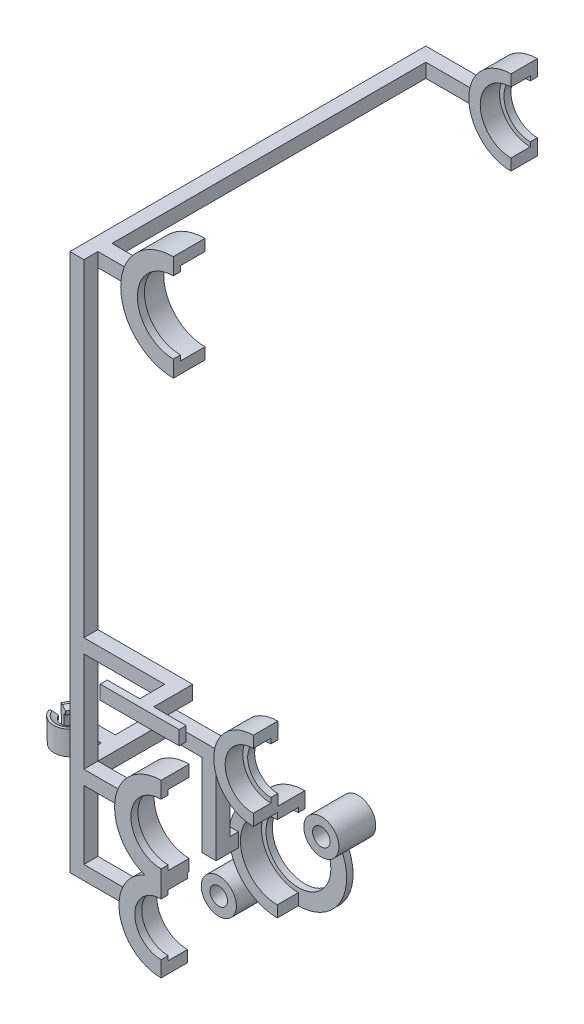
ISO-10303-21;
HEADER;
FILE_DESCRIPTION(('STEP AP214'),'2;1');
FILE_NAME('part.step','',(''),(''),'','','');
FILE_SCHEMA(('AUTOMOTIVE_DESIGN { 1 0 10303 214 1 1 1 1 }'));
ENDSEC;
DATA;
#1=APPLICATION_CONTEXT('core data for automotive mechanical design processes');
#2=APPLICATION_PROTOCOL_DEFINITION('international standard','automotive_design',2000,#1);
#3=PRODUCT_CONTEXT('',#1,'mechanical');
#4=PRODUCT('Part','Part','',(#3));
#5=PRODUCT_RELATED_PRODUCT_CATEGORY('part','',(#4));
#6=PRODUCT_DEFINITION_FORMATION('','',#4);
#7=PRODUCT_DEFINITION_CONTEXT('part definition',#1,'design');
#8=PRODUCT_DEFINITION('design','',#6,#7);
#9=PRODUCT_DEFINITION_SHAPE('','',#8);
#10=(LENGTH_UNIT() NAMED_UNIT(*) SI_UNIT(.MILLI.,.METRE.));
#11=(NAMED_UNIT(*) PLANE_ANGLE_UNIT() SI_UNIT($,.RADIAN.));
#12=(NAMED_UNIT(*) SI_UNIT($,.STERADIAN.) SOLID_ANGLE_UNIT());
#13=UNCERTAINTY_MEASURE_WITH_UNIT(LENGTH_MEASURE(1.E-05),#10,'distance_accuracy_value','');
#14=(GEOMETRIC_REPRESENTATION_CONTEXT(3) GLOBAL_UNCERTAINTY_ASSIGNED_CONTEXT((#13)) GLOBAL_UNIT_ASSIGNED_CONTEXT((#10,
#11,#12)) REPRESENTATION_CONTEXT('',''));
#15=CARTESIAN_POINT('',(0.,0.,0.));
#16=DIRECTION('',(0.,0.,1.));
#17=DIRECTION('',(1.,0.,0.));
#18=AXIS2_PLACEMENT_3D('',#15,#16,#17);
#19=CARTESIAN_POINT('',(-50.,4.,4.00000000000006));
#20=DIRECTION('',(-1.,0.,0.));
#21=DIRECTION('',(0.,0.,1.));
#22=AXIS2_PLACEMENT_3D('',#19,#20,#21);
#23=PLANE('',#22);
#24=DIRECTION('',(0.,0.,1.));
#25=VECTOR('',#24,1.);
#26=CARTESIAN_POINT('',(-50.,-182.5,12.));
#27=LINE('',#26,#25);
#28=CARTESIAN_POINT('',(-50.,-182.5,4.));
#29=VERTEX_POINT('',#28);
#30=CARTESIAN_POINT('',(-50.,-182.5,12.));
#31=VERTEX_POINT('',#30);
#32=EDGE_CURVE('E668',#29,#31,#27,.T.);
#33=ORIENTED_EDGE('',*,*,#32,.F.);
#34=DIRECTION('',(0.,1.,0.));
#35=VECTOR('',#34,1.);
#36=CARTESIAN_POINT('',(-50.,-255.37,4.));
#37=LINE('',#36,#35);
#38=CARTESIAN_POINT('',(-50.,-4.,4.));
#39=VERTEX_POINT('',#38);
#40=EDGE_CURVE('E1117',#29,#39,#37,.T.);
#41=ORIENTED_EDGE('',*,*,#40,.T.);
#42=DIRECTION('',(0.,-1.,0.));
#43=VECTOR('',#42,1.);
#44=CARTESIAN_POINT('',(-50.,4.,4.00000000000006));
#45=LINE('',#44,#43);
#46=CARTESIAN_POINT('',(-50.,4.,4.00000000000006));
#47=VERTEX_POINT('',#46);
#48=EDGE_CURVE('E1020',#47,#39,#45,.T.);
#49=ORIENTED_EDGE('',*,*,#48,.F.);
#50=DIRECTION('',(0.,0.,-1.));
#51=VECTOR('',#50,1.);
#52=CARTESIAN_POINT('',(-50.,4.,4.00000000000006));
#53=LINE('',#52,#51);
#54=CARTESIAN_POINT('',(-50.,4.,12.));
#55=VERTEX_POINT('',#54);
#56=EDGE_CURVE('E1026',#55,#47,#53,.T.);
#57=ORIENTED_EDGE('',*,*,#56,.F.);
#58=DIRECTION('',(0.,-1.,0.));
#59=VECTOR('',#58,1.);
#60=CARTESIAN_POINT('',(-50.,4.,12.));
#61=LINE('',#60,#59);
#62=EDGE_CURVE('E1016',#55,#31,#61,.T.);
#63=ORIENTED_EDGE('',*,*,#62,.T.);
#64=EDGE_LOOP('',(#33,#41,#49,#57,#63));
#65=FACE_BOUND('',#64,.T.);
#66=ADVANCED_FACE('F26',(#65),#23,.F.);
#67=DIRECTION('',(0.,0.,-1.));
#68=VECTOR('',#67,1.);
#69=CARTESIAN_POINT('',(-50.,-190.5,12.));
#70=LINE('',#69,#68);
#71=CARTESIAN_POINT('',(-50.,-190.5,12.));
#72=VERTEX_POINT('',#71);
#73=CARTESIAN_POINT('',(-50.,-190.5,4.));
#74=VERTEX_POINT('',#73);
#75=EDGE_CURVE('E671',#72,#74,#70,.T.);
#76=ORIENTED_EDGE('',*,*,#75,.F.);
#77=CARTESIAN_POINT('',(-50.,-247.37,12.));
#78=VERTEX_POINT('',#77);
#79=EDGE_CURVE('E1019',#72,#78,#61,.T.);
#80=ORIENTED_EDGE('',*,*,#79,.T.);
#81=DIRECTION('',(0.,0.,-1.));
#82=VECTOR('',#81,1.);
#83=CARTESIAN_POINT('',(-50.,-247.37,4.00000000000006));
#84=LINE('',#83,#82);
#85=CARTESIAN_POINT('',(-50.,-247.37,4.));
#86=VERTEX_POINT('',#85);
#87=EDGE_CURVE('E796',#78,#86,#84,.T.);
#88=ORIENTED_EDGE('',*,*,#87,.T.);
#89=EDGE_CURVE('E1115',#86,#74,#37,.T.);
#90=ORIENTED_EDGE('',*,*,#89,.T.);
#91=EDGE_LOOP('',(#76,#80,#88,#90));
#92=FACE_BOUND('',#91,.T.);
#93=ADVANCED_FACE('F930',(#92),#23,.F.);
#94=CARTESIAN_POINT('',(-58.,4.,-190.8));
#95=DIRECTION('',(1.,0.,0.));
#96=DIRECTION('',(0.,0.,-1.));
#97=AXIS2_PLACEMENT_3D('',#94,#95,#96);
#98=PLANE('',#97);
#99=DIRECTION('',(0.,1.,0.));
#100=VECTOR('',#99,1.);
#101=CARTESIAN_POINT('',(-58.,-247.37,-5.86999999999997));
#102=LINE('',#101,#100);
#103=CARTESIAN_POINT('',(-58.,-255.37,-5.86999999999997));
#104=VERTEX_POINT('',#103);
#105=CARTESIAN_POINT('',(-58.,-247.37,-5.86999999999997));
#106=VERTEX_POINT('',#105);
#107=EDGE_CURVE('E751',#104,#106,#102,.T.);
#108=ORIENTED_EDGE('',*,*,#107,.F.);
#109=DIRECTION('',(0.,0.,1.));
#110=VECTOR('',#109,1.);
#111=CARTESIAN_POINT('',(-58.,-255.37,3.99999999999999));
#112=LINE('',#111,#110);
#113=CARTESIAN_POINT('',(-58.,-255.37,4.00000000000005));
#114=VERTEX_POINT('',#113);
#115=EDGE_CURVE('E804',#104,#114,#112,.T.);
#116=ORIENTED_EDGE('',*,*,#115,.T.);
#117=DIRECTION('',(0.,1.,0.));
#118=VECTOR('',#117,1.);
#119=CARTESIAN_POINT('',(-58.,-302.37,4.00000000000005));
#120=LINE('',#119,#118);
#121=CARTESIAN_POINT('',(-58.,-302.37,4.00000000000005));
#122=VERTEX_POINT('',#121);
#123=EDGE_CURVE('E1174',#122,#114,#120,.T.);
#124=ORIENTED_EDGE('',*,*,#123,.F.);
#125=DIRECTION('',(0.,0.,1.));
#126=VECTOR('',#125,1.);
#127=CARTESIAN_POINT('',(-58.,-302.37,4.00000000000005));
#128=LINE('',#127,#126);
#129=CARTESIAN_POINT('',(-58.,-302.37,12.));
#130=VERTEX_POINT('',#129);
#131=EDGE_CURVE('E2017',#122,#130,#128,.T.);
#132=ORIENTED_EDGE('',*,*,#131,.T.);
#133=DIRECTION('',(0.,-1.,0.));
#134=VECTOR('',#133,1.);
#135=CARTESIAN_POINT('',(-58.,4.,12.));
#136=LINE('',#135,#134);
#137=CARTESIAN_POINT('',(-58.,4.,12.));
#138=VERTEX_POINT('',#137);
#139=EDGE_CURVE('E1014',#138,#130,#136,.T.);
#140=ORIENTED_EDGE('',*,*,#139,.F.);
#141=DIRECTION('',(0.,0.,1.));
#142=VECTOR('',#141,1.);
#143=CARTESIAN_POINT('',(-58.,4.,-190.8));
#144=LINE('',#143,#142);
#145=CARTESIAN_POINT('',(-58.,4.,-190.8));
#146=VERTEX_POINT('',#145);
#147=EDGE_CURVE('E1030',#146,#138,#144,.T.);
#148=ORIENTED_EDGE('',*,*,#147,.F.);
#149=DIRECTION('',(0.,-1.,0.));
#150=VECTOR('',#149,1.);
#151=CARTESIAN_POINT('',(-58.,4.,-190.8));
#152=LINE('',#151,#150);
#153=CARTESIAN_POINT('',(-58.,-4.,-190.8));
#154=VERTEX_POINT('',#153);
#155=EDGE_CURVE('E1008',#146,#154,#152,.T.);
#156=ORIENTED_EDGE('',*,*,#155,.T.);
#157=DIRECTION('',(0.,0.,1.));
#158=VECTOR('',#157,1.);
#159=CARTESIAN_POINT('',(-58.,-4.,-190.8));
#160=LINE('',#159,#158);
#161=CARTESIAN_POINT('',(-58.,-4.,3.99999999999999));
#162=VERTEX_POINT('',#161);
#163=EDGE_CURVE('E1044',#154,#162,#160,.T.);
#164=ORIENTED_EDGE('',*,*,#163,.T.);
#165=DIRECTION('',(0.,1.,0.));
#166=VECTOR('',#165,1.);
#167=CARTESIAN_POINT('',(-58.,-255.37,3.99999999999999));
#168=LINE('',#167,#166);
#169=CARTESIAN_POINT('',(-58.,-247.37,3.99999999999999));
#170=VERTEX_POINT('',#169);
#171=EDGE_CURVE('E1116',#170,#162,#168,.T.);
#172=ORIENTED_EDGE('',*,*,#171,.F.);
#173=DIRECTION('',(0.,0.,1.));
#174=VECTOR('',#173,1.);
#175=CARTESIAN_POINT('',(-58.,-247.37,-43.5));
#176=LINE('',#175,#174);
#177=EDGE_CURVE('E773',#106,#170,#176,.T.);
#178=ORIENTED_EDGE('',*,*,#177,.F.);
#179=EDGE_LOOP('',(#108,#116,#124,#132,#140,#148,#156,#164,#172,#178));
#180=FACE_BOUND('',#179,.T.);
#181=ADVANCED_FACE('F936',(#180),#98,.F.);
#182=DIRECTION('',(0.,-1.,0.));
#183=VECTOR('',#182,1.);
#184=CARTESIAN_POINT('',(-58.,-247.37,-13.87));
#185=LINE('',#184,#183);
#186=CARTESIAN_POINT('',(-58.,-247.37,-13.87));
#187=VERTEX_POINT('',#186);
#188=CARTESIAN_POINT('',(-58.,-255.37,-13.87));
#189=VERTEX_POINT('',#188);
#190=EDGE_CURVE('E759',#187,#189,#185,.T.);
#191=ORIENTED_EDGE('',*,*,#190,.F.);
#192=CARTESIAN_POINT('',(-58.,-247.37,-43.5));
#193=VERTEX_POINT('',#192);
#194=EDGE_CURVE('E776',#193,#187,#176,.T.);
#195=ORIENTED_EDGE('',*,*,#194,.F.);
#196=DIRECTION('',(0.,-1.,0.));
#197=VECTOR('',#196,1.);
#198=CARTESIAN_POINT('',(-58.,-255.37,-43.5));
#199=LINE('',#198,#197);
#200=CARTESIAN_POINT('',(-58.,-255.37,-43.5));
#201=VERTEX_POINT('',#200);
#202=EDGE_CURVE('E1320',#193,#201,#199,.T.);
#203=ORIENTED_EDGE('',*,*,#202,.T.);
#204=EDGE_CURVE('E811',#201,#189,#112,.T.);
#205=ORIENTED_EDGE('',*,*,#204,.T.);
#206=EDGE_LOOP('',(#191,#195,#203,#205));
#207=FACE_BOUND('',#206,.T.);
#208=ADVANCED_FACE('F951',(#207),#98,.F.);
#209=CARTESIAN_POINT('',(2.21693377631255E-13,-319.37,-60.2));
#210=DIRECTION('',(0.,0.,1.));
#211=DIRECTION('',(1.,0.,0.));
#212=AXIS2_PLACEMENT_3D('',#209,#210,#211);
#213=PLANE('',#212);
#214=DIRECTION('',(-0.70710678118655,-0.707106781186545,0.));
#215=VECTOR('',#214,1.);
#216=CARTESIAN_POINT('',(15.6004668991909,-288.426387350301,-60.2));
#217=LINE('',#216,#215);
#218=CARTESIAN_POINT('',(26.7532780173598,-277.273576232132,-60.2));
#219=VERTEX_POINT('',#218);
#220=CARTESIAN_POINT('',(22.067060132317,-281.959794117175,-60.2));
#221=VERTEX_POINT('',#220);
#222=EDGE_CURVE('E2172',#219,#221,#217,.T.);
#223=ORIENTED_EDGE('',*,*,#222,.F.);
#224=CARTESIAN_POINT('',(30.4055915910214,-267.964408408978,-60.2));
#225=DIRECTION('',(0.,0.,1.));
#226=DIRECTION('',(1.,0.,0.));
#227=AXIS2_PLACEMENT_3D('',#224,#225,#226);
#228=CIRCLE('',#227,10.);
#229=CARTESIAN_POINT('',(21.0964237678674,-271.61672198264,-60.2));
#230=VERTEX_POINT('',#229);
#231=EDGE_CURVE('E2197',#230,#219,#228,.T.);
#232=ORIENTED_EDGE('',*,*,#231,.F.);
#233=DIRECTION('',(0.707106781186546,0.707106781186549,0.));
#234=VECTOR('',#233,1.);
#235=CARTESIAN_POINT('',(9.94361264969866,-282.769533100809,-60.2));
#236=LINE('',#235,#234);
#237=CARTESIAN_POINT('',(9.94361264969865,-282.769533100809,-60.2));
#238=VERTEX_POINT('',#237);
#239=EDGE_CURVE('E2167',#238,#230,#236,.T.);
#240=ORIENTED_EDGE('',*,*,#239,.F.);
#241=CARTESIAN_POINT('',(0.,-298.37,-60.2));
#242=DIRECTION('',(0.,0.,-1.));
#243=DIRECTION('',(-1.,0.,0.));
#244=AXIS2_PLACEMENT_3D('',#241,#242,#243);
#245=CIRCLE('',#244,18.5);
#246=CARTESIAN_POINT('',(0.,-279.87,-60.2));
#247=VERTEX_POINT('',#246);
#248=EDGE_CURVE('E2072',#238,#247,#245,.T.);
#249=ORIENTED_EDGE('',*,*,#248,.T.);
#250=DIRECTION('',(0.,-1.,0.));
#251=VECTOR('',#250,1.);
#252=CARTESIAN_POINT('',(0.,-277.37,-60.2));
#253=LINE('',#252,#251);
#254=CARTESIAN_POINT('',(0.,-277.37,-60.2));
#255=VERTEX_POINT('',#254);
#256=EDGE_CURVE('E2133',#255,#247,#253,.T.);
#257=ORIENTED_EDGE('',*,*,#256,.F.);
#258=CARTESIAN_POINT('',(0.,-298.37,-60.2));
#259=DIRECTION('',(0.,0.,-1.));
#260=DIRECTION('',(-1.,0.,0.));
#261=AXIS2_PLACEMENT_3D('',#258,#259,#260);
#262=CIRCLE('',#261,21.);
#263=CARTESIAN_POINT('',(-2.48689957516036E-13,-319.37,-60.2));
#264=VERTEX_POINT('',#263);
#265=EDGE_CURVE('E2074',#264,#255,#262,.T.);
#266=ORIENTED_EDGE('',*,*,#265,.F.);
#267=DIRECTION('',(0.,1.,0.));
#268=VECTOR('',#267,1.);
#269=CARTESIAN_POINT('',(2.21693377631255E-13,-319.37,-60.2));
#270=LINE('',#269,#268);
#271=CARTESIAN_POINT('',(-3.05311331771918E-13,-325.87,-60.2));
#272=VERTEX_POINT('',#271);
#273=EDGE_CURVE('E825',#272,#264,#270,.T.);
#274=ORIENTED_EDGE('',*,*,#273,.F.);
#275=CARTESIAN_POINT('',(0.,-298.37,-60.2));
#276=DIRECTION('',(0.,0.,1.));
#277=DIRECTION('',(1.,0.,0.));
#278=AXIS2_PLACEMENT_3D('',#275,#276,#277);
#279=CIRCLE('',#278,27.4999999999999);
#280=EDGE_CURVE('E2117',#272,#221,#279,.T.);
#281=ORIENTED_EDGE('',*,*,#280,.T.);
#282=EDGE_LOOP('',(#223,#232,#240,#249,#257,#266,#274,#281));
#283=FACE_BOUND('',#282,.T.);
#284=ADVANCED_FACE('F1840',(#283),#213,.T.);
#285=CARTESIAN_POINT('',(2.21693377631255E-13,-319.37,-60.2));
#286=DIRECTION('',(0.,0.,1.));
#287=DIRECTION('',(1.,0.,0.));
#288=AXIS2_PLACEMENT_3D('',#285,#286,#287);
#289=PLANE('',#288);
#290=DIRECTION('',(0.707106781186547,0.707106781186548,0.));
#291=VECTOR('',#290,1.);
#292=CARTESIAN_POINT('',(-15.6004668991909,-308.313612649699,-60.2));
#293=LINE('',#292,#291);
#294=CARTESIAN_POINT('',(-26.7532780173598,-319.466423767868,-60.2));
#295=VERTEX_POINT('',#294);
#296=CARTESIAN_POINT('',(-22.0670601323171,-314.780205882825,-60.2));
#297=VERTEX_POINT('',#296);
#298=EDGE_CURVE('E2150',#295,#297,#293,.T.);
#299=ORIENTED_EDGE('',*,*,#298,.F.);
#300=CARTESIAN_POINT('',(-30.4055915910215,-328.775591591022,-60.2));
#301=DIRECTION('',(0.,0.,1.));
#302=DIRECTION('',(1.,0.,0.));
#303=AXIS2_PLACEMENT_3D('',#300,#301,#302);
#304=CIRCLE('',#303,10.);
#305=CARTESIAN_POINT('',(-21.0964237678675,-325.12327801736,-60.2));
#306=VERTEX_POINT('',#305);
#307=EDGE_CURVE('E2192',#306,#295,#304,.T.);
#308=ORIENTED_EDGE('',*,*,#307,.F.);
#309=DIRECTION('',(-0.707106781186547,-0.707106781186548,0.));
#310=VECTOR('',#309,1.);
#311=CARTESIAN_POINT('',(-9.94361264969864,-313.970466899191,-60.2));
#312=LINE('',#311,#310);
#313=CARTESIAN_POINT('',(-16.4102058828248,-320.437060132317,-60.2));
#314=VERTEX_POINT('',#313);
#315=EDGE_CURVE('E2147',#314,#306,#312,.T.);
#316=ORIENTED_EDGE('',*,*,#315,.F.);
#317=CARTESIAN_POINT('',(0.,-298.37,-60.2));
#318=DIRECTION('',(0.,0.,1.));
#319=DIRECTION('',(1.,0.,0.));
#320=AXIS2_PLACEMENT_3D('',#317,#318,#319);
#321=CIRCLE('',#320,27.5);
#322=EDGE_CURVE('E822',#314,#297,#321,.F.);
#323=ORIENTED_EDGE('',*,*,#322,.T.);
#324=EDGE_LOOP('',(#299,#308,#316,#323));
#325=FACE_BOUND('',#324,.T.);
#326=ADVANCED_FACE('F1432',(#325),#289,.T.);
#327=CARTESIAN_POINT('',(-58.,-255.37,-43.5));
#328=DIRECTION('',(0.,0.,-1.));
#329=DIRECTION('',(-1.,0.,0.));
#330=AXIS2_PLACEMENT_3D('',#327,#328,#329);
#331=PLANE('',#330);
#332=DIRECTION('',(0.,1.,0.));
#333=VECTOR('',#332,1.);
#334=CARTESIAN_POINT('',(-22.1415898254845,-302.37,-43.5));
#335=LINE('',#334,#333);
#336=CARTESIAN_POINT('',(-22.1415898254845,-294.37,-43.5));
#337=VERTEX_POINT('',#336);
#338=CARTESIAN_POINT('',(-22.1415898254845,-255.37,-43.5));
#339=VERTEX_POINT('',#338);
#340=EDGE_CURVE('E1200',#337,#339,#335,.T.);
#341=ORIENTED_EDGE('',*,*,#340,.F.);
#342=DIRECTION('',(-1.,0.,0.));
#343=VECTOR('',#342,1.);
#344=CARTESIAN_POINT('',(-58.0000000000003,-294.37,-43.5));
#345=LINE('',#344,#343);
#346=CARTESIAN_POINT('',(-30.1415898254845,-294.37,-43.5));
#347=VERTEX_POINT('',#346);
#348=EDGE_CURVE('E1342',#337,#347,#345,.T.);
#349=ORIENTED_EDGE('',*,*,#348,.T.);
#350=DIRECTION('',(0.,1.,0.));
#351=VECTOR('',#350,1.);
#352=CARTESIAN_POINT('',(-30.1415898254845,-302.37,-43.5));
#353=LINE('',#352,#351);
#354=CARTESIAN_POINT('',(-30.1415898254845,-255.37,-43.5));
#355=VERTEX_POINT('',#354);
#356=EDGE_CURVE('E1199',#347,#355,#353,.T.);
#357=ORIENTED_EDGE('',*,*,#356,.T.);
#358=DIRECTION('',(1.,0.,0.));
#359=VECTOR('',#358,1.);
#360=CARTESIAN_POINT('',(-58.,-255.37,-43.5));
#361=LINE('',#360,#359);
#362=EDGE_CURVE('E1323',#201,#355,#361,.T.);
#363=ORIENTED_EDGE('',*,*,#362,.F.);
#364=ORIENTED_EDGE('',*,*,#202,.F.);
#365=DIRECTION('',(-1.,0.,0.));
#366=VECTOR('',#365,1.);
#367=CARTESIAN_POINT('',(-50.,-247.37,-43.5));
#368=LINE('',#367,#366);
#369=CARTESIAN_POINT('',(-22.1415898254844,-247.37,-43.5));
#370=VERTEX_POINT('',#369);
#371=EDGE_CURVE('E782',#370,#193,#368,.T.);
#372=ORIENTED_EDGE('',*,*,#371,.F.);
#373=CARTESIAN_POINT('',(0.,-251.37,-43.5));
#374=DIRECTION('',(0.,0.,-1.));
#375=DIRECTION('',(-1.,0.,0.));
#376=AXIS2_PLACEMENT_3D('',#373,#374,#375);
#377=CIRCLE('',#376,22.5);
#378=EDGE_CURVE('E1315',#339,#370,#377,.T.);
#379=ORIENTED_EDGE('',*,*,#378,.F.);
#380=EDGE_LOOP('',(#341,#349,#357,#363,#364,#372,#379));
#381=FACE_BOUND('',#380,.T.);
#382=ADVANCED_FACE('F1338',(#381),#331,.T.);
#383=CARTESIAN_POINT('',(-50.,-255.37,4.));
#384=DIRECTION('',(0.,1.,0.));
#385=DIRECTION('',(0.,0.,1.));
#386=AXIS2_PLACEMENT_3D('',#383,#384,#385);
#387=PLANE('',#386);
#388=DIRECTION('',(1.,0.,0.));
#389=VECTOR('',#388,1.);
#390=CARTESIAN_POINT('',(-70.,-255.37,-5.86999999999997));
#391=LINE('',#390,#389);
#392=CARTESIAN_POINT('',(-69.5100752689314,-255.37,-5.86999999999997));
#393=VERTEX_POINT('',#392);
#394=EDGE_CURVE('E30',#393,#104,#391,.T.);
#395=ORIENTED_EDGE('',*,*,#394,.F.);
#396=CARTESIAN_POINT('',(-78.6783684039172,-255.37,-9.86999999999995));
#397=DIRECTION('',(0.,1.,0.));
#398=DIRECTION('',(-1.,0.,0.));
#399=AXIS2_PLACEMENT_3D('',#396,#397,#398);
#400=ELLIPSE('',#399,10.0034279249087,10.);
#401=CARTESIAN_POINT('',(-69.5100752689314,-255.37,-13.87));
#402=VERTEX_POINT('',#401);
#403=EDGE_CURVE('E745',#393,#402,#400,.T.);
#404=ORIENTED_EDGE('',*,*,#403,.T.);
#405=DIRECTION('',(1.,0.,0.));
#406=VECTOR('',#405,1.);
#407=CARTESIAN_POINT('',(-70.,-255.37,-13.87));
#408=LINE('',#407,#406);
#409=EDGE_CURVE('E764',#402,#189,#408,.T.);
#410=ORIENTED_EDGE('',*,*,#409,.T.);
#411=ORIENTED_EDGE('',*,*,#204,.F.);
#412=ORIENTED_EDGE('',*,*,#362,.T.);
#413=DIRECTION('',(0.,0.,1.));
#414=VECTOR('',#413,1.);
#415=CARTESIAN_POINT('',(-30.1415898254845,-255.37,4.));
#416=LINE('',#415,#414);
#417=CARTESIAN_POINT('',(-30.1415898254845,-255.37,-35.5));
#418=VERTEX_POINT('',#417);
#419=EDGE_CURVE('E1202',#355,#418,#416,.T.);
#420=ORIENTED_EDGE('',*,*,#419,.T.);
#421=DIRECTION('',(-1.,0.,0.));
#422=VECTOR('',#421,1.);
#423=CARTESIAN_POINT('',(-18.,-255.37,-35.5));
#424=LINE('',#423,#422);
#425=CARTESIAN_POINT('',(-50.,-255.37,-35.5));
#426=VERTEX_POINT('',#425);
#427=EDGE_CURVE('E1317',#418,#426,#424,.T.);
#428=ORIENTED_EDGE('',*,*,#427,.T.);
#429=DIRECTION('',(0.,0.,1.));
#430=VECTOR('',#429,1.);
#431=CARTESIAN_POINT('',(-50.,-255.37,-43.5));
#432=LINE('',#431,#430);
#433=CARTESIAN_POINT('',(-50.,-255.37,4.));
#434=VERTEX_POINT('',#433);
#435=EDGE_CURVE('E787',#426,#434,#432,.T.);
#436=ORIENTED_EDGE('',*,*,#435,.T.);
#437=DIRECTION('',(-1.,0.,0.));
#438=VECTOR('',#437,1.);
#439=CARTESIAN_POINT('',(-50.,-255.37,4.));
#440=LINE('',#439,#438);
#441=EDGE_CURVE('E1170',#434,#114,#440,.T.);
#442=ORIENTED_EDGE('',*,*,#441,.T.);
#443=ORIENTED_EDGE('',*,*,#115,.F.);
#444=EDGE_LOOP('',(#395,#404,#410,#411,#412,#420,#428,#436,#442,#443));
#445=FACE_BOUND('',#444,.T.);
#446=ADVANCED_FACE('F1166',(#445),#387,.F.);
#447=CARTESIAN_POINT('',(-58.,-255.37,3.99999999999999));
#448=DIRECTION('',(0.,0.,-1.));
#449=DIRECTION('',(-1.,0.,0.));
#450=AXIS2_PLACEMENT_3D('',#447,#448,#449);
#451=PLANE('',#450);
#452=ORIENTED_EDGE('',*,*,#40,.F.);
#453=DIRECTION('',(-1.,0.,0.));
#454=VECTOR('',#453,1.);
#455=CARTESIAN_POINT('',(3.99999999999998,-182.5,3.99999999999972));
#456=LINE('',#455,#454);
#457=CARTESIAN_POINT('',(3.99999999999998,-182.5,3.99999999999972));
#458=VERTEX_POINT('',#457);
#459=EDGE_CURVE('E680',#458,#29,#456,.T.);
#460=ORIENTED_EDGE('',*,*,#459,.F.);
#461=DIRECTION('',(0.,1.,0.));
#462=VECTOR('',#461,1.);
#463=CARTESIAN_POINT('',(3.99999999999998,-182.5,3.99999999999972));
#464=LINE('',#463,#462);
#465=CARTESIAN_POINT('',(3.99999999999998,-190.5,3.99999999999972));
#466=VERTEX_POINT('',#465);
#467=EDGE_CURVE('E678',#466,#458,#464,.T.);
#468=ORIENTED_EDGE('',*,*,#467,.F.);
#469=DIRECTION('',(-1.,0.,0.));
#470=VECTOR('',#469,1.);
#471=CARTESIAN_POINT('',(3.99999999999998,-190.5,3.99999999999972));
#472=LINE('',#471,#470);
#473=EDGE_CURVE('E52',#466,#74,#472,.T.);
#474=ORIENTED_EDGE('',*,*,#473,.T.);
#475=ORIENTED_EDGE('',*,*,#89,.F.);
#476=DIRECTION('',(1.,0.,0.));
#477=VECTOR('',#476,1.);
#478=CARTESIAN_POINT('',(-58.0000000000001,-247.37,3.99999999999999));
#479=LINE('',#478,#477);
#480=EDGE_CURVE('E847',#170,#86,#479,.T.);
#481=ORIENTED_EDGE('',*,*,#480,.F.);
#482=ORIENTED_EDGE('',*,*,#171,.T.);
#483=DIRECTION('',(1.,0.,0.));
#484=VECTOR('',#483,1.);
#485=CARTESIAN_POINT('',(-26.0000000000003,-4.,4.00000000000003));
#486=LINE('',#485,#484);
#487=EDGE_CURVE('E1112',#162,#39,#486,.T.);
#488=ORIENTED_EDGE('',*,*,#487,.T.);
#489=EDGE_LOOP('',(#452,#460,#468,#474,#475,#481,#482,#488));
#490=FACE_BOUND('',#489,.T.);
#491=ADVANCED_FACE('F1128',(#490),#451,.T.);
#492=CARTESIAN_POINT('',(0.,0.,7.));
#493=DIRECTION('',(0.,0.,-1.));
#494=DIRECTION('',(-1.,0.,0.));
#495=AXIS2_PLACEMENT_3D('',#492,#493,#494);
#496=CYLINDRICAL_SURFACE('',#495,30.);
#497=CARTESIAN_POINT('',(0.,0.,-7.));
#498=DIRECTION('',(0.,0.,1.));
#499=DIRECTION('',(1.,0.,0.));
#500=AXIS2_PLACEMENT_3D('',#497,#498,#499);
#501=CIRCLE('',#500,30.);
#502=CARTESIAN_POINT('',(0.,30.,-7.));
#503=VERTEX_POINT('',#502);
#504=CARTESIAN_POINT('',(0.,-30.,-7.));
#505=VERTEX_POINT('',#504);
#506=EDGE_CURVE('E902',#503,#505,#501,.T.);
#507=ORIENTED_EDGE('',*,*,#506,.T.);
#508=DIRECTION('',(0.,0.,-1.));
#509=VECTOR('',#508,1.);
#510=CARTESIAN_POINT('',(0.,-30.,7.));
#511=LINE('',#510,#509);
#512=CARTESIAN_POINT('',(0.,-30.,11.));
#513=VERTEX_POINT('',#512);
#514=EDGE_CURVE('E869',#513,#505,#511,.T.);
#515=ORIENTED_EDGE('',*,*,#514,.F.);
#516=CARTESIAN_POINT('',(0.,0.,11.));
#517=DIRECTION('',(0.,0.,1.));
#518=DIRECTION('',(1.,0.,0.));
#519=AXIS2_PLACEMENT_3D('',#516,#517,#518);
#520=CIRCLE('',#519,30.);
#521=CARTESIAN_POINT('',(0.,30.,11.));
#522=VERTEX_POINT('',#521);
#523=EDGE_CURVE('E987',#522,#513,#520,.T.);
#524=ORIENTED_EDGE('',*,*,#523,.F.);
#525=DIRECTION('',(0.,0.,-1.));
#526=VECTOR('',#525,1.);
#527=CARTESIAN_POINT('',(0.,30.,7.));
#528=LINE('',#527,#526);
#529=EDGE_CURVE('E883',#522,#503,#528,.T.);
#530=ORIENTED_EDGE('',*,*,#529,.T.);
#531=EDGE_LOOP('',(#507,#515,#524,#530));
#532=FACE_BOUND('',#531,.T.);
#533=DIRECTION('',(0.,0.,-1.));
#534=VECTOR('',#533,1.);
#535=CARTESIAN_POINT('',(-29.732137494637,4.,7.));
#536=LINE('',#535,#534);
#537=CARTESIAN_POINT('',(-29.732137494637,4.,4.00000000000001));
#538=VERTEX_POINT('',#537);
#539=CARTESIAN_POINT('',(-29.732137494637,4.,-4.));
#540=VERTEX_POINT('',#539);
#541=EDGE_CURVE('E853',#538,#540,#536,.T.);
#542=ORIENTED_EDGE('',*,*,#541,.F.);
#543=CARTESIAN_POINT('',(0.,0.,3.99999999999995));
#544=DIRECTION('',(0.,0.,-1.));
#545=DIRECTION('',(-1.,0.,0.));
#546=AXIS2_PLACEMENT_3D('',#543,#544,#545);
#547=CIRCLE('',#546,30.);
#548=CARTESIAN_POINT('',(-29.732137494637,-4.,4.00000000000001));
#549=VERTEX_POINT('',#548);
#550=EDGE_CURVE('E858',#549,#538,#547,.T.);
#551=ORIENTED_EDGE('',*,*,#550,.F.);
#552=DIRECTION('',(0.,0.,-1.));
#553=VECTOR('',#552,1.);
#554=CARTESIAN_POINT('',(-29.732137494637,-4.,7.));
#555=LINE('',#554,#553);
#556=CARTESIAN_POINT('',(-29.732137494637,-4.,-4.));
#557=VERTEX_POINT('',#556);
#558=EDGE_CURVE('E860',#549,#557,#555,.T.);
#559=ORIENTED_EDGE('',*,*,#558,.T.);
#560=CARTESIAN_POINT('',(0.,0.,-3.99999999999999));
#561=DIRECTION('',(0.,0.,1.));
#562=DIRECTION('',(1.,0.,0.));
#563=AXIS2_PLACEMENT_3D('',#560,#561,#562);
#564=CIRCLE('',#563,30.);
#565=EDGE_CURVE('E855',#540,#557,#564,.T.);
#566=ORIENTED_EDGE('',*,*,#565,.F.);
#567=EDGE_LOOP('',(#542,#551,#559,#566));
#568=FACE_BOUND('',#567,.T.);
#569=ADVANCED_FACE('F998',(#532,#568),#496,.T.);
#570=CARTESIAN_POINT('',(0.,0.,7.));
#571=DIRECTION('',(0.,0.,-1.));
#572=DIRECTION('',(-1.,0.,0.));
#573=AXIS2_PLACEMENT_3D('',#570,#571,#572);
#574=CYLINDRICAL_SURFACE('',#573,23.5);
#575=CARTESIAN_POINT('',(0.,0.,-7.));
#576=DIRECTION('',(0.,0.,-1.));
#577=DIRECTION('',(1.,0.,0.));
#578=AXIS2_PLACEMENT_3D('',#575,#576,#577);
#579=CIRCLE('',#578,23.5);
#580=CARTESIAN_POINT('',(0.,-23.5,-7.));
#581=VERTEX_POINT('',#580);
#582=CARTESIAN_POINT('',(0.,23.5,-7.));
#583=VERTEX_POINT('',#582);
#584=EDGE_CURVE('E897',#581,#583,#579,.T.);
#585=ORIENTED_EDGE('',*,*,#584,.T.);
#586=DIRECTION('',(0.,0.,-1.));
#587=VECTOR('',#586,1.);
#588=CARTESIAN_POINT('',(0.,23.5,7.));
#589=LINE('',#588,#587);
#590=CARTESIAN_POINT('',(0.,23.5,7.));
#591=VERTEX_POINT('',#590);
#592=EDGE_CURVE('E863',#591,#583,#589,.T.);
#593=ORIENTED_EDGE('',*,*,#592,.F.);
#594=CARTESIAN_POINT('',(0.,0.,7.));
#595=DIRECTION('',(0.,0.,-1.));
#596=DIRECTION('',(1.,0.,0.));
#597=AXIS2_PLACEMENT_3D('',#594,#595,#596);
#598=CIRCLE('',#597,23.5);
#599=CARTESIAN_POINT('',(0.,-23.5,7.));
#600=VERTEX_POINT('',#599);
#601=EDGE_CURVE('E870',#600,#591,#598,.T.);
#602=ORIENTED_EDGE('',*,*,#601,.F.);
#603=DIRECTION('',(0.,0.,-1.));
#604=VECTOR('',#603,1.);
#605=CARTESIAN_POINT('',(0.,-23.5,7.));
#606=LINE('',#605,#604);
#607=EDGE_CURVE('E866',#600,#581,#606,.T.);
#608=ORIENTED_EDGE('',*,*,#607,.T.);
#609=EDGE_LOOP('',(#585,#593,#602,#608));
#610=FACE_BOUND('',#609,.T.);
#611=ADVANCED_FACE('F28',(#610),#574,.F.);
#612=CARTESIAN_POINT('',(0.,30.,7.));
#613=DIRECTION('',(-1.,0.,0.));
#614=DIRECTION('',(0.,-1.,0.));
#615=AXIS2_PLACEMENT_3D('',#612,#613,#614);
#616=PLANE('',#615);
#617=DIRECTION('',(0.,1.,0.));
#618=VECTOR('',#617,1.);
#619=CARTESIAN_POINT('',(0.,30.,-7.));
#620=LINE('',#619,#618);
#621=EDGE_CURVE('E890',#583,#503,#620,.T.);
#622=ORIENTED_EDGE('',*,*,#621,.T.);
#623=ORIENTED_EDGE('',*,*,#529,.F.);
#624=DIRECTION('',(0.,1.,0.));
#625=VECTOR('',#624,1.);
#626=CARTESIAN_POINT('',(0.,20.5,11.));
#627=LINE('',#626,#625);
#628=CARTESIAN_POINT('',(0.,20.5,11.));
#629=VERTEX_POINT('',#628);
#630=EDGE_CURVE('E985',#629,#522,#627,.T.);
#631=ORIENTED_EDGE('',*,*,#630,.F.);
#632=DIRECTION('',(0.,0.,-1.));
#633=VECTOR('',#632,1.);
#634=CARTESIAN_POINT('',(0.,20.5,11.));
#635=LINE('',#634,#633);
#636=CARTESIAN_POINT('',(0.,20.5,7.));
#637=VERTEX_POINT('',#636);
#638=EDGE_CURVE('E905',#629,#637,#635,.T.);
#639=ORIENTED_EDGE('',*,*,#638,.T.);
#640=DIRECTION('',(0.,1.,0.));
#641=VECTOR('',#640,1.);
#642=CARTESIAN_POINT('',(0.,20.5,7.));
#643=LINE('',#642,#641);
#644=EDGE_CURVE('E893',#637,#591,#643,.T.);
#645=ORIENTED_EDGE('',*,*,#644,.T.);
#646=ORIENTED_EDGE('',*,*,#592,.T.);
#647=EDGE_LOOP('',(#622,#623,#631,#639,#645,#646));
#648=FACE_BOUND('',#647,.T.);
#649=ADVANCED_FACE('F889',(#648),#616,.F.);
#650=CARTESIAN_POINT('',(0.,-23.5,7.));
#651=DIRECTION('',(-1.,0.,0.));
#652=DIRECTION('',(0.,-1.,0.));
#653=AXIS2_PLACEMENT_3D('',#650,#651,#652);
#654=PLANE('',#653);
#655=DIRECTION('',(0.,1.,0.));
#656=VECTOR('',#655,1.);
#657=CARTESIAN_POINT('',(0.,-23.5,-7.));
#658=LINE('',#657,#656);
#659=EDGE_CURVE('E874',#505,#581,#658,.T.);
#660=ORIENTED_EDGE('',*,*,#659,.T.);
#661=ORIENTED_EDGE('',*,*,#607,.F.);
#662=DIRECTION('',(0.,1.,0.));
#663=VECTOR('',#662,1.);
#664=CARTESIAN_POINT('',(0.,-20.5,7.));
#665=LINE('',#664,#663);
#666=CARTESIAN_POINT('',(0.,-20.5,7.));
#667=VERTEX_POINT('',#666);
#668=EDGE_CURVE('E908',#600,#667,#665,.T.);
#669=ORIENTED_EDGE('',*,*,#668,.T.);
#670=DIRECTION('',(0.,0.,-1.));
#671=VECTOR('',#670,1.);
#672=CARTESIAN_POINT('',(0.,-20.5,11.));
#673=LINE('',#672,#671);
#674=CARTESIAN_POINT('',(0.,-20.5,11.));
#675=VERTEX_POINT('',#674);
#676=EDGE_CURVE('E900',#675,#667,#673,.T.);
#677=ORIENTED_EDGE('',*,*,#676,.F.);
#678=DIRECTION('',(0.,1.,0.));
#679=VECTOR('',#678,1.);
#680=CARTESIAN_POINT('',(0.,-20.5,11.));
#681=LINE('',#680,#679);
#682=EDGE_CURVE('E989',#513,#675,#681,.T.);
#683=ORIENTED_EDGE('',*,*,#682,.F.);
#684=ORIENTED_EDGE('',*,*,#514,.T.);
#685=EDGE_LOOP('',(#660,#661,#669,#677,#683,#684));
#686=FACE_BOUND('',#685,.T.);
#687=ADVANCED_FACE('F914',(#686),#654,.F.);
#688=CARTESIAN_POINT('',(0.,0.,-7.));
#689=DIRECTION('',(0.,0.,1.));
#690=DIRECTION('',(1.,0.,0.));
#691=AXIS2_PLACEMENT_3D('',#688,#689,#690);
#692=PLANE('',#691);
#693=ORIENTED_EDGE('',*,*,#584,.F.);
#694=ORIENTED_EDGE('',*,*,#659,.F.);
#695=ORIENTED_EDGE('',*,*,#506,.F.);
#696=ORIENTED_EDGE('',*,*,#621,.F.);
#697=EDGE_LOOP('',(#693,#694,#695,#696));
#698=FACE_BOUND('',#697,.T.);
#699=ADVANCED_FACE('F916',(#698),#692,.F.);
#700=CARTESIAN_POINT('',(0.,0.,7.));
#701=DIRECTION('',(0.,0.,1.));
#702=DIRECTION('',(1.,0.,0.));
#703=AXIS2_PLACEMENT_3D('',#700,#701,#702);
#704=PLANE('',#703);
#705=ORIENTED_EDGE('',*,*,#668,.F.);
#706=ORIENTED_EDGE('',*,*,#601,.T.);
#707=ORIENTED_EDGE('',*,*,#644,.F.);
#708=CARTESIAN_POINT('',(0.,0.,7.));
#709=DIRECTION('',(0.,0.,-1.));
#710=DIRECTION('',(1.,0.,0.));
#711=AXIS2_PLACEMENT_3D('',#708,#709,#710);
#712=CIRCLE('',#711,20.5);
#713=EDGE_CURVE('E978',#667,#637,#712,.T.);
#714=ORIENTED_EDGE('',*,*,#713,.F.);
#715=EDGE_LOOP('',(#705,#706,#707,#714));
#716=FACE_BOUND('',#715,.T.);
#717=ADVANCED_FACE('F918',(#716),#704,.F.);
#718=CARTESIAN_POINT('',(0.,0.,11.));
#719=DIRECTION('',(0.,0.,-1.));
#720=DIRECTION('',(-1.,0.,0.));
#721=AXIS2_PLACEMENT_3D('',#718,#719,#720);
#722=CYLINDRICAL_SURFACE('',#721,20.5);
#723=ORIENTED_EDGE('',*,*,#713,.T.);
#724=ORIENTED_EDGE('',*,*,#638,.F.);
#725=CARTESIAN_POINT('',(0.,0.,11.));
#726=DIRECTION('',(0.,0.,-1.));
#727=DIRECTION('',(1.,0.,0.));
#728=AXIS2_PLACEMENT_3D('',#725,#726,#727);
#729=CIRCLE('',#728,20.5);
#730=EDGE_CURVE('E995',#675,#629,#729,.T.);
#731=ORIENTED_EDGE('',*,*,#730,.F.);
#732=ORIENTED_EDGE('',*,*,#676,.T.);
#733=EDGE_LOOP('',(#723,#724,#731,#732));
#734=FACE_BOUND('',#733,.T.);
#735=ADVANCED_FACE('F924',(#734),#722,.F.);
#736=CARTESIAN_POINT('',(0.,0.,11.));
#737=DIRECTION('',(0.,0.,1.));
#738=DIRECTION('',(1.,0.,0.));
#739=AXIS2_PLACEMENT_3D('',#736,#737,#738);
#740=PLANE('',#739);
#741=ORIENTED_EDGE('',*,*,#523,.T.);
#742=ORIENTED_EDGE('',*,*,#682,.T.);
#743=ORIENTED_EDGE('',*,*,#730,.T.);
#744=ORIENTED_EDGE('',*,*,#630,.T.);
#745=EDGE_LOOP('',(#741,#742,#743,#744));
#746=FACE_BOUND('',#745,.T.);
#747=ADVANCED_FACE('F967',(#746),#740,.T.);
#748=CARTESIAN_POINT('',(-26.,4.,-4.));
#749=DIRECTION('',(0.,0.,1.));
#750=DIRECTION('',(1.,0.,0.));
#751=AXIS2_PLACEMENT_3D('',#748,#749,#750);
#752=PLANE('',#751);
#753=DIRECTION('',(-1.,0.,0.));
#754=VECTOR('',#753,1.);
#755=CARTESIAN_POINT('',(-26.,4.,-4.));
#756=LINE('',#755,#754);
#757=CARTESIAN_POINT('',(-50.,4.,-4.));
#758=VERTEX_POINT('',#757);
#759=EDGE_CURVE('E1039',#540,#758,#756,.T.);
#760=ORIENTED_EDGE('',*,*,#759,.F.);
#761=ORIENTED_EDGE('',*,*,#565,.T.);
#762=DIRECTION('',(-1.,0.,0.));
#763=VECTOR('',#762,1.);
#764=CARTESIAN_POINT('',(-26.,-4.,-4.));
#765=LINE('',#764,#763);
#766=CARTESIAN_POINT('',(-50.,-4.,-4.));
#767=VERTEX_POINT('',#766);
#768=EDGE_CURVE('E1054',#557,#767,#765,.T.);
#769=ORIENTED_EDGE('',*,*,#768,.T.);
#770=DIRECTION('',(0.,-1.,0.));
#771=VECTOR('',#770,1.);
#772=CARTESIAN_POINT('',(-50.,4.,-4.));
#773=LINE('',#772,#771);
#774=EDGE_CURVE('E1000',#758,#767,#773,.T.);
#775=ORIENTED_EDGE('',*,*,#774,.F.);
#776=EDGE_LOOP('',(#760,#761,#769,#775));
#777=FACE_BOUND('',#776,.T.);
#778=ADVANCED_FACE('F965',(#777),#752,.F.);
#779=CARTESIAN_POINT('',(-26.,4.,4.));
#780=DIRECTION('',(0.,0.,-1.));
#781=DIRECTION('',(-1.,0.,0.));
#782=AXIS2_PLACEMENT_3D('',#779,#780,#781);
#783=PLANE('',#782);
#784=DIRECTION('',(1.,0.,0.));
#785=VECTOR('',#784,1.);
#786=CARTESIAN_POINT('',(-26.,-4.,4.));
#787=LINE('',#786,#785);
#788=EDGE_CURVE('E1041',#39,#549,#787,.T.);
#789=ORIENTED_EDGE('',*,*,#788,.T.);
#790=ORIENTED_EDGE('',*,*,#550,.T.);
#791=DIRECTION('',(1.,0.,0.));
#792=VECTOR('',#791,1.);
#793=CARTESIAN_POINT('',(-26.,4.,4.));
#794=LINE('',#793,#792);
#795=EDGE_CURVE('E1023',#47,#538,#794,.T.);
#796=ORIENTED_EDGE('',*,*,#795,.F.);
#797=ORIENTED_EDGE('',*,*,#48,.T.);
#798=EDGE_LOOP('',(#789,#790,#796,#797));
#799=FACE_BOUND('',#798,.T.);
#800=ADVANCED_FACE('F941',(#799),#783,.F.);
#801=CARTESIAN_POINT('',(-26.,4.,-190.8));
#802=DIRECTION('',(0.,-1.,0.));
#803=DIRECTION('',(0.,0.,-1.));
#804=AXIS2_PLACEMENT_3D('',#801,#802,#803);
#805=PLANE('',#804);
#806=DIRECTION('',(1.,0.,0.));
#807=VECTOR('',#806,1.);
#808=CARTESIAN_POINT('',(-20.,4.,-182.8));
#809=LINE('',#808,#807);
#810=CARTESIAN_POINT('',(-50.,4.,-182.8));
#811=VERTEX_POINT('',#810);
#812=CARTESIAN_POINT('',(-23.6643191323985,4.,-182.8));
#813=VERTEX_POINT('',#812);
#814=EDGE_CURVE('E1034',#811,#813,#809,.T.);
#815=ORIENTED_EDGE('',*,*,#814,.T.);
#816=DIRECTION('',(0.,0.,-1.));
#817=VECTOR('',#816,1.);
#818=CARTESIAN_POINT('',(-23.6643191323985,4.,-197.627192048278));
#819=LINE('',#818,#817);
#820=CARTESIAN_POINT('',(-23.6643191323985,4.,-190.8));
#821=VERTEX_POINT('',#820);
#822=EDGE_CURVE('E1059',#813,#821,#819,.T.);
#823=ORIENTED_EDGE('',*,*,#822,.T.);
#824=DIRECTION('',(-1.,0.,0.));
#825=VECTOR('',#824,1.);
#826=CARTESIAN_POINT('',(-20.,4.,-190.8));
#827=LINE('',#826,#825);
#828=EDGE_CURVE('E1032',#821,#146,#827,.T.);
#829=ORIENTED_EDGE('',*,*,#828,.T.);
#830=ORIENTED_EDGE('',*,*,#147,.T.);
#831=DIRECTION('',(1.,0.,0.));
#832=VECTOR('',#831,1.);
#833=CARTESIAN_POINT('',(-50.,4.,12.));
#834=LINE('',#833,#832);
#835=EDGE_CURVE('E1028',#138,#55,#834,.T.);
#836=ORIENTED_EDGE('',*,*,#835,.T.);
#837=ORIENTED_EDGE('',*,*,#56,.T.);
#838=ORIENTED_EDGE('',*,*,#795,.T.);
#839=ORIENTED_EDGE('',*,*,#541,.T.);
#840=ORIENTED_EDGE('',*,*,#759,.T.);
#841=DIRECTION('',(0.,0.,-1.));
#842=VECTOR('',#841,1.);
#843=CARTESIAN_POINT('',(-50.,4.,-182.8));
#844=LINE('',#843,#842);
#845=EDGE_CURVE('E1037',#758,#811,#844,.T.);
#846=ORIENTED_EDGE('',*,*,#845,.T.);
#847=EDGE_LOOP('',(#815,#823,#829,#830,#836,#837,#838,#839,#840,#846));
#848=FACE_BOUND('',#847,.T.);
#849=ADVANCED_FACE('F1136',(#848),#805,.F.);
#850=CARTESIAN_POINT('',(-26.,-4.,-190.8));
#851=DIRECTION('',(0.,-1.,0.));
#852=DIRECTION('',(0.,0.,-1.));
#853=AXIS2_PLACEMENT_3D('',#850,#851,#852);
#854=PLANE('',#853);
#855=ORIENTED_EDGE('',*,*,#487,.F.);
#856=ORIENTED_EDGE('',*,*,#163,.F.);
#857=DIRECTION('',(-1.,0.,0.));
#858=VECTOR('',#857,1.);
#859=CARTESIAN_POINT('',(-20.,-4.,-190.8));
#860=LINE('',#859,#858);
#861=CARTESIAN_POINT('',(-23.6643191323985,-4.,-190.8));
#862=VERTEX_POINT('',#861);
#863=EDGE_CURVE('E1047',#862,#154,#860,.T.);
#864=ORIENTED_EDGE('',*,*,#863,.F.);
#865=DIRECTION('',(0.,0.,-1.));
#866=VECTOR('',#865,1.);
#867=CARTESIAN_POINT('',(-23.6643191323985,-4.,-197.627192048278));
#868=LINE('',#867,#866);
#869=CARTESIAN_POINT('',(-23.6643191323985,-4.,-182.8));
#870=VERTEX_POINT('',#869);
#871=EDGE_CURVE('E1062',#870,#862,#868,.T.);
#872=ORIENTED_EDGE('',*,*,#871,.F.);
#873=DIRECTION('',(1.,0.,0.));
#874=VECTOR('',#873,1.);
#875=CARTESIAN_POINT('',(-20.,-4.,-182.8));
#876=LINE('',#875,#874);
#877=CARTESIAN_POINT('',(-50.,-4.,-182.8));
#878=VERTEX_POINT('',#877);
#879=EDGE_CURVE('E1049',#878,#870,#876,.T.);
#880=ORIENTED_EDGE('',*,*,#879,.F.);
#881=DIRECTION('',(0.,0.,-1.));
#882=VECTOR('',#881,1.);
#883=CARTESIAN_POINT('',(-50.,-4.,-182.8));
#884=LINE('',#883,#882);
#885=EDGE_CURVE('E1052',#767,#878,#884,.T.);
#886=ORIENTED_EDGE('',*,*,#885,.F.);
#887=ORIENTED_EDGE('',*,*,#768,.F.);
#888=ORIENTED_EDGE('',*,*,#558,.F.);
#889=ORIENTED_EDGE('',*,*,#788,.F.);
#890=EDGE_LOOP('',(#855,#856,#864,#872,#880,#886,#887,#888,#889));
#891=FACE_BOUND('',#890,.T.);
#892=ADVANCED_FACE('F963',(#891),#854,.T.);
#893=CARTESIAN_POINT('',(-50.,4.,-182.8));
#894=DIRECTION('',(-1.,0.,0.));
#895=DIRECTION('',(0.,0.,1.));
#896=AXIS2_PLACEMENT_3D('',#893,#894,#895);
#897=PLANE('',#896);
#898=ORIENTED_EDGE('',*,*,#885,.T.);
#899=DIRECTION('',(0.,-1.,0.));
#900=VECTOR('',#899,1.);
#901=CARTESIAN_POINT('',(-50.,4.,-182.8));
#902=LINE('',#901,#900);
#903=EDGE_CURVE('E1002',#811,#878,#902,.T.);
#904=ORIENTED_EDGE('',*,*,#903,.F.);
#905=ORIENTED_EDGE('',*,*,#845,.F.);
#906=ORIENTED_EDGE('',*,*,#774,.T.);
#907=EDGE_LOOP('',(#898,#904,#905,#906));
#908=FACE_BOUND('',#907,.T.);
#909=ADVANCED_FACE('F959',(#908),#897,.F.);
#910=CARTESIAN_POINT('',(-20.,4.,-182.8));
#911=DIRECTION('',(0.,0.,-1.));
#912=DIRECTION('',(-1.,0.,0.));
#913=AXIS2_PLACEMENT_3D('',#910,#911,#912);
#914=PLANE('',#913);
#915=ORIENTED_EDGE('',*,*,#879,.T.);
#916=CARTESIAN_POINT('',(0.,0.,-182.8));
#917=DIRECTION('',(0.,0.,-1.));
#918=DIRECTION('',(-1.,0.,0.));
#919=AXIS2_PLACEMENT_3D('',#916,#917,#918);
#920=CIRCLE('',#919,24.);
#921=EDGE_CURVE('E1056',#870,#813,#920,.T.);
#922=ORIENTED_EDGE('',*,*,#921,.T.);
#923=ORIENTED_EDGE('',*,*,#814,.F.);
#924=ORIENTED_EDGE('',*,*,#903,.T.);
#925=EDGE_LOOP('',(#915,#922,#923,#924));
#926=FACE_BOUND('',#925,.T.);
#927=ADVANCED_FACE('F955',(#926),#914,.F.);
#928=CARTESIAN_POINT('',(-20.,4.,-190.8));
#929=DIRECTION('',(0.,0.,1.));
#930=DIRECTION('',(1.,0.,0.));
#931=AXIS2_PLACEMENT_3D('',#928,#929,#930);
#932=PLANE('',#931);
#933=ORIENTED_EDGE('',*,*,#828,.F.);
#934=CARTESIAN_POINT('',(0.,0.,-190.8));
#935=DIRECTION('',(0.,0.,1.));
#936=DIRECTION('',(1.,0.,0.));
#937=AXIS2_PLACEMENT_3D('',#934,#935,#936);
#938=CIRCLE('',#937,24.);
#939=EDGE_CURVE('E850',#821,#862,#938,.T.);
#940=ORIENTED_EDGE('',*,*,#939,.T.);
#941=ORIENTED_EDGE('',*,*,#863,.T.);
#942=ORIENTED_EDGE('',*,*,#155,.F.);
#943=EDGE_LOOP('',(#933,#940,#941,#942));
#944=FACE_BOUND('',#943,.T.);
#945=ADVANCED_FACE('F947',(#944),#932,.F.);
#946=CARTESIAN_POINT('',(-50.,4.,12.));
#947=DIRECTION('',(0.,0.,-1.));
#948=DIRECTION('',(-1.,0.,0.));
#949=AXIS2_PLACEMENT_3D('',#946,#947,#948);
#950=PLANE('',#949);
#951=DIRECTION('',(-1.,0.,0.));
#952=VECTOR('',#951,1.);
#953=CARTESIAN_POINT('',(4.00000000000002,-190.5,11.9999999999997));
#954=LINE('',#953,#952);
#955=CARTESIAN_POINT('',(-3.99999999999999,-190.5,11.9999999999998));
#956=VERTEX_POINT('',#955);
#957=EDGE_CURVE('E683',#956,#72,#954,.T.);
#958=ORIENTED_EDGE('',*,*,#957,.F.);
#959=DIRECTION('',(0.,1.,0.));
#960=VECTOR('',#959,1.);
#961=CARTESIAN_POINT('',(-3.99999999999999,4.,12.));
#962=LINE('',#961,#960);
#963=CARTESIAN_POINT('',(-3.99999999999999,-182.5,12.));
#964=VERTEX_POINT('',#963);
#965=EDGE_CURVE('E665',#956,#964,#962,.T.);
#966=ORIENTED_EDGE('',*,*,#965,.T.);
#967=DIRECTION('',(-1.,0.,0.));
#968=VECTOR('',#967,1.);
#969=CARTESIAN_POINT('',(4.00000000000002,-182.5,11.9999999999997));
#970=LINE('',#969,#968);
#971=EDGE_CURVE('E685',#964,#31,#970,.T.);
#972=ORIENTED_EDGE('',*,*,#971,.T.);
#973=ORIENTED_EDGE('',*,*,#62,.F.);
#974=ORIENTED_EDGE('',*,*,#835,.F.);
#975=ORIENTED_EDGE('',*,*,#139,.T.);
#976=DIRECTION('',(1.,0.,0.));
#977=VECTOR('',#976,1.);
#978=CARTESIAN_POINT('',(-58.,-302.37,12.));
#979=LINE('',#978,#977);
#980=CARTESIAN_POINT('',(-23.6643191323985,-302.37,12.0000000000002));
#981=VERTEX_POINT('',#980);
#982=EDGE_CURVE('E2018',#130,#981,#979,.T.);
#983=ORIENTED_EDGE('',*,*,#982,.T.);
#984=CARTESIAN_POINT('',(0.,-298.37,12.));
#985=DIRECTION('',(0.,0.,-1.));
#986=DIRECTION('',(-1.,0.,0.));
#987=AXIS2_PLACEMENT_3D('',#984,#985,#986);
#988=CIRCLE('',#987,24.);
#989=CARTESIAN_POINT('',(-23.6643191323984,-294.37,12.));
#990=VERTEX_POINT('',#989);
#991=EDGE_CURVE('E1989',#981,#990,#988,.T.);
#992=ORIENTED_EDGE('',*,*,#991,.T.);
#993=DIRECTION('',(-1.,0.,0.));
#994=VECTOR('',#993,1.);
#995=CARTESIAN_POINT('',(-20.,-294.37,12.));
#996=LINE('',#995,#994);
#997=CARTESIAN_POINT('',(-50.,-294.37,12.));
#998=VERTEX_POINT('',#997);
#999=EDGE_CURVE('E2010',#990,#998,#996,.T.);
#1000=ORIENTED_EDGE('',*,*,#999,.T.);
#1001=DIRECTION('',(0.,1.,0.));
#1002=VECTOR('',#1001,1.);
#1003=CARTESIAN_POINT('',(-50.,-302.37,12.));
#1004=LINE('',#1003,#1002);
#1005=CARTESIAN_POINT('',(-50.,-255.37,12.));
#1006=VERTEX_POINT('',#1005);
#1007=EDGE_CURVE('E1185',#998,#1006,#1004,.T.);
#1008=ORIENTED_EDGE('',*,*,#1007,.T.);
#1009=DIRECTION('',(1.,0.,0.));
#1010=VECTOR('',#1009,1.);
#1011=CARTESIAN_POINT('',(-58.,-255.37,12.));
#1012=LINE('',#1011,#1010);
#1013=CARTESIAN_POINT('',(-26.1963737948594,-255.37,12.));
#1014=VERTEX_POINT('',#1013);
#1015=EDGE_CURVE('E807',#1006,#1014,#1012,.T.);
#1016=ORIENTED_EDGE('',*,*,#1015,.T.);
#1017=CARTESIAN_POINT('',(0.,-251.37,12.));
#1018=DIRECTION('',(0.,0.,-1.));
#1019=DIRECTION('',(-1.,0.,0.));
#1020=AXIS2_PLACEMENT_3D('',#1017,#1018,#1019);
#1021=CIRCLE('',#1020,26.5);
#1022=CARTESIAN_POINT('',(-26.1963737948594,-247.37,12.));
#1023=VERTEX_POINT('',#1022);
#1024=EDGE_CURVE('E1148',#1014,#1023,#1021,.T.);
#1025=ORIENTED_EDGE('',*,*,#1024,.T.);
#1026=DIRECTION('',(-1.,0.,0.));
#1027=VECTOR('',#1026,1.);
#1028=CARTESIAN_POINT('',(-22.,-247.37,12.));
#1029=LINE('',#1028,#1027);
#1030=EDGE_CURVE('E793',#1023,#78,#1029,.T.);
#1031=ORIENTED_EDGE('',*,*,#1030,.T.);
#1032=ORIENTED_EDGE('',*,*,#79,.F.);
#1033=EDGE_LOOP('',(#958,#966,#972,#973,#974,#975,#983,#992,#1000,#1008,#1016,#1025,#1031,#1032));
#1034=FACE_BOUND('',#1033,.T.);
#1035=ADVANCED_FACE('F943',(#1034),#950,.F.);
#1036=CARTESIAN_POINT('',(0.,0.,-197.627192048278));
#1037=DIRECTION('',(0.,0.,-1.));
#1038=DIRECTION('',(-1.,0.,0.));
#1039=AXIS2_PLACEMENT_3D('',#1036,#1037,#1038);
#1040=CYLINDRICAL_SURFACE('',#1039,24.);
#1041=CARTESIAN_POINT('',(0.,0.,-196.3));
#1042=DIRECTION('',(0.,0.,-1.));
#1043=DIRECTION('',(-1.,0.,0.));
#1044=AXIS2_PLACEMENT_3D('',#1041,#1042,#1043);
#1045=CIRCLE('',#1044,24.);
#1046=CARTESIAN_POINT('',(2.5965492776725E-13,-24.,-196.3));
#1047=VERTEX_POINT('',#1046);
#1048=CARTESIAN_POINT('',(0.,24.,-196.3));
#1049=VERTEX_POINT('',#1048);
#1050=EDGE_CURVE('E1066',#1047,#1049,#1045,.T.);
#1051=ORIENTED_EDGE('',*,*,#1050,.F.);
#1052=DIRECTION('',(0.,0.,1.));
#1053=VECTOR('',#1052,1.);
#1054=CARTESIAN_POINT('',(2.5965492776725E-13,-24.,-181.3));
#1055=LINE('',#1054,#1053);
#1056=CARTESIAN_POINT('',(2.5965492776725E-13,-24.,-181.3));
#1057=VERTEX_POINT('',#1056);
#1058=EDGE_CURVE('E1076',#1047,#1057,#1055,.T.);
#1059=ORIENTED_EDGE('',*,*,#1058,.T.);
#1060=CARTESIAN_POINT('',(0.,0.,-181.3));
#1061=DIRECTION('',(0.,0.,-1.));
#1062=DIRECTION('',(-1.,0.,0.));
#1063=AXIS2_PLACEMENT_3D('',#1060,#1061,#1062);
#1064=CIRCLE('',#1063,24.);
#1065=CARTESIAN_POINT('',(0.,24.,-181.3));
#1066=VERTEX_POINT('',#1065);
#1067=EDGE_CURVE('E1064',#1057,#1066,#1064,.T.);
#1068=ORIENTED_EDGE('',*,*,#1067,.T.);
#1069=DIRECTION('',(0.,0.,1.));
#1070=VECTOR('',#1069,1.);
#1071=CARTESIAN_POINT('',(0.,24.,-181.3));
#1072=LINE('',#1071,#1070);
#1073=EDGE_CURVE('E1094',#1049,#1066,#1072,.T.);
#1074=ORIENTED_EDGE('',*,*,#1073,.F.);
#1075=EDGE_LOOP('',(#1051,#1059,#1068,#1074));
#1076=FACE_BOUND('',#1075,.T.);
#1077=ORIENTED_EDGE('',*,*,#921,.F.);
#1078=ORIENTED_EDGE('',*,*,#871,.T.);
#1079=ORIENTED_EDGE('',*,*,#939,.F.);
#1080=ORIENTED_EDGE('',*,*,#822,.F.);
#1081=EDGE_LOOP('',(#1077,#1078,#1079,#1080));
#1082=FACE_BOUND('',#1081,.T.);
#1083=ADVANCED_FACE('F946',(#1076,#1082),#1040,.T.);
#1084=CARTESIAN_POINT('',(1.8933171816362E-13,-17.5,-181.3));
#1085=DIRECTION('',(0.,0.,1.));
#1086=DIRECTION('',(1.,0.,0.));
#1087=AXIS2_PLACEMENT_3D('',#1084,#1085,#1086);
#1088=PLANE('',#1087);
#1089=ORIENTED_EDGE('',*,*,#1067,.F.);
#1090=DIRECTION('',(0.,1.,0.));
#1091=VECTOR('',#1090,1.);
#1092=CARTESIAN_POINT('',(1.8933171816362E-13,-17.5,-181.3));
#1093=LINE('',#1092,#1091);
#1094=CARTESIAN_POINT('',(1.8933171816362E-13,-17.5,-181.3));
#1095=VERTEX_POINT('',#1094);
#1096=EDGE_CURVE('E1091',#1057,#1095,#1093,.T.);
#1097=ORIENTED_EDGE('',*,*,#1096,.T.);
#1098=CARTESIAN_POINT('',(0.,0.,-181.3));
#1099=DIRECTION('',(0.,0.,-1.));
#1100=DIRECTION('',(-1.,0.,0.));
#1101=AXIS2_PLACEMENT_3D('',#1098,#1099,#1100);
#1102=CIRCLE('',#1101,17.5);
#1103=CARTESIAN_POINT('',(0.,17.5,-181.3));
#1104=VERTEX_POINT('',#1103);
#1105=EDGE_CURVE('E1074',#1095,#1104,#1102,.T.);
#1106=ORIENTED_EDGE('',*,*,#1105,.T.);
#1107=DIRECTION('',(0.,-1.,0.));
#1108=VECTOR('',#1107,1.);
#1109=CARTESIAN_POINT('',(0.,17.5,-181.3));
#1110=LINE('',#1109,#1108);
#1111=EDGE_CURVE('E1109',#1066,#1104,#1110,.T.);
#1112=ORIENTED_EDGE('',*,*,#1111,.F.);
#1113=EDGE_LOOP('',(#1089,#1097,#1106,#1112));
#1114=FACE_BOUND('',#1113,.T.);
#1115=ADVANCED_FACE('F1453',(#1114),#1088,.T.);
#1116=CARTESIAN_POINT('',(2.5965492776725E-13,-24.,-196.3));
#1117=DIRECTION('',(0.,0.,-1.));
#1118=DIRECTION('',(-1.,0.,0.));
#1119=AXIS2_PLACEMENT_3D('',#1116,#1117,#1118);
#1120=PLANE('',#1119);
#1121=CARTESIAN_POINT('',(0.,0.,-196.3));
#1122=DIRECTION('',(0.,0.,-1.));
#1123=DIRECTION('',(-1.,0.,0.));
#1124=AXIS2_PLACEMENT_3D('',#1121,#1122,#1123);
#1125=CIRCLE('',#1124,15.);
#1126=CARTESIAN_POINT('',(1.62284329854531E-13,-15.,-196.3));
#1127=VERTEX_POINT('',#1126);
#1128=CARTESIAN_POINT('',(0.,15.,-196.3));
#1129=VERTEX_POINT('',#1128);
#1130=EDGE_CURVE('E1068',#1127,#1129,#1125,.T.);
#1131=ORIENTED_EDGE('',*,*,#1130,.F.);
#1132=DIRECTION('',(0.,-1.,0.));
#1133=VECTOR('',#1132,1.);
#1134=CARTESIAN_POINT('',(2.5965492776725E-13,-24.,-196.3));
#1135=LINE('',#1134,#1133);
#1136=EDGE_CURVE('E1079',#1127,#1047,#1135,.T.);
#1137=ORIENTED_EDGE('',*,*,#1136,.T.);
#1138=ORIENTED_EDGE('',*,*,#1050,.T.);
#1139=DIRECTION('',(0.,1.,0.));
#1140=VECTOR('',#1139,1.);
#1141=CARTESIAN_POINT('',(0.,24.,-196.3));
#1142=LINE('',#1141,#1140);
#1143=EDGE_CURVE('E1097',#1129,#1049,#1142,.T.);
#1144=ORIENTED_EDGE('',*,*,#1143,.F.);
#1145=EDGE_LOOP('',(#1131,#1137,#1138,#1144));
#1146=FACE_BOUND('',#1145,.T.);
#1147=ADVANCED_FACE('F1456',(#1146),#1120,.T.);
#1148=CARTESIAN_POINT('',(0.,0.,-197.627192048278));
#1149=DIRECTION('',(0.,0.,-1.));
#1150=DIRECTION('',(-1.,0.,0.));
#1151=AXIS2_PLACEMENT_3D('',#1148,#1149,#1150);
#1152=CYLINDRICAL_SURFACE('',#1151,15.);
#1153=CARTESIAN_POINT('',(0.,0.,-192.3));
#1154=DIRECTION('',(0.,0.,-1.));
#1155=DIRECTION('',(-1.,0.,0.));
#1156=AXIS2_PLACEMENT_3D('',#1153,#1154,#1155);
#1157=CIRCLE('',#1156,15.);
#1158=CARTESIAN_POINT('',(1.62284329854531E-13,-15.,-192.3));
#1159=VERTEX_POINT('',#1158);
#1160=CARTESIAN_POINT('',(0.,15.,-192.3));
#1161=VERTEX_POINT('',#1160);
#1162=EDGE_CURVE('E1070',#1159,#1161,#1157,.T.);
#1163=ORIENTED_EDGE('',*,*,#1162,.F.);
#1164=DIRECTION('',(0.,0.,-1.));
#1165=VECTOR('',#1164,1.);
#1166=CARTESIAN_POINT('',(1.62284329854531E-13,-15.,-196.3));
#1167=LINE('',#1166,#1165);
#1168=EDGE_CURVE('E1082',#1159,#1127,#1167,.T.);
#1169=ORIENTED_EDGE('',*,*,#1168,.T.);
#1170=ORIENTED_EDGE('',*,*,#1130,.T.);
#1171=DIRECTION('',(0.,0.,-1.));
#1172=VECTOR('',#1171,1.);
#1173=CARTESIAN_POINT('',(0.,15.,-196.3));
#1174=LINE('',#1173,#1172);
#1175=EDGE_CURVE('E1100',#1161,#1129,#1174,.T.);
#1176=ORIENTED_EDGE('',*,*,#1175,.F.);
#1177=EDGE_LOOP('',(#1163,#1169,#1170,#1176));
#1178=FACE_BOUND('',#1177,.T.);
#1179=ADVANCED_FACE('F1463',(#1178),#1152,.F.);
#1180=CARTESIAN_POINT('',(1.62284329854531E-13,-15.,-192.3));
#1181=DIRECTION('',(0.,0.,1.));
#1182=DIRECTION('',(1.,0.,0.));
#1183=AXIS2_PLACEMENT_3D('',#1180,#1181,#1182);
#1184=PLANE('',#1183);
#1185=CARTESIAN_POINT('',(0.,0.,-192.3));
#1186=DIRECTION('',(0.,0.,-1.));
#1187=DIRECTION('',(-1.,0.,0.));
#1188=AXIS2_PLACEMENT_3D('',#1185,#1186,#1187);
#1189=CIRCLE('',#1188,17.5);
#1190=CARTESIAN_POINT('',(1.8933171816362E-13,-17.5,-192.3));
#1191=VERTEX_POINT('',#1190);
#1192=CARTESIAN_POINT('',(0.,17.5,-192.3));
#1193=VERTEX_POINT('',#1192);
#1194=EDGE_CURVE('E1072',#1191,#1193,#1189,.T.);
#1195=ORIENTED_EDGE('',*,*,#1194,.F.);
#1196=DIRECTION('',(0.,1.,0.));
#1197=VECTOR('',#1196,1.);
#1198=CARTESIAN_POINT('',(1.62284329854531E-13,-15.,-192.3));
#1199=LINE('',#1198,#1197);
#1200=EDGE_CURVE('E1085',#1191,#1159,#1199,.T.);
#1201=ORIENTED_EDGE('',*,*,#1200,.T.);
#1202=ORIENTED_EDGE('',*,*,#1162,.T.);
#1203=DIRECTION('',(0.,-1.,0.));
#1204=VECTOR('',#1203,1.);
#1205=CARTESIAN_POINT('',(0.,15.,-192.3));
#1206=LINE('',#1205,#1204);
#1207=EDGE_CURVE('E1103',#1193,#1161,#1206,.T.);
#1208=ORIENTED_EDGE('',*,*,#1207,.F.);
#1209=EDGE_LOOP('',(#1195,#1201,#1202,#1208));
#1210=FACE_BOUND('',#1209,.T.);
#1211=ADVANCED_FACE('F1452',(#1210),#1184,.T.);
#1212=CARTESIAN_POINT('',(0.,0.,-197.627192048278));
#1213=DIRECTION('',(0.,0.,-1.));
#1214=DIRECTION('',(-1.,0.,0.));
#1215=AXIS2_PLACEMENT_3D('',#1212,#1213,#1214);
#1216=CYLINDRICAL_SURFACE('',#1215,17.5);
#1217=DIRECTION('',(0.,0.,-1.));
#1218=VECTOR('',#1217,1.);
#1219=CARTESIAN_POINT('',(1.8933171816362E-13,-17.5,-192.3));
#1220=LINE('',#1219,#1218);
#1221=EDGE_CURVE('E1088',#1095,#1191,#1220,.T.);
#1222=ORIENTED_EDGE('',*,*,#1221,.T.);
#1223=ORIENTED_EDGE('',*,*,#1194,.T.);
#1224=DIRECTION('',(0.,0.,-1.));
#1225=VECTOR('',#1224,1.);
#1226=CARTESIAN_POINT('',(0.,17.5,-192.3));
#1227=LINE('',#1226,#1225);
#1228=EDGE_CURVE('E1106',#1104,#1193,#1227,.T.);
#1229=ORIENTED_EDGE('',*,*,#1228,.F.);
#1230=ORIENTED_EDGE('',*,*,#1105,.F.);
#1231=EDGE_LOOP('',(#1222,#1223,#1229,#1230));
#1232=FACE_BOUND('',#1231,.T.);
#1233=ADVANCED_FACE('F1448',(#1232),#1216,.F.);
#1234=CARTESIAN_POINT('',(2.5965492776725E-13,-24.,-181.3));
#1235=DIRECTION('',(1.,0.,0.));
#1236=DIRECTION('',(0.,0.,-1.));
#1237=AXIS2_PLACEMENT_3D('',#1234,#1235,#1236);
#1238=PLANE('',#1237);
#1239=ORIENTED_EDGE('',*,*,#1096,.F.);
#1240=ORIENTED_EDGE('',*,*,#1058,.F.);
#1241=ORIENTED_EDGE('',*,*,#1136,.F.);
#1242=ORIENTED_EDGE('',*,*,#1168,.F.);
#1243=ORIENTED_EDGE('',*,*,#1200,.F.);
#1244=ORIENTED_EDGE('',*,*,#1221,.F.);
#1245=EDGE_LOOP('',(#1239,#1240,#1241,#1242,#1243,#1244));
#1246=FACE_BOUND('',#1245,.T.);
#1247=ADVANCED_FACE('F1446',(#1246),#1238,.T.);
#1248=CARTESIAN_POINT('',(0.,24.,-181.3));
#1249=DIRECTION('',(-1.,0.,0.));
#1250=DIRECTION('',(0.,0.,-1.));
#1251=AXIS2_PLACEMENT_3D('',#1248,#1249,#1250);
#1252=PLANE('',#1251);
#1253=ORIENTED_EDGE('',*,*,#1111,.T.);
#1254=ORIENTED_EDGE('',*,*,#1228,.T.);
#1255=ORIENTED_EDGE('',*,*,#1207,.T.);
#1256=ORIENTED_EDGE('',*,*,#1175,.T.);
#1257=ORIENTED_EDGE('',*,*,#1143,.T.);
#1258=ORIENTED_EDGE('',*,*,#1073,.T.);
#1259=EDGE_LOOP('',(#1253,#1254,#1255,#1256,#1257,#1258));
#1260=FACE_BOUND('',#1259,.T.);
#1261=ADVANCED_FACE('F1443',(#1260),#1252,.F.);
#1262=CARTESIAN_POINT('',(0.,-251.37,4.00000000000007));
#1263=DIRECTION('',(0.,0.,-1.));
#1264=DIRECTION('',(-1.,0.,0.));
#1265=AXIS2_PLACEMENT_3D('',#1262,#1263,#1264);
#1266=CIRCLE('',#1265,26.5);
#1267=CARTESIAN_POINT('',(-26.1963737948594,-255.37,4.00000000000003));
#1268=VERTEX_POINT('',#1267);
#1269=CARTESIAN_POINT('',(-26.1963737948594,-247.37,3.99999999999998));
#1270=VERTEX_POINT('',#1269);
#1271=EDGE_CURVE('E1256',#1268,#1270,#1266,.T.);
#1272=ORIENTED_EDGE('',*,*,#1271,.F.);
#1273=DIRECTION('',(-1.,0.,0.));
#1274=VECTOR('',#1273,1.);
#1275=CARTESIAN_POINT('',(-58.,-255.37,3.99999999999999));
#1276=LINE('',#1275,#1274);
#1277=EDGE_CURVE('E801',#1268,#434,#1276,.T.);
#1278=ORIENTED_EDGE('',*,*,#1277,.T.);
#1279=DIRECTION('',(0.,-1.,0.));
#1280=VECTOR('',#1279,1.);
#1281=CARTESIAN_POINT('',(-50.,-255.37,4.));
#1282=LINE('',#1281,#1280);
#1283=EDGE_CURVE('E790',#86,#434,#1282,.T.);
#1284=ORIENTED_EDGE('',*,*,#1283,.F.);
#1285=DIRECTION('',(-1.,0.,0.));
#1286=VECTOR('',#1285,1.);
#1287=CARTESIAN_POINT('',(-22.,-247.37,3.99999999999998));
#1288=LINE('',#1287,#1286);
#1289=EDGE_CURVE('E794',#1270,#86,#1288,.T.);
#1290=ORIENTED_EDGE('',*,*,#1289,.F.);
#1291=EDGE_LOOP('',(#1272,#1278,#1284,#1290));
#1292=FACE_BOUND('',#1291,.T.);
#1293=ADVANCED_FACE('F1359',(#1292),#451,.T.);
#1294=ORIENTED_EDGE('',*,*,#1015,.F.);
#1295=DIRECTION('',(0.,0.,-1.));
#1296=VECTOR('',#1295,1.);
#1297=CARTESIAN_POINT('',(-50.,-255.37,4.));
#1298=LINE('',#1297,#1296);
#1299=EDGE_CURVE('E835',#1006,#434,#1298,.T.);
#1300=ORIENTED_EDGE('',*,*,#1299,.T.);
#1301=ORIENTED_EDGE('',*,*,#1277,.F.);
#1302=DIRECTION('',(0.,0.,-1.));
#1303=VECTOR('',#1302,1.);
#1304=CARTESIAN_POINT('',(-26.1963737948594,-255.37,23.485312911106));
#1305=LINE('',#1304,#1303);
#1306=EDGE_CURVE('E1260',#1268,#1014,#1305,.F.);
#1307=ORIENTED_EDGE('',*,*,#1306,.T.);
#1308=EDGE_LOOP('',(#1294,#1300,#1301,#1307));
#1309=FACE_BOUND('',#1308,.T.);
#1310=ADVANCED_FACE('F1364',(#1309),#387,.F.);
#1311=CARTESIAN_POINT('',(-22.,-247.37,3.99999999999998));
#1312=DIRECTION('',(0.,1.,0.));
#1313=DIRECTION('',(0.,0.,1.));
#1314=AXIS2_PLACEMENT_3D('',#1311,#1312,#1313);
#1315=PLANE('',#1314);
#1316=DIRECTION('',(0.,0.,-1.));
#1317=VECTOR('',#1316,1.);
#1318=CARTESIAN_POINT('',(-26.1963737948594,-247.37,23.485312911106));
#1319=LINE('',#1318,#1317);
#1320=EDGE_CURVE('E838',#1270,#1023,#1319,.F.);
#1321=ORIENTED_EDGE('',*,*,#1320,.F.);
#1322=ORIENTED_EDGE('',*,*,#1289,.T.);
#1323=ORIENTED_EDGE('',*,*,#87,.F.);
#1324=ORIENTED_EDGE('',*,*,#1030,.F.);
#1325=EDGE_LOOP('',(#1321,#1322,#1323,#1324));
#1326=FACE_BOUND('',#1325,.T.);
#1327=ADVANCED_FACE('F1150',(#1326),#1315,.T.);
#1328=CARTESIAN_POINT('',(-50.,-247.37,-43.5));
#1329=DIRECTION('',(0.,1.,0.));
#1330=DIRECTION('',(-1.,0.,0.));
#1331=AXIS2_PLACEMENT_3D('',#1328,#1329,#1330);
#1332=PLANE('',#1331);
#1333=CARTESIAN_POINT('',(-78.8878557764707,-247.37,-9.86999999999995));
#1334=DIRECTION('',(0.,1.,0.));
#1335=DIRECTION('',(-1.,0.,0.));
#1336=AXIS2_PLACEMENT_3D('',#1333,#1334,#1335);
#1337=ELLIPSE('',#1336,10.0034279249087,10.);
#1338=CARTESIAN_POINT('',(-69.7195626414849,-247.37,-5.86999999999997));
#1339=VERTEX_POINT('',#1338);
#1340=CARTESIAN_POINT('',(-69.7195626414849,-247.37,-13.87));
#1341=VERTEX_POINT('',#1340);
#1342=EDGE_CURVE('E743',#1339,#1341,#1337,.T.);
#1343=ORIENTED_EDGE('',*,*,#1342,.F.);
#1344=DIRECTION('',(1.,0.,0.));
#1345=VECTOR('',#1344,1.);
#1346=CARTESIAN_POINT('',(-70.,-247.37,-5.86999999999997));
#1347=LINE('',#1346,#1345);
#1348=EDGE_CURVE('E1159',#1339,#106,#1347,.T.);
#1349=ORIENTED_EDGE('',*,*,#1348,.T.);
#1350=ORIENTED_EDGE('',*,*,#177,.T.);
#1351=ORIENTED_EDGE('',*,*,#480,.T.);
#1352=DIRECTION('',(0.,0.,1.));
#1353=VECTOR('',#1352,1.);
#1354=CARTESIAN_POINT('',(-50.,-247.37,-43.5));
#1355=LINE('',#1354,#1353);
#1356=CARTESIAN_POINT('',(-50.,-247.37,-35.5));
#1357=VERTEX_POINT('',#1356);
#1358=EDGE_CURVE('E777',#1357,#86,#1355,.T.);
#1359=ORIENTED_EDGE('',*,*,#1358,.F.);
#1360=DIRECTION('',(-1.,0.,0.));
#1361=VECTOR('',#1360,1.);
#1362=CARTESIAN_POINT('',(-18.,-247.37,-35.5));
#1363=LINE('',#1362,#1361);
#1364=CARTESIAN_POINT('',(-22.1415898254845,-247.37,-35.5));
#1365=VERTEX_POINT('',#1364);
#1366=EDGE_CURVE('E1318',#1365,#1357,#1363,.T.);
#1367=ORIENTED_EDGE('',*,*,#1366,.F.);
#1368=DIRECTION('',(0.,0.,-1.));
#1369=VECTOR('',#1368,1.);
#1370=CARTESIAN_POINT('',(-22.1415898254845,-247.37,23.485312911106));
#1371=LINE('',#1370,#1369);
#1372=EDGE_CURVE('E1309',#370,#1365,#1371,.F.);
#1373=ORIENTED_EDGE('',*,*,#1372,.F.);
#1374=ORIENTED_EDGE('',*,*,#371,.T.);
#1375=ORIENTED_EDGE('',*,*,#194,.T.);
#1376=DIRECTION('',(1.,0.,0.));
#1377=VECTOR('',#1376,1.);
#1378=CARTESIAN_POINT('',(-70.,-247.37,-13.87));
#1379=LINE('',#1378,#1377);
#1380=EDGE_CURVE('E767',#1341,#187,#1379,.T.);
#1381=ORIENTED_EDGE('',*,*,#1380,.F.);
#1382=EDGE_LOOP('',(#1343,#1349,#1350,#1351,#1359,#1367,#1373,#1374,#1375,#1381));
#1383=FACE_BOUND('',#1382,.T.);
#1384=ADVANCED_FACE('F1155',(#1383),#1332,.T.);
#1385=CARTESIAN_POINT('',(-50.,-255.37,-43.5));
#1386=DIRECTION('',(1.,0.,0.));
#1387=DIRECTION('',(0.,0.,-1.));
#1388=AXIS2_PLACEMENT_3D('',#1385,#1386,#1387);
#1389=PLANE('',#1388);
#1390=DIRECTION('',(0.,-1.,0.));
#1391=VECTOR('',#1390,1.);
#1392=CARTESIAN_POINT('',(-50.,-255.37,-35.5));
#1393=LINE('',#1392,#1391);
#1394=EDGE_CURVE('E844',#1357,#426,#1393,.T.);
#1395=ORIENTED_EDGE('',*,*,#1394,.F.);
#1396=ORIENTED_EDGE('',*,*,#1358,.T.);
#1397=ORIENTED_EDGE('',*,*,#1283,.T.);
#1398=ORIENTED_EDGE('',*,*,#435,.F.);
#1399=EDGE_LOOP('',(#1395,#1396,#1397,#1398));
#1400=FACE_BOUND('',#1399,.T.);
#1401=ADVANCED_FACE('F1356',(#1400),#1389,.T.);
#1402=CARTESIAN_POINT('',(-18.,-255.37,-35.5));
#1403=DIRECTION('',(0.,0.,1.));
#1404=DIRECTION('',(0.,-1.,0.));
#1405=AXIS2_PLACEMENT_3D('',#1402,#1403,#1404);
#1406=PLANE('',#1405);
#1407=DIRECTION('',(0.,1.,0.));
#1408=VECTOR('',#1407,1.);
#1409=CARTESIAN_POINT('',(-22.1415898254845,-302.37,-35.5));
#1410=LINE('',#1409,#1408);
#1411=CARTESIAN_POINT('',(-22.1415898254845,-302.37,-35.5));
#1412=VERTEX_POINT('',#1411);
#1413=CARTESIAN_POINT('',(-22.1415898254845,-255.37,-35.5));
#1414=VERTEX_POINT('',#1413);
#1415=EDGE_CURVE('E1203',#1412,#1414,#1410,.T.);
#1416=ORIENTED_EDGE('',*,*,#1415,.T.);
#1417=CARTESIAN_POINT('',(0.,-251.37,-35.5));
#1418=DIRECTION('',(0.,0.,1.));
#1419=DIRECTION('',(0.,-1.,0.));
#1420=AXIS2_PLACEMENT_3D('',#1417,#1418,#1419);
#1421=CIRCLE('',#1420,22.5);
#1422=EDGE_CURVE('E841',#1365,#1414,#1421,.T.);
#1423=ORIENTED_EDGE('',*,*,#1422,.F.);
#1424=ORIENTED_EDGE('',*,*,#1366,.T.);
#1425=ORIENTED_EDGE('',*,*,#1394,.T.);
#1426=ORIENTED_EDGE('',*,*,#427,.F.);
#1427=DIRECTION('',(0.,1.,0.));
#1428=VECTOR('',#1427,1.);
#1429=CARTESIAN_POINT('',(-30.1415898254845,-302.37,-35.5));
#1430=LINE('',#1429,#1428);
#1431=CARTESIAN_POINT('',(-30.1415898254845,-302.37,-35.5));
#1432=VERTEX_POINT('',#1431);
#1433=EDGE_CURVE('E1205',#1432,#418,#1430,.T.);
#1434=ORIENTED_EDGE('',*,*,#1433,.F.);
#1435=DIRECTION('',(1.,0.,0.));
#1436=VECTOR('',#1435,1.);
#1437=CARTESIAN_POINT('',(-30.1415898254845,-302.37,-35.5));
#1438=LINE('',#1437,#1436);
#1439=EDGE_CURVE('E1193',#1432,#1412,#1438,.T.);
#1440=ORIENTED_EDGE('',*,*,#1439,.T.);
#1441=EDGE_LOOP('',(#1416,#1423,#1424,#1425,#1426,#1434,#1440));
#1442=FACE_BOUND('',#1441,.T.);
#1443=ADVANCED_FACE('F1351',(#1442),#1406,.T.);
#1444=CARTESIAN_POINT('',(1.55692299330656E-13,-267.37,-34.5));
#1445=DIRECTION('',(0.,0.,1.));
#1446=DIRECTION('',(1.,0.,0.));
#1447=AXIS2_PLACEMENT_3D('',#1444,#1445,#1446);
#1448=PLANE('',#1447);
#1449=CARTESIAN_POINT('',(0.,-251.37,-34.5));
#1450=DIRECTION('',(0.,0.,-1.));
#1451=DIRECTION('',(-1.,0.,0.));
#1452=AXIS2_PLACEMENT_3D('',#1449,#1450,#1451);
#1453=CIRCLE('',#1452,16.);
#1454=CARTESIAN_POINT('',(1.55692299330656E-13,-267.37,-34.5));
#1455=VERTEX_POINT('',#1454);
#1456=CARTESIAN_POINT('',(0.,-235.37,-34.5));
#1457=VERTEX_POINT('',#1456);
#1458=EDGE_CURVE('E1307',#1455,#1457,#1453,.T.);
#1459=ORIENTED_EDGE('',*,*,#1458,.T.);
#1460=DIRECTION('',(0.,-1.,0.));
#1461=VECTOR('',#1460,1.);
#1462=CARTESIAN_POINT('',(0.,-235.37,-34.5));
#1463=LINE('',#1462,#1461);
#1464=CARTESIAN_POINT('',(0.,-228.87,-34.5));
#1465=VERTEX_POINT('',#1464);
#1466=EDGE_CURVE('E1263',#1465,#1457,#1463,.T.);
#1467=ORIENTED_EDGE('',*,*,#1466,.F.);
#1468=CARTESIAN_POINT('',(0.,-251.37,-34.5));
#1469=DIRECTION('',(0.,0.,-1.));
#1470=DIRECTION('',(-1.,0.,0.));
#1471=AXIS2_PLACEMENT_3D('',#1468,#1469,#1470);
#1472=CIRCLE('',#1471,22.5);
#1473=CARTESIAN_POINT('',(2.41493701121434E-13,-273.87,-34.5));
#1474=VERTEX_POINT('',#1473);
#1475=EDGE_CURVE('E1297',#1474,#1465,#1472,.T.);
#1476=ORIENTED_EDGE('',*,*,#1475,.F.);
#1477=DIRECTION('',(0.,1.,0.));
#1478=VECTOR('',#1477,1.);
#1479=CARTESIAN_POINT('',(1.55692299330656E-13,-267.37,-34.5));
#1480=LINE('',#1479,#1478);
#1481=EDGE_CURVE('E1281',#1474,#1455,#1480,.T.);
#1482=ORIENTED_EDGE('',*,*,#1481,.T.);
#1483=EDGE_LOOP('',(#1459,#1467,#1476,#1482));
#1484=FACE_BOUND('',#1483,.T.);
#1485=ADVANCED_FACE('F1406',(#1484),#1448,.T.);
#1486=CARTESIAN_POINT('',(0.,-251.37,23.485312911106));
#1487=DIRECTION('',(0.,0.,-1.));
#1488=DIRECTION('',(-1.,0.,0.));
#1489=AXIS2_PLACEMENT_3D('',#1486,#1487,#1488);
#1490=CYLINDRICAL_SURFACE('',#1489,16.);
#1491=CARTESIAN_POINT('',(0.,-251.37,-44.5));
#1492=DIRECTION('',(0.,0.,-1.));
#1493=DIRECTION('',(-1.,0.,0.));
#1494=AXIS2_PLACEMENT_3D('',#1491,#1492,#1493);
#1495=CIRCLE('',#1494,16.);
#1496=CARTESIAN_POINT('',(1.55692299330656E-13,-267.37,-44.5));
#1497=VERTEX_POINT('',#1496);
#1498=CARTESIAN_POINT('',(0.,-235.37,-44.5));
#1499=VERTEX_POINT('',#1498);
#1500=EDGE_CURVE('E1305',#1497,#1499,#1495,.T.);
#1501=ORIENTED_EDGE('',*,*,#1500,.T.);
#1502=DIRECTION('',(0.,0.,-1.));
#1503=VECTOR('',#1502,1.);
#1504=CARTESIAN_POINT('',(0.,-235.37,-44.5));
#1505=LINE('',#1504,#1503);
#1506=EDGE_CURVE('E1266',#1457,#1499,#1505,.T.);
#1507=ORIENTED_EDGE('',*,*,#1506,.F.);
#1508=ORIENTED_EDGE('',*,*,#1458,.F.);
#1509=DIRECTION('',(0.,0.,-1.));
#1510=VECTOR('',#1509,1.);
#1511=CARTESIAN_POINT('',(1.55692299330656E-13,-267.37,-44.5));
#1512=LINE('',#1511,#1510);
#1513=EDGE_CURVE('E1284',#1455,#1497,#1512,.T.);
#1514=ORIENTED_EDGE('',*,*,#1513,.T.);
#1515=EDGE_LOOP('',(#1501,#1507,#1508,#1514));
#1516=FACE_BOUND('',#1515,.T.);
#1517=ADVANCED_FACE('F1409',(#1516),#1490,.F.);
#1518=CARTESIAN_POINT('',(1.18731695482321E-13,-264.57,-44.5));
#1519=DIRECTION('',(0.,0.,1.));
#1520=DIRECTION('',(1.,0.,0.));
#1521=AXIS2_PLACEMENT_3D('',#1518,#1519,#1520);
#1522=PLANE('',#1521);
#1523=CARTESIAN_POINT('',(0.,-251.37,-44.5));
#1524=DIRECTION('',(0.,0.,-1.));
#1525=DIRECTION('',(-1.,0.,0.));
#1526=AXIS2_PLACEMENT_3D('',#1523,#1524,#1525);
#1527=CIRCLE('',#1526,13.2);
#1528=CARTESIAN_POINT('',(1.18731695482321E-13,-264.57,-44.5));
#1529=VERTEX_POINT('',#1528);
#1530=CARTESIAN_POINT('',(0.,-238.17,-44.5));
#1531=VERTEX_POINT('',#1530);
#1532=EDGE_CURVE('E1303',#1529,#1531,#1527,.T.);
#1533=ORIENTED_EDGE('',*,*,#1532,.T.);
#1534=DIRECTION('',(0.,-1.,0.));
#1535=VECTOR('',#1534,1.);
#1536=CARTESIAN_POINT('',(0.,-238.17,-44.5));
#1537=LINE('',#1536,#1535);
#1538=EDGE_CURVE('E1269',#1499,#1531,#1537,.T.);
#1539=ORIENTED_EDGE('',*,*,#1538,.F.);
#1540=ORIENTED_EDGE('',*,*,#1500,.F.);
#1541=DIRECTION('',(0.,1.,0.));
#1542=VECTOR('',#1541,1.);
#1543=CARTESIAN_POINT('',(1.18731695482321E-13,-264.57,-44.5));
#1544=LINE('',#1543,#1542);
#1545=EDGE_CURVE('E1287',#1497,#1529,#1544,.T.);
#1546=ORIENTED_EDGE('',*,*,#1545,.T.);
#1547=EDGE_LOOP('',(#1533,#1539,#1540,#1546));
#1548=FACE_BOUND('',#1547,.T.);
#1549=ADVANCED_FACE('F1420',(#1548),#1522,.T.);
#1550=CARTESIAN_POINT('',(0.,-251.37,23.485312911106));
#1551=DIRECTION('',(0.,0.,-1.));
#1552=DIRECTION('',(-1.,0.,0.));
#1553=AXIS2_PLACEMENT_3D('',#1550,#1551,#1552);
#1554=CYLINDRICAL_SURFACE('',#1553,13.2);
#1555=CARTESIAN_POINT('',(0.,-251.37,-48.5));
#1556=DIRECTION('',(0.,0.,-1.));
#1557=DIRECTION('',(-1.,0.,0.));
#1558=AXIS2_PLACEMENT_3D('',#1555,#1556,#1557);
#1559=CIRCLE('',#1558,13.2);
#1560=CARTESIAN_POINT('',(1.18731695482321E-13,-264.57,-48.5));
#1561=VERTEX_POINT('',#1560);
#1562=CARTESIAN_POINT('',(0.,-238.17,-48.5));
#1563=VERTEX_POINT('',#1562);
#1564=EDGE_CURVE('E1301',#1561,#1563,#1559,.T.);
#1565=ORIENTED_EDGE('',*,*,#1564,.T.);
#1566=DIRECTION('',(0.,0.,-1.));
#1567=VECTOR('',#1566,1.);
#1568=CARTESIAN_POINT('',(0.,-238.17,-48.5));
#1569=LINE('',#1568,#1567);
#1570=EDGE_CURVE('E1272',#1531,#1563,#1569,.T.);
#1571=ORIENTED_EDGE('',*,*,#1570,.F.);
#1572=ORIENTED_EDGE('',*,*,#1532,.F.);
#1573=DIRECTION('',(0.,0.,-1.));
#1574=VECTOR('',#1573,1.);
#1575=CARTESIAN_POINT('',(1.18731695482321E-13,-264.57,-48.5));
#1576=LINE('',#1575,#1574);
#1577=EDGE_CURVE('E1290',#1529,#1561,#1576,.T.);
#1578=ORIENTED_EDGE('',*,*,#1577,.T.);
#1579=EDGE_LOOP('',(#1565,#1571,#1572,#1578));
#1580=FACE_BOUND('',#1579,.T.);
#1581=ADVANCED_FACE('F1416',(#1580),#1554,.F.);
#1582=CARTESIAN_POINT('',(2.41493701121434E-13,-273.87,-48.5));
#1583=DIRECTION('',(0.,0.,-1.));
#1584=DIRECTION('',(-1.,0.,0.));
#1585=AXIS2_PLACEMENT_3D('',#1582,#1583,#1584);
#1586=PLANE('',#1585);
#1587=CARTESIAN_POINT('',(0.,-298.37,-48.5));
#1588=DIRECTION('',(0.,0.,-1.));
#1589=DIRECTION('',(-1.,0.,0.));
#1590=AXIS2_PLACEMENT_3D('',#1587,#1588,#1589);
#1591=CIRCLE('',#1590,27.5);
#1592=CARTESIAN_POINT('',(-8.48095888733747,-272.210425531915,-48.5));
#1593=VERTEX_POINT('',#1592);
#1594=CARTESIAN_POINT('',(2.09036835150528E-13,-270.87,-48.5));
#1595=VERTEX_POINT('',#1594);
#1596=EDGE_CURVE('E2084',#1593,#1595,#1591,.T.);
#1597=ORIENTED_EDGE('',*,*,#1596,.F.);
#1598=CARTESIAN_POINT('',(0.,-251.37,-48.5));
#1599=DIRECTION('',(0.,0.,-1.));
#1600=DIRECTION('',(-1.,0.,0.));
#1601=AXIS2_PLACEMENT_3D('',#1598,#1599,#1600);
#1602=CIRCLE('',#1601,22.5);
#1603=CARTESIAN_POINT('',(0.,-228.87,-48.5));
#1604=VERTEX_POINT('',#1603);
#1605=EDGE_CURVE('E1299',#1593,#1604,#1602,.T.);
#1606=ORIENTED_EDGE('',*,*,#1605,.T.);
#1607=DIRECTION('',(0.,1.,0.));
#1608=VECTOR('',#1607,1.);
#1609=CARTESIAN_POINT('',(0.,-228.87,-48.5));
#1610=LINE('',#1609,#1608);
#1611=EDGE_CURVE('E1275',#1563,#1604,#1610,.T.);
#1612=ORIENTED_EDGE('',*,*,#1611,.F.);
#1613=ORIENTED_EDGE('',*,*,#1564,.F.);
#1614=DIRECTION('',(0.,-1.,0.));
#1615=VECTOR('',#1614,1.);
#1616=CARTESIAN_POINT('',(2.41493701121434E-13,-273.87,-48.5));
#1617=LINE('',#1616,#1615);
#1618=EDGE_CURVE('E1293',#1561,#1595,#1617,.T.);
#1619=ORIENTED_EDGE('',*,*,#1618,.T.);
#1620=EDGE_LOOP('',(#1597,#1606,#1612,#1613,#1619));
#1621=FACE_BOUND('',#1620,.T.);
#1622=ADVANCED_FACE('F1405',(#1621),#1586,.T.);
#1623=CARTESIAN_POINT('',(0.,-251.37,23.485312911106));
#1624=DIRECTION('',(0.,0.,-1.));
#1625=DIRECTION('',(-1.,0.,0.));
#1626=AXIS2_PLACEMENT_3D('',#1623,#1624,#1625);
#1627=CYLINDRICAL_SURFACE('',#1626,22.5);
#1628=CARTESIAN_POINT('',(0.,-251.37,-48.2));
#1629=DIRECTION('',(0.,0.,1.));
#1630=DIRECTION('',(1.,0.,0.));
#1631=AXIS2_PLACEMENT_3D('',#1628,#1629,#1630);
#1632=CIRCLE('',#1631,22.5);
#1633=CARTESIAN_POINT('',(0.,-273.87,-48.2));
#1634=VERTEX_POINT('',#1633);
#1635=CARTESIAN_POINT('',(-8.48095888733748,-272.210425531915,-48.2));
#1636=VERTEX_POINT('',#1635);
#1637=EDGE_CURVE('E2057',#1634,#1636,#1632,.F.);
#1638=ORIENTED_EDGE('',*,*,#1637,.F.);
#1639=DIRECTION('',(0.,0.,1.));
#1640=VECTOR('',#1639,1.);
#1641=CARTESIAN_POINT('',(2.41493701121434E-13,-273.87,-34.5));
#1642=LINE('',#1641,#1640);
#1643=EDGE_CURVE('E1295',#1634,#1474,#1642,.T.);
#1644=ORIENTED_EDGE('',*,*,#1643,.T.);
#1645=ORIENTED_EDGE('',*,*,#1475,.T.);
#1646=DIRECTION('',(0.,0.,1.));
#1647=VECTOR('',#1646,1.);
#1648=CARTESIAN_POINT('',(0.,-228.87,-34.5));
#1649=LINE('',#1648,#1647);
#1650=EDGE_CURVE('E1278',#1604,#1465,#1649,.T.);
#1651=ORIENTED_EDGE('',*,*,#1650,.F.);
#1652=ORIENTED_EDGE('',*,*,#1605,.F.);
#1653=DIRECTION('',(0.,0.,-1.));
#1654=VECTOR('',#1653,1.);
#1655=CARTESIAN_POINT('',(-8.48095888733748,-272.210425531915,-56.035));
#1656=LINE('',#1655,#1654);
#1657=EDGE_CURVE('E2082',#1636,#1593,#1656,.T.);
#1658=ORIENTED_EDGE('',*,*,#1657,.F.);
#1659=EDGE_LOOP('',(#1638,#1644,#1645,#1651,#1652,#1658));
#1660=FACE_BOUND('',#1659,.T.);
#1661=DIRECTION('',(0.,0.,-1.));
#1662=VECTOR('',#1661,1.);
#1663=CARTESIAN_POINT('',(-22.1415898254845,-255.37,23.485312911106));
#1664=LINE('',#1663,#1662);
#1665=EDGE_CURVE('E1312',#339,#1414,#1664,.F.);
#1666=ORIENTED_EDGE('',*,*,#1665,.F.);
#1667=ORIENTED_EDGE('',*,*,#378,.T.);
#1668=ORIENTED_EDGE('',*,*,#1372,.T.);
#1669=ORIENTED_EDGE('',*,*,#1422,.T.);
#1670=EDGE_LOOP('',(#1666,#1667,#1668,#1669));
#1671=FACE_BOUND('',#1670,.T.);
#1672=ADVANCED_FACE('F1383',(#1660,#1671),#1627,.T.);
#1673=CARTESIAN_POINT('',(1.18731695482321E-13,-264.57,-34.5));
#1674=DIRECTION('',(-1.,0.,0.));
#1675=DIRECTION('',(0.,0.,1.));
#1676=AXIS2_PLACEMENT_3D('',#1673,#1674,#1675);
#1677=PLANE('',#1676);
#1678=ORIENTED_EDGE('',*,*,#1643,.F.);
#1679=DIRECTION('',(0.,-1.,0.));
#1680=VECTOR('',#1679,1.);
#1681=CARTESIAN_POINT('',(0.,-270.87,-48.2));
#1682=LINE('',#1681,#1680);
#1683=CARTESIAN_POINT('',(0.,-277.37,-48.2));
#1684=VERTEX_POINT('',#1683);
#1685=EDGE_CURVE('E2139',#1634,#1684,#1682,.T.);
#1686=ORIENTED_EDGE('',*,*,#1685,.T.);
#1687=DIRECTION('',(0.,0.,-1.));
#1688=VECTOR('',#1687,1.);
#1689=CARTESIAN_POINT('',(0.,-277.37,-48.2));
#1690=LINE('',#1689,#1688);
#1691=EDGE_CURVE('E2136',#1684,#255,#1690,.T.);
#1692=ORIENTED_EDGE('',*,*,#1691,.T.);
#1693=ORIENTED_EDGE('',*,*,#256,.T.);
#1694=DIRECTION('',(0.,0.,-1.));
#1695=VECTOR('',#1694,1.);
#1696=CARTESIAN_POINT('',(0.,-279.87,-60.2));
#1697=LINE('',#1696,#1695);
#1698=CARTESIAN_POINT('',(0.,-279.87,-63.87));
#1699=VERTEX_POINT('',#1698);
#1700=EDGE_CURVE('E2130',#247,#1699,#1697,.T.);
#1701=ORIENTED_EDGE('',*,*,#1700,.T.);
#1702=DIRECTION('',(0.,1.,0.));
#1703=VECTOR('',#1702,1.);
#1704=CARTESIAN_POINT('',(0.,-279.87,-63.87));
#1705=LINE('',#1704,#1703);
#1706=CARTESIAN_POINT('',(0.,-270.87,-63.87));
#1707=VERTEX_POINT('',#1706);
#1708=EDGE_CURVE('E2125',#1699,#1707,#1705,.T.);
#1709=ORIENTED_EDGE('',*,*,#1708,.T.);
#1710=DIRECTION('',(0.,0.,1.));
#1711=VECTOR('',#1710,1.);
#1712=CARTESIAN_POINT('',(0.,-270.87,-63.87));
#1713=LINE('',#1712,#1711);
#1714=EDGE_CURVE('E2122',#1707,#1595,#1713,.T.);
#1715=ORIENTED_EDGE('',*,*,#1714,.T.);
#1716=ORIENTED_EDGE('',*,*,#1618,.F.);
#1717=ORIENTED_EDGE('',*,*,#1577,.F.);
#1718=ORIENTED_EDGE('',*,*,#1545,.F.);
#1719=ORIENTED_EDGE('',*,*,#1513,.F.);
#1720=ORIENTED_EDGE('',*,*,#1481,.F.);
#1721=EDGE_LOOP('',(#1678,#1686,#1692,#1693,#1701,#1709,#1715,#1716,#1717,#1718,#1719,#1720));
#1722=FACE_BOUND('',#1721,.T.);
#1723=ADVANCED_FACE('F1380',(#1722),#1677,.F.);
#1724=CARTESIAN_POINT('',(0.,-238.17,-34.5));
#1725=DIRECTION('',(1.,0.,0.));
#1726=DIRECTION('',(0.,0.,1.));
#1727=AXIS2_PLACEMENT_3D('',#1724,#1725,#1726);
#1728=PLANE('',#1727);
#1729=ORIENTED_EDGE('',*,*,#1466,.T.);
#1730=ORIENTED_EDGE('',*,*,#1506,.T.);
#1731=ORIENTED_EDGE('',*,*,#1538,.T.);
#1732=ORIENTED_EDGE('',*,*,#1570,.T.);
#1733=ORIENTED_EDGE('',*,*,#1611,.T.);
#1734=ORIENTED_EDGE('',*,*,#1650,.T.);
#1735=EDGE_LOOP('',(#1729,#1730,#1731,#1732,#1733,#1734));
#1736=FACE_BOUND('',#1735,.T.);
#1737=ADVANCED_FACE('F1370',(#1736),#1728,.T.);
#1738=CARTESIAN_POINT('',(0.,-251.37,23.485312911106));
#1739=DIRECTION('',(0.,0.,-1.));
#1740=DIRECTION('',(-1.,0.,0.));
#1741=AXIS2_PLACEMENT_3D('',#1738,#1739,#1740);
#1742=CYLINDRICAL_SURFACE('',#1741,26.5);
#1743=DIRECTION('',(0.,0.,-1.));
#1744=VECTOR('',#1743,1.);
#1745=CARTESIAN_POINT('',(-9.22340080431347,-276.213085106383,10.5));
#1746=LINE('',#1745,#1744);
#1747=CARTESIAN_POINT('',(-9.22340080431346,-276.213085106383,18.));
#1748=VERTEX_POINT('',#1747);
#1749=CARTESIAN_POINT('',(-9.22340080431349,-276.213085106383,3.00000000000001));
#1750=VERTEX_POINT('',#1749);
#1751=EDGE_CURVE('E1994',#1748,#1750,#1746,.T.);
#1752=ORIENTED_EDGE('',*,*,#1751,.F.);
#1753=CARTESIAN_POINT('',(0.,-251.37,18.));
#1754=DIRECTION('',(0.,0.,-1.));
#1755=DIRECTION('',(-1.,0.,0.));
#1756=AXIS2_PLACEMENT_3D('',#1753,#1754,#1755);
#1757=CIRCLE('',#1756,26.5);
#1758=CARTESIAN_POINT('',(0.,-224.87,18.));
#1759=VERTEX_POINT('',#1758);
#1760=EDGE_CURVE('E1244',#1748,#1759,#1757,.T.);
#1761=ORIENTED_EDGE('',*,*,#1760,.T.);
#1762=DIRECTION('',(0.,0.,1.));
#1763=VECTOR('',#1762,1.);
#1764=CARTESIAN_POINT('',(0.,-224.87,2.));
#1765=LINE('',#1764,#1763);
#1766=CARTESIAN_POINT('',(0.,-224.87,2.));
#1767=VERTEX_POINT('',#1766);
#1768=EDGE_CURVE('E1225',#1767,#1759,#1765,.T.);
#1769=ORIENTED_EDGE('',*,*,#1768,.F.);
#1770=CARTESIAN_POINT('',(0.,-251.37,1.99999999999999));
#1771=DIRECTION('',(0.,0.,-1.));
#1772=DIRECTION('',(-1.,0.,0.));
#1773=AXIS2_PLACEMENT_3D('',#1770,#1771,#1772);
#1774=CIRCLE('',#1773,26.5);
#1775=CARTESIAN_POINT('',(2.94294563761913E-13,-277.87,2.));
#1776=VERTEX_POINT('',#1775);
#1777=EDGE_CURVE('E1246',#1776,#1767,#1774,.T.);
#1778=ORIENTED_EDGE('',*,*,#1777,.F.);
#1779=DIRECTION('',(0.,0.,1.));
#1780=VECTOR('',#1779,1.);
#1781=CARTESIAN_POINT('',(2.94294563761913E-13,-277.87,2.));
#1782=LINE('',#1781,#1780);
#1783=CARTESIAN_POINT('',(2.94294563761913E-13,-277.87,3.00000000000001));
#1784=VERTEX_POINT('',#1783);
#1785=EDGE_CURVE('E1242',#1776,#1784,#1782,.T.);
#1786=ORIENTED_EDGE('',*,*,#1785,.T.);
#1787=CARTESIAN_POINT('',(0.,-251.37,3.00000000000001));
#1788=DIRECTION('',(0.,0.,-1.));
#1789=DIRECTION('',(-1.,0.,0.));
#1790=AXIS2_PLACEMENT_3D('',#1787,#1788,#1789);
#1791=CIRCLE('',#1790,26.5);
#1792=EDGE_CURVE('E1997',#1750,#1784,#1791,.F.);
#1793=ORIENTED_EDGE('',*,*,#1792,.F.);
#1794=EDGE_LOOP('',(#1752,#1761,#1769,#1778,#1786,#1793));
#1795=FACE_BOUND('',#1794,.T.);
#1796=ORIENTED_EDGE('',*,*,#1306,.F.);
#1797=ORIENTED_EDGE('',*,*,#1271,.T.);
#1798=ORIENTED_EDGE('',*,*,#1320,.T.);
#1799=ORIENTED_EDGE('',*,*,#1024,.F.);
#1800=EDGE_LOOP('',(#1796,#1797,#1798,#1799));
#1801=FACE_BOUND('',#1800,.T.);
#1802=ADVANCED_FACE('F1367',(#1795,#1801),#1742,.T.);
#1803=CARTESIAN_POINT('',(2.94294563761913E-13,-277.87,18.));
#1804=DIRECTION('',(0.,0.,1.));
#1805=DIRECTION('',(1.,0.,0.));
#1806=AXIS2_PLACEMENT_3D('',#1803,#1804,#1805);
#1807=PLANE('',#1806);
#1808=ORIENTED_EDGE('',*,*,#1760,.F.);
#1809=CARTESIAN_POINT('',(0.,-298.37,18.));
#1810=DIRECTION('',(0.,0.,-1.));
#1811=DIRECTION('',(-1.,0.,0.));
#1812=AXIS2_PLACEMENT_3D('',#1809,#1810,#1811);
#1813=CIRCLE('',#1812,24.);
#1814=CARTESIAN_POINT('',(2.61294024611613E-13,-322.37,18.));
#1815=VERTEX_POINT('',#1814);
#1816=EDGE_CURVE('E1948',#1815,#1748,#1813,.T.);
#1817=ORIENTED_EDGE('',*,*,#1816,.F.);
#1818=DIRECTION('',(0.,1.,0.));
#1819=VECTOR('',#1818,1.);
#1820=CARTESIAN_POINT('',(1.42492083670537E-13,-313.37,18.));
#1821=LINE('',#1820,#1819);
#1822=CARTESIAN_POINT('',(1.42492083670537E-13,-313.37,18.));
#1823=VERTEX_POINT('',#1822);
#1824=EDGE_CURVE('E1951',#1815,#1823,#1821,.T.);
#1825=ORIENTED_EDGE('',*,*,#1824,.T.);
#1826=CARTESIAN_POINT('',(0.,-298.37,18.));
#1827=DIRECTION('',(0.,0.,-1.));
#1828=DIRECTION('',(-1.,0.,0.));
#1829=AXIS2_PLACEMENT_3D('',#1826,#1827,#1828);
#1830=CIRCLE('',#1829,15.);
#1831=CARTESIAN_POINT('',(0.,-283.37,18.));
#1832=VERTEX_POINT('',#1831);
#1833=EDGE_CURVE('E1941',#1823,#1832,#1830,.T.);
#1834=ORIENTED_EDGE('',*,*,#1833,.T.);
#1835=DIRECTION('',(0.,1.,0.));
#1836=VECTOR('',#1835,1.);
#1837=CARTESIAN_POINT('',(2.94294563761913E-13,-277.87,18.));
#1838=LINE('',#1837,#1836);
#1839=CARTESIAN_POINT('',(1.715325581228E-13,-268.57,18.));
#1840=VERTEX_POINT('',#1839);
#1841=EDGE_CURVE('E1228',#1832,#1840,#1838,.T.);
#1842=ORIENTED_EDGE('',*,*,#1841,.T.);
#1843=CARTESIAN_POINT('',(0.,-251.37,18.));
#1844=DIRECTION('',(0.,0.,-1.));
#1845=DIRECTION('',(-1.,0.,0.));
#1846=AXIS2_PLACEMENT_3D('',#1843,#1844,#1845);
#1847=CIRCLE('',#1846,17.2);
#1848=CARTESIAN_POINT('',(0.,-234.17,18.));
#1849=VERTEX_POINT('',#1848);
#1850=EDGE_CURVE('E1254',#1840,#1849,#1847,.T.);
#1851=ORIENTED_EDGE('',*,*,#1850,.T.);
#1852=DIRECTION('',(0.,-1.,0.));
#1853=VECTOR('',#1852,1.);
#1854=CARTESIAN_POINT('',(0.,-224.87,18.));
#1855=LINE('',#1854,#1853);
#1856=EDGE_CURVE('E1210',#1759,#1849,#1855,.T.);
#1857=ORIENTED_EDGE('',*,*,#1856,.F.);
#1858=EDGE_LOOP('',(#1808,#1817,#1825,#1834,#1842,#1851,#1857));
#1859=FACE_BOUND('',#1858,.T.);
#1860=ADVANCED_FACE('F1369',(#1859),#1807,.T.);
#1861=CARTESIAN_POINT('',(0.,-251.37,23.485312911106));
#1862=DIRECTION('',(0.,0.,-1.));
#1863=DIRECTION('',(-1.,0.,0.));
#1864=AXIS2_PLACEMENT_3D('',#1861,#1862,#1863);
#1865=CYLINDRICAL_SURFACE('',#1864,17.2);
#1866=CARTESIAN_POINT('',(0.,-251.37,14.));
#1867=DIRECTION('',(0.,0.,-1.));
#1868=DIRECTION('',(-1.,0.,0.));
#1869=AXIS2_PLACEMENT_3D('',#1866,#1867,#1868);
#1870=CIRCLE('',#1869,17.2);
#1871=CARTESIAN_POINT('',(1.715325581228E-13,-268.57,14.));
#1872=VERTEX_POINT('',#1871);
#1873=CARTESIAN_POINT('',(0.,-234.17,14.));
#1874=VERTEX_POINT('',#1873);
#1875=EDGE_CURVE('E1252',#1872,#1874,#1870,.T.);
#1876=ORIENTED_EDGE('',*,*,#1875,.T.);
#1877=DIRECTION('',(0.,0.,-1.));
#1878=VECTOR('',#1877,1.);
#1879=CARTESIAN_POINT('',(0.,-234.17,18.));
#1880=LINE('',#1879,#1878);
#1881=EDGE_CURVE('E1213',#1849,#1874,#1880,.T.);
#1882=ORIENTED_EDGE('',*,*,#1881,.F.);
#1883=ORIENTED_EDGE('',*,*,#1850,.F.);
#1884=DIRECTION('',(0.,0.,-1.));
#1885=VECTOR('',#1884,1.);
#1886=CARTESIAN_POINT('',(1.715325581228E-13,-268.57,18.));
#1887=LINE('',#1886,#1885);
#1888=EDGE_CURVE('E1230',#1840,#1872,#1887,.T.);
#1889=ORIENTED_EDGE('',*,*,#1888,.T.);
#1890=EDGE_LOOP('',(#1876,#1882,#1883,#1889));
#1891=FACE_BOUND('',#1890,.T.);
#1892=ADVANCED_FACE('F1377',(#1891),#1865,.F.);
#1893=CARTESIAN_POINT('',(1.715325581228E-13,-268.57,14.));
#1894=DIRECTION('',(0.,0.,-1.));
#1895=DIRECTION('',(-1.,0.,0.));
#1896=AXIS2_PLACEMENT_3D('',#1893,#1894,#1895);
#1897=PLANE('',#1896);
#1898=CARTESIAN_POINT('',(0.,-251.37,14.));
#1899=DIRECTION('',(0.,0.,-1.));
#1900=DIRECTION('',(-1.,0.,0.));
#1901=AXIS2_PLACEMENT_3D('',#1898,#1899,#1900);
#1902=CIRCLE('',#1901,20.);
#1903=CARTESIAN_POINT('',(2.08493161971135E-13,-271.37,14.));
#1904=VERTEX_POINT('',#1903);
#1905=CARTESIAN_POINT('',(0.,-231.37,14.));
#1906=VERTEX_POINT('',#1905);
#1907=EDGE_CURVE('E1250',#1904,#1906,#1902,.T.);
#1908=ORIENTED_EDGE('',*,*,#1907,.T.);
#1909=DIRECTION('',(0.,1.,0.));
#1910=VECTOR('',#1909,1.);
#1911=CARTESIAN_POINT('',(0.,-234.17,14.));
#1912=LINE('',#1911,#1910);
#1913=EDGE_CURVE('E1216',#1874,#1906,#1912,.T.);
#1914=ORIENTED_EDGE('',*,*,#1913,.F.);
#1915=ORIENTED_EDGE('',*,*,#1875,.F.);
#1916=DIRECTION('',(0.,-1.,0.));
#1917=VECTOR('',#1916,1.);
#1918=CARTESIAN_POINT('',(1.715325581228E-13,-268.57,14.));
#1919=LINE('',#1918,#1917);
#1920=EDGE_CURVE('E1233',#1872,#1904,#1919,.T.);
#1921=ORIENTED_EDGE('',*,*,#1920,.T.);
#1922=EDGE_LOOP('',(#1908,#1914,#1915,#1921));
#1923=FACE_BOUND('',#1922,.T.);
#1924=ADVANCED_FACE('F1394',(#1923),#1897,.T.);
#1925=CARTESIAN_POINT('',(0.,-251.37,23.485312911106));
#1926=DIRECTION('',(0.,0.,-1.));
#1927=DIRECTION('',(-1.,0.,0.));
#1928=AXIS2_PLACEMENT_3D('',#1925,#1926,#1927);
#1929=CYLINDRICAL_SURFACE('',#1928,20.);
#1930=CARTESIAN_POINT('',(0.,-251.37,1.99999999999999));
#1931=DIRECTION('',(0.,0.,-1.));
#1932=DIRECTION('',(-1.,0.,0.));
#1933=AXIS2_PLACEMENT_3D('',#1930,#1931,#1932);
#1934=CIRCLE('',#1933,20.);
#1935=CARTESIAN_POINT('',(2.08493161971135E-13,-271.37,1.99999999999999));
#1936=VERTEX_POINT('',#1935);
#1937=CARTESIAN_POINT('',(0.,-231.37,1.99999999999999));
#1938=VERTEX_POINT('',#1937);
#1939=EDGE_CURVE('E1248',#1936,#1938,#1934,.T.);
#1940=ORIENTED_EDGE('',*,*,#1939,.T.);
#1941=DIRECTION('',(0.,0.,-1.));
#1942=VECTOR('',#1941,1.);
#1943=CARTESIAN_POINT('',(0.,-231.37,14.));
#1944=LINE('',#1943,#1942);
#1945=EDGE_CURVE('E1219',#1906,#1938,#1944,.T.);
#1946=ORIENTED_EDGE('',*,*,#1945,.F.);
#1947=ORIENTED_EDGE('',*,*,#1907,.F.);
#1948=DIRECTION('',(0.,0.,-1.));
#1949=VECTOR('',#1948,1.);
#1950=CARTESIAN_POINT('',(2.08493161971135E-13,-271.37,14.));
#1951=LINE('',#1950,#1949);
#1952=EDGE_CURVE('E1236',#1904,#1936,#1951,.T.);
#1953=ORIENTED_EDGE('',*,*,#1952,.T.);
#1954=EDGE_LOOP('',(#1940,#1946,#1947,#1953));
#1955=FACE_BOUND('',#1954,.T.);
#1956=ADVANCED_FACE('F1390',(#1955),#1929,.F.);
#1957=CARTESIAN_POINT('',(2.08493161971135E-13,-271.37,1.99999999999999));
#1958=DIRECTION('',(0.,0.,-1.));
#1959=DIRECTION('',(-1.,0.,0.));
#1960=AXIS2_PLACEMENT_3D('',#1957,#1958,#1959);
#1961=PLANE('',#1960);
#1962=ORIENTED_EDGE('',*,*,#1777,.T.);
#1963=DIRECTION('',(0.,1.,0.));
#1964=VECTOR('',#1963,1.);
#1965=CARTESIAN_POINT('',(0.,-231.37,1.99999999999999));
#1966=LINE('',#1965,#1964);
#1967=EDGE_CURVE('E1222',#1938,#1767,#1966,.T.);
#1968=ORIENTED_EDGE('',*,*,#1967,.F.);
#1969=ORIENTED_EDGE('',*,*,#1939,.F.);
#1970=DIRECTION('',(0.,-1.,0.));
#1971=VECTOR('',#1970,1.);
#1972=CARTESIAN_POINT('',(2.08493161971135E-13,-271.37,1.99999999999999));
#1973=LINE('',#1972,#1971);
#1974=EDGE_CURVE('E1239',#1936,#1776,#1973,.T.);
#1975=ORIENTED_EDGE('',*,*,#1974,.T.);
#1976=EDGE_LOOP('',(#1962,#1968,#1969,#1975));
#1977=FACE_BOUND('',#1976,.T.);
#1978=ADVANCED_FACE('F1386',(#1977),#1961,.T.);
#1979=CARTESIAN_POINT('',(2.08493161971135E-13,-271.37,18.));
#1980=DIRECTION('',(-1.,0.,0.));
#1981=DIRECTION('',(0.,0.,1.));
#1982=AXIS2_PLACEMENT_3D('',#1979,#1980,#1981);
#1983=PLANE('',#1982);
#1984=ORIENTED_EDGE('',*,*,#1888,.F.);
#1985=ORIENTED_EDGE('',*,*,#1841,.F.);
#1986=DIRECTION('',(0.,0.,-1.));
#1987=VECTOR('',#1986,1.);
#1988=CARTESIAN_POINT('',(0.,-283.37,14.));
#1989=LINE('',#1988,#1987);
#1990=CARTESIAN_POINT('',(0.,-283.37,14.));
#1991=VERTEX_POINT('',#1990);
#1992=EDGE_CURVE('E1946',#1832,#1991,#1989,.T.);
#1993=ORIENTED_EDGE('',*,*,#1992,.T.);
#1994=DIRECTION('',(0.,1.,0.));
#1995=VECTOR('',#1994,1.);
#1996=CARTESIAN_POINT('',(0.,-280.87,14.));
#1997=LINE('',#1996,#1995);
#1998=CARTESIAN_POINT('',(0.,-280.87,14.));
#1999=VERTEX_POINT('',#1998);
#2000=EDGE_CURVE('E2092',#1991,#1999,#1997,.T.);
#2001=ORIENTED_EDGE('',*,*,#2000,.T.);
#2002=DIRECTION('',(0.,0.,-1.));
#2003=VECTOR('',#2002,1.);
#2004=CARTESIAN_POINT('',(0.,-280.87,3.));
#2005=LINE('',#2004,#2003);
#2006=CARTESIAN_POINT('',(0.,-280.87,3.));
#2007=VERTEX_POINT('',#2006);
#2008=EDGE_CURVE('E1968',#1999,#2007,#2005,.T.);
#2009=ORIENTED_EDGE('',*,*,#2008,.T.);
#2010=DIRECTION('',(0.,1.,0.));
#2011=VECTOR('',#2010,1.);
#2012=CARTESIAN_POINT('',(0.,-274.37,3.00000000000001));
#2013=LINE('',#2012,#2011);
#2014=EDGE_CURVE('E1963',#2007,#1784,#2013,.T.);
#2015=ORIENTED_EDGE('',*,*,#2014,.T.);
#2016=ORIENTED_EDGE('',*,*,#1785,.F.);
#2017=ORIENTED_EDGE('',*,*,#1974,.F.);
#2018=ORIENTED_EDGE('',*,*,#1952,.F.);
#2019=ORIENTED_EDGE('',*,*,#1920,.F.);
#2020=EDGE_LOOP('',(#1984,#1985,#1993,#2001,#2009,#2015,#2016,#2017,#2018,#2019));
#2021=FACE_BOUND('',#2020,.T.);
#2022=ADVANCED_FACE('F1389',(#2021),#1983,.F.);
#2023=CARTESIAN_POINT('',(0.,-231.37,18.));
#2024=DIRECTION('',(1.,0.,0.));
#2025=DIRECTION('',(0.,0.,1.));
#2026=AXIS2_PLACEMENT_3D('',#2023,#2024,#2025);
#2027=PLANE('',#2026);
#2028=ORIENTED_EDGE('',*,*,#1856,.T.);
#2029=ORIENTED_EDGE('',*,*,#1881,.T.);
#2030=ORIENTED_EDGE('',*,*,#1913,.T.);
#2031=ORIENTED_EDGE('',*,*,#1945,.T.);
#2032=ORIENTED_EDGE('',*,*,#1967,.T.);
#2033=ORIENTED_EDGE('',*,*,#1768,.T.);
#2034=EDGE_LOOP('',(#2028,#2029,#2030,#2031,#2032,#2033));
#2035=FACE_BOUND('',#2034,.T.);
#2036=ADVANCED_FACE('F1626',(#2035),#2027,.T.);
#2037=CARTESIAN_POINT('',(-30.1415898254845,-302.37,-43.5));
#2038=DIRECTION('',(-1.,0.,0.));
#2039=DIRECTION('',(0.,0.,1.));
#2040=AXIS2_PLACEMENT_3D('',#2037,#2038,#2039);
#2041=PLANE('',#2040);
#2042=ORIENTED_EDGE('',*,*,#1433,.T.);
#2043=ORIENTED_EDGE('',*,*,#419,.F.);
#2044=ORIENTED_EDGE('',*,*,#356,.F.);
#2045=DIRECTION('',(0.,0.,1.));
#2046=VECTOR('',#2045,1.);
#2047=CARTESIAN_POINT('',(-30.1415898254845,-294.37,-54.2000000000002));
#2048=LINE('',#2047,#2046);
#2049=CARTESIAN_POINT('',(-30.1415898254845,-294.37,-54.2000000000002));
#2050=VERTEX_POINT('',#2049);
#2051=EDGE_CURVE('E1347',#2050,#347,#2048,.T.);
#2052=ORIENTED_EDGE('',*,*,#2051,.F.);
#2053=DIRECTION('',(0.,1.,0.));
#2054=VECTOR('',#2053,1.);
#2055=CARTESIAN_POINT('',(-30.1415898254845,-302.37,-54.2000000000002));
#2056=LINE('',#2055,#2054);
#2057=CARTESIAN_POINT('',(-30.1415898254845,-302.37,-54.2000000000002));
#2058=VERTEX_POINT('',#2057);
#2059=EDGE_CURVE('E2002',#2058,#2050,#2056,.T.);
#2060=ORIENTED_EDGE('',*,*,#2059,.F.);
#2061=DIRECTION('',(0.,0.,1.));
#2062=VECTOR('',#2061,1.);
#2063=CARTESIAN_POINT('',(-30.1415898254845,-302.37,-43.5));
#2064=LINE('',#2063,#2062);
#2065=EDGE_CURVE('E1183',#2058,#1432,#2064,.T.);
#2066=ORIENTED_EDGE('',*,*,#2065,.T.);
#2067=EDGE_LOOP('',(#2042,#2043,#2044,#2052,#2060,#2066));
#2068=FACE_BOUND('',#2067,.T.);
#2069=ADVANCED_FACE('F1345',(#2068),#2041,.T.);
#2070=CARTESIAN_POINT('',(-22.1415898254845,-302.37,-43.5));
#2071=DIRECTION('',(1.,0.,0.));
#2072=DIRECTION('',(0.,0.,-1.));
#2073=AXIS2_PLACEMENT_3D('',#2070,#2071,#2072);
#2074=PLANE('',#2073);
#2075=DIRECTION('',(0.,-1.,0.));
#2076=VECTOR('',#2075,1.);
#2077=CARTESIAN_POINT('',(-22.1415898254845,-302.37,-48.2));
#2078=LINE('',#2077,#2076);
#2079=CARTESIAN_POINT('',(-22.1415898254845,-294.37,-48.2));
#2080=VERTEX_POINT('',#2079);
#2081=CARTESIAN_POINT('',(-22.1415898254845,-302.37,-48.2));
#2082=VERTEX_POINT('',#2081);
#2083=EDGE_CURVE('E2048',#2080,#2082,#2078,.T.);
#2084=ORIENTED_EDGE('',*,*,#2083,.F.);
#2085=DIRECTION('',(0.,0.,1.));
#2086=VECTOR('',#2085,1.);
#2087=CARTESIAN_POINT('',(-22.1415898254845,-294.37,-54.2000000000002));
#2088=LINE('',#2087,#2086);
#2089=EDGE_CURVE('E2006',#2080,#337,#2088,.T.);
#2090=ORIENTED_EDGE('',*,*,#2089,.T.);
#2091=ORIENTED_EDGE('',*,*,#340,.T.);
#2092=ORIENTED_EDGE('',*,*,#1665,.T.);
#2093=ORIENTED_EDGE('',*,*,#1415,.F.);
#2094=DIRECTION('',(0.,0.,-1.));
#2095=VECTOR('',#2094,1.);
#2096=CARTESIAN_POINT('',(-22.1415898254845,-302.37,-43.5));
#2097=LINE('',#2096,#2095);
#2098=EDGE_CURVE('E1196',#1412,#2082,#2097,.T.);
#2099=ORIENTED_EDGE('',*,*,#2098,.T.);
#2100=EDGE_LOOP('',(#2084,#2090,#2091,#2092,#2093,#2099));
#2101=FACE_BOUND('',#2100,.T.);
#2102=ADVANCED_FACE('F1605',(#2101),#2074,.T.);
#2103=CARTESIAN_POINT('',(-22.1415898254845,-302.37,-43.5));
#2104=DIRECTION('',(0.,-1.,0.));
#2105=DIRECTION('',(0.,0.,-1.));
#2106=AXIS2_PLACEMENT_3D('',#2103,#2104,#2105);
#2107=PLANE('',#2106);
#2108=DIRECTION('',(-1.,0.,0.));
#2109=VECTOR('',#2108,1.);
#2110=CARTESIAN_POINT('',(-22.1415898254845,-302.37,-48.2));
#2111=LINE('',#2110,#2109);
#2112=CARTESIAN_POINT('',(-27.2075357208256,-302.37,-48.2));
#2113=VERTEX_POINT('',#2112);
#2114=EDGE_CURVE('E2088',#2082,#2113,#2111,.T.);
#2115=ORIENTED_EDGE('',*,*,#2114,.F.);
#2116=ORIENTED_EDGE('',*,*,#2098,.F.);
#2117=ORIENTED_EDGE('',*,*,#1439,.F.);
#2118=ORIENTED_EDGE('',*,*,#2065,.F.);
#2119=DIRECTION('',(-1.,0.,0.));
#2120=VECTOR('',#2119,1.);
#2121=CARTESIAN_POINT('',(-22.1415898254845,-302.37,-54.2000000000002));
#2122=LINE('',#2121,#2120);
#2123=CARTESIAN_POINT('',(-27.2075357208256,-302.37,-54.2000000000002));
#2124=VERTEX_POINT('',#2123);
#2125=EDGE_CURVE('E2000',#2124,#2058,#2122,.T.);
#2126=ORIENTED_EDGE('',*,*,#2125,.F.);
#2127=DIRECTION('',(0.,0.,-1.));
#2128=VECTOR('',#2127,1.);
#2129=CARTESIAN_POINT('',(-27.2075357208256,-302.37,24.6213984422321));
#2130=LINE('',#2129,#2128);
#2131=EDGE_CURVE('E2080',#2113,#2124,#2130,.T.);
#2132=ORIENTED_EDGE('',*,*,#2131,.F.);
#2133=EDGE_LOOP('',(#2115,#2116,#2117,#2118,#2126,#2132));
#2134=FACE_BOUND('',#2133,.T.);
#2135=ADVANCED_FACE('F1597',(#2134),#2107,.T.);
#2136=CARTESIAN_POINT('',(-50.,-302.37,4.));
#2137=DIRECTION('',(1.,0.,0.));
#2138=DIRECTION('',(0.,0.,-1.));
#2139=AXIS2_PLACEMENT_3D('',#2136,#2137,#2138);
#2140=PLANE('',#2139);
#2141=DIRECTION('',(0.,0.,1.));
#2142=VECTOR('',#2141,1.);
#2143=CARTESIAN_POINT('',(-50.,-294.37,3.99999999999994));
#2144=LINE('',#2143,#2142);
#2145=CARTESIAN_POINT('',(-50.,-294.37,4.));
#2146=VERTEX_POINT('',#2145);
#2147=EDGE_CURVE('E2013',#2146,#998,#2144,.T.);
#2148=ORIENTED_EDGE('',*,*,#2147,.F.);
#2149=DIRECTION('',(0.,1.,0.));
#2150=VECTOR('',#2149,1.);
#2151=CARTESIAN_POINT('',(-50.,-302.37,4.));
#2152=LINE('',#2151,#2150);
#2153=EDGE_CURVE('E1181',#2146,#434,#2152,.T.);
#2154=ORIENTED_EDGE('',*,*,#2153,.T.);
#2155=ORIENTED_EDGE('',*,*,#1299,.F.);
#2156=ORIENTED_EDGE('',*,*,#1007,.F.);
#2157=EDGE_LOOP('',(#2148,#2154,#2155,#2156));
#2158=FACE_BOUND('',#2157,.T.);
#2159=ADVANCED_FACE('F1587',(#2158),#2140,.T.);
#2160=CARTESIAN_POINT('',(-50.,-302.37,4.));
#2161=DIRECTION('',(0.,0.,-1.));
#2162=DIRECTION('',(-1.,0.,0.));
#2163=AXIS2_PLACEMENT_3D('',#2160,#2161,#2162);
#2164=PLANE('',#2163);
#2165=CARTESIAN_POINT('',(0.,-298.37,3.9999999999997));
#2166=DIRECTION('',(0.,0.,-1.));
#2167=DIRECTION('',(-1.,0.,0.));
#2168=AXIS2_PLACEMENT_3D('',#2165,#2166,#2167);
#2169=CIRCLE('',#2168,24.);
#2170=CARTESIAN_POINT('',(-23.6643191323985,-302.37,3.99999999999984));
#2171=VERTEX_POINT('',#2170);
#2172=CARTESIAN_POINT('',(-23.6643191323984,-294.37,4.00000000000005));
#2173=VERTEX_POINT('',#2172);
#2174=EDGE_CURVE('E1947',#2171,#2173,#2169,.T.);
#2175=ORIENTED_EDGE('',*,*,#2174,.F.);
#2176=DIRECTION('',(-1.,0.,0.));
#2177=VECTOR('',#2176,1.);
#2178=CARTESIAN_POINT('',(-50.,-302.37,4.));
#2179=LINE('',#2178,#2177);
#2180=EDGE_CURVE('E1180',#2171,#122,#2179,.T.);
#2181=ORIENTED_EDGE('',*,*,#2180,.T.);
#2182=ORIENTED_EDGE('',*,*,#123,.T.);
#2183=ORIENTED_EDGE('',*,*,#441,.F.);
#2184=ORIENTED_EDGE('',*,*,#2153,.F.);
#2185=DIRECTION('',(-1.,0.,0.));
#2186=VECTOR('',#2185,1.);
#2187=CARTESIAN_POINT('',(-20.,-294.37,4.00000000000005));
#2188=LINE('',#2187,#2186);
#2189=EDGE_CURVE('E2011',#2173,#2146,#2188,.T.);
#2190=ORIENTED_EDGE('',*,*,#2189,.F.);
#2191=EDGE_LOOP('',(#2175,#2181,#2182,#2183,#2184,#2190));
#2192=FACE_BOUND('',#2191,.T.);
#2193=ADVANCED_FACE('F1177',(#2192),#2164,.T.);
#2194=CARTESIAN_POINT('',(-58.,-302.37,12.));
#2195=DIRECTION('',(0.,1.,0.));
#2196=DIRECTION('',(0.,0.,1.));
#2197=AXIS2_PLACEMENT_3D('',#2194,#2195,#2196);
#2198=PLANE('',#2197);
#2199=ORIENTED_EDGE('',*,*,#2180,.F.);
#2200=DIRECTION('',(0.,0.,-1.));
#2201=VECTOR('',#2200,1.);
#2202=CARTESIAN_POINT('',(-23.6643191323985,-302.37,24.6213984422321));
#2203=LINE('',#2202,#2201);
#2204=EDGE_CURVE('E1992',#2171,#981,#2203,.F.);
#2205=ORIENTED_EDGE('',*,*,#2204,.T.);
#2206=ORIENTED_EDGE('',*,*,#982,.F.);
#2207=ORIENTED_EDGE('',*,*,#131,.F.);
#2208=EDGE_LOOP('',(#2199,#2205,#2206,#2207));
#2209=FACE_BOUND('',#2208,.T.);
#2210=ADVANCED_FACE('F1569',(#2209),#2198,.F.);
#2211=CARTESIAN_POINT('',(-20.,-294.37,4.00000000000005));
#2212=DIRECTION('',(0.,1.,0.));
#2213=DIRECTION('',(0.,0.,1.));
#2214=AXIS2_PLACEMENT_3D('',#2211,#2212,#2213);
#2215=PLANE('',#2214);
#2216=DIRECTION('',(0.,0.,-1.));
#2217=VECTOR('',#2216,1.);
#2218=CARTESIAN_POINT('',(-23.6643191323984,-294.37,24.621398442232));
#2219=LINE('',#2218,#2217);
#2220=EDGE_CURVE('E832',#2173,#990,#2219,.F.);
#2221=ORIENTED_EDGE('',*,*,#2220,.F.);
#2222=ORIENTED_EDGE('',*,*,#2189,.T.);
#2223=ORIENTED_EDGE('',*,*,#2147,.T.);
#2224=ORIENTED_EDGE('',*,*,#999,.F.);
#2225=EDGE_LOOP('',(#2221,#2222,#2223,#2224));
#2226=FACE_BOUND('',#2225,.T.);
#2227=ADVANCED_FACE('F1561',(#2226),#2215,.T.);
#2228=CARTESIAN_POINT('',(-22.1415898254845,-294.37,-54.2000000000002));
#2229=DIRECTION('',(0.,-1.,0.));
#2230=DIRECTION('',(1.,0.,0.));
#2231=AXIS2_PLACEMENT_3D('',#2228,#2229,#2230);
#2232=PLANE('',#2231);
#2233=ORIENTED_EDGE('',*,*,#2089,.F.);
#2234=DIRECTION('',(-1.,0.,0.));
#2235=VECTOR('',#2234,1.);
#2236=CARTESIAN_POINT('',(-22.1415898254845,-294.37,-48.2));
#2237=LINE('',#2236,#2235);
#2238=CARTESIAN_POINT('',(-27.2075357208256,-294.37,-48.2));
#2239=VERTEX_POINT('',#2238);
#2240=EDGE_CURVE('E827',#2080,#2239,#2237,.T.);
#2241=ORIENTED_EDGE('',*,*,#2240,.T.);
#2242=DIRECTION('',(0.,0.,-1.));
#2243=VECTOR('',#2242,1.);
#2244=CARTESIAN_POINT('',(-27.2075357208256,-294.37,24.6213984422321));
#2245=LINE('',#2244,#2243);
#2246=CARTESIAN_POINT('',(-27.2075357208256,-294.37,-54.2000000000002));
#2247=VERTEX_POINT('',#2246);
#2248=EDGE_CURVE('E2040',#2239,#2247,#2245,.T.);
#2249=ORIENTED_EDGE('',*,*,#2248,.T.);
#2250=DIRECTION('',(1.,0.,0.));
#2251=VECTOR('',#2250,1.);
#2252=CARTESIAN_POINT('',(-22.1415898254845,-294.37,-54.2000000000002));
#2253=LINE('',#2252,#2251);
#2254=EDGE_CURVE('E2004',#2050,#2247,#2253,.T.);
#2255=ORIENTED_EDGE('',*,*,#2254,.F.);
#2256=ORIENTED_EDGE('',*,*,#2051,.T.);
#2257=ORIENTED_EDGE('',*,*,#348,.F.);
#2258=EDGE_LOOP('',(#2233,#2241,#2249,#2255,#2256,#2257));
#2259=FACE_BOUND('',#2258,.T.);
#2260=ADVANCED_FACE('F1553',(#2259),#2232,.F.);
#2261=CARTESIAN_POINT('',(-30.1415898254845,-302.37,-54.2000000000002));
#2262=DIRECTION('',(0.,0.,-1.));
#2263=DIRECTION('',(-1.,0.,0.));
#2264=AXIS2_PLACEMENT_3D('',#2261,#2262,#2263);
#2265=PLANE('',#2264);
#2266=CARTESIAN_POINT('',(0.,-298.37,-54.2000000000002));
#2267=DIRECTION('',(0.,0.,-1.));
#2268=DIRECTION('',(-1.,0.,0.));
#2269=AXIS2_PLACEMENT_3D('',#2266,#2267,#2268);
#2270=CIRCLE('',#2269,27.5);
#2271=EDGE_CURVE('E829',#2124,#2247,#2270,.T.);
#2272=ORIENTED_EDGE('',*,*,#2271,.F.);
#2273=ORIENTED_EDGE('',*,*,#2125,.T.);
#2274=ORIENTED_EDGE('',*,*,#2059,.T.);
#2275=ORIENTED_EDGE('',*,*,#2254,.T.);
#2276=EDGE_LOOP('',(#2272,#2273,#2274,#2275));
#2277=FACE_BOUND('',#2276,.T.);
#2278=ADVANCED_FACE('F1545',(#2277),#2265,.T.);
#2279=CARTESIAN_POINT('',(0.,-298.37,24.6213984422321));
#2280=DIRECTION('',(0.,0.,-1.));
#2281=DIRECTION('',(-1.,0.,0.));
#2282=AXIS2_PLACEMENT_3D('',#2279,#2280,#2281);
#2283=CYLINDRICAL_SURFACE('',#2282,24.);
#2284=ORIENTED_EDGE('',*,*,#1816,.T.);
#2285=ORIENTED_EDGE('',*,*,#1751,.T.);
#2286=CARTESIAN_POINT('',(0.,-298.37,3.00000000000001));
#2287=DIRECTION('',(0.,0.,-1.));
#2288=DIRECTION('',(-1.,0.,0.));
#2289=AXIS2_PLACEMENT_3D('',#2286,#2287,#2288);
#2290=CIRCLE('',#2289,24.);
#2291=CARTESIAN_POINT('',(2.61294024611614E-13,-322.37,3.00000000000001));
#2292=VERTEX_POINT('',#2291);
#2293=EDGE_CURVE('E1983',#2292,#1750,#2290,.T.);
#2294=ORIENTED_EDGE('',*,*,#2293,.F.);
#2295=DIRECTION('',(0.,0.,1.));
#2296=VECTOR('',#2295,1.);
#2297=CARTESIAN_POINT('',(2.61294024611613E-13,-322.37,18.));
#2298=LINE('',#2297,#2296);
#2299=EDGE_CURVE('E1957',#2292,#1815,#2298,.T.);
#2300=ORIENTED_EDGE('',*,*,#2299,.T.);
#2301=EDGE_LOOP('',(#2284,#2285,#2294,#2300));
#2302=FACE_BOUND('',#2301,.T.);
#2303=ORIENTED_EDGE('',*,*,#2204,.F.);
#2304=ORIENTED_EDGE('',*,*,#2174,.T.);
#2305=ORIENTED_EDGE('',*,*,#2220,.T.);
#2306=ORIENTED_EDGE('',*,*,#991,.F.);
#2307=EDGE_LOOP('',(#2303,#2304,#2305,#2306));
#2308=FACE_BOUND('',#2307,.T.);
#2309=ADVANCED_FACE('F1540',(#2302,#2308),#2283,.T.);
#2310=CARTESIAN_POINT('',(0.,-298.37,24.6213984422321));
#2311=DIRECTION('',(0.,0.,-1.));
#2312=DIRECTION('',(-1.,0.,0.));
#2313=AXIS2_PLACEMENT_3D('',#2310,#2311,#2312);
#2314=CYLINDRICAL_SURFACE('',#2313,15.);
#2315=ORIENTED_EDGE('',*,*,#1833,.F.);
#2316=DIRECTION('',(0.,0.,-1.));
#2317=VECTOR('',#2316,1.);
#2318=CARTESIAN_POINT('',(1.42492083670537E-13,-313.37,14.));
#2319=LINE('',#2318,#2317);
#2320=CARTESIAN_POINT('',(1.42492083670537E-13,-313.37,14.));
#2321=VERTEX_POINT('',#2320);
#2322=EDGE_CURVE('E1944',#1823,#2321,#2319,.T.);
#2323=ORIENTED_EDGE('',*,*,#2322,.T.);
#2324=CARTESIAN_POINT('',(0.,-298.37,14.));
#2325=DIRECTION('',(0.,0.,-1.));
#2326=DIRECTION('',(-1.,0.,0.));
#2327=AXIS2_PLACEMENT_3D('',#2324,#2325,#2326);
#2328=CIRCLE('',#2327,15.);
#2329=EDGE_CURVE('E1956',#2321,#1991,#2328,.T.);
#2330=ORIENTED_EDGE('',*,*,#2329,.T.);
#2331=ORIENTED_EDGE('',*,*,#1992,.F.);
#2332=EDGE_LOOP('',(#2315,#2323,#2330,#2331));
#2333=FACE_BOUND('',#2332,.T.);
#2334=ADVANCED_FACE('F1535',(#2333),#2314,.F.);
#2335=CARTESIAN_POINT('',(2.61294024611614E-13,-322.37,3.00000000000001));
#2336=DIRECTION('',(0.,0.,-1.));
#2337=DIRECTION('',(-1.,0.,0.));
#2338=AXIS2_PLACEMENT_3D('',#2335,#2336,#2337);
#2339=PLANE('',#2338);
#2340=ORIENTED_EDGE('',*,*,#2293,.T.);
#2341=ORIENTED_EDGE('',*,*,#1792,.T.);
#2342=ORIENTED_EDGE('',*,*,#2014,.F.);
#2343=CARTESIAN_POINT('',(0.,-298.37,3.));
#2344=DIRECTION('',(0.,0.,-1.));
#2345=DIRECTION('',(-1.,0.,0.));
#2346=AXIS2_PLACEMENT_3D('',#2343,#2344,#2345);
#2347=CIRCLE('',#2346,17.5);
#2348=CARTESIAN_POINT('',(1.75492622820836E-13,-315.87,3.));
#2349=VERTEX_POINT('',#2348);
#2350=EDGE_CURVE('E1981',#2349,#2007,#2347,.T.);
#2351=ORIENTED_EDGE('',*,*,#2350,.F.);
#2352=DIRECTION('',(0.,-1.,0.));
#2353=VECTOR('',#2352,1.);
#2354=CARTESIAN_POINT('',(2.61294024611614E-13,-322.37,3.00000000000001));
#2355=LINE('',#2354,#2353);
#2356=EDGE_CURVE('E1974',#2349,#2292,#2355,.T.);
#2357=ORIENTED_EDGE('',*,*,#2356,.T.);
#2358=EDGE_LOOP('',(#2340,#2341,#2342,#2351,#2357));
#2359=FACE_BOUND('',#2358,.T.);
#2360=ADVANCED_FACE('F1527',(#2359),#2339,.T.);
#2361=CARTESIAN_POINT('',(0.,-298.37,24.6213984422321));
#2362=DIRECTION('',(0.,0.,-1.));
#2363=DIRECTION('',(-1.,0.,0.));
#2364=AXIS2_PLACEMENT_3D('',#2361,#2362,#2363);
#2365=CYLINDRICAL_SURFACE('',#2364,17.5);
#2366=CARTESIAN_POINT('',(0.,-298.37,14.));
#2367=DIRECTION('',(0.,0.,-1.));
#2368=DIRECTION('',(-1.,0.,0.));
#2369=AXIS2_PLACEMENT_3D('',#2366,#2367,#2368);
#2370=CIRCLE('',#2369,17.5);
#2371=CARTESIAN_POINT('',(1.75492622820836E-13,-315.87,14.));
#2372=VERTEX_POINT('',#2371);
#2373=EDGE_CURVE('E1979',#2372,#1999,#2370,.T.);
#2374=ORIENTED_EDGE('',*,*,#2373,.F.);
#2375=DIRECTION('',(0.,0.,-1.));
#2376=VECTOR('',#2375,1.);
#2377=CARTESIAN_POINT('',(1.75492622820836E-13,-315.87,3.));
#2378=LINE('',#2377,#2376);
#2379=EDGE_CURVE('E1965',#2372,#2349,#2378,.T.);
#2380=ORIENTED_EDGE('',*,*,#2379,.T.);
#2381=ORIENTED_EDGE('',*,*,#2350,.T.);
#2382=ORIENTED_EDGE('',*,*,#2008,.F.);
#2383=EDGE_LOOP('',(#2374,#2380,#2381,#2382));
#2384=FACE_BOUND('',#2383,.T.);
#2385=ADVANCED_FACE('F1505',(#2384),#2365,.F.);
#2386=CARTESIAN_POINT('',(1.75492622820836E-13,-315.87,14.));
#2387=DIRECTION('',(0.,0.,-1.));
#2388=DIRECTION('',(-1.,0.,0.));
#2389=AXIS2_PLACEMENT_3D('',#2386,#2387,#2388);
#2390=PLANE('',#2389);
#2391=DIRECTION('',(0.,-1.,0.));
#2392=VECTOR('',#2391,1.);
#2393=CARTESIAN_POINT('',(1.75492622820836E-13,-315.87,14.));
#2394=LINE('',#2393,#2392);
#2395=EDGE_CURVE('E1962',#2321,#2372,#2394,.T.);
#2396=ORIENTED_EDGE('',*,*,#2395,.T.);
#2397=ORIENTED_EDGE('',*,*,#2373,.T.);
#2398=ORIENTED_EDGE('',*,*,#2000,.F.);
#2399=ORIENTED_EDGE('',*,*,#2329,.F.);
#2400=EDGE_LOOP('',(#2396,#2397,#2398,#2399));
#2401=FACE_BOUND('',#2400,.T.);
#2402=ADVANCED_FACE('F1502',(#2401),#2390,.T.);
#2403=CARTESIAN_POINT('',(1.42492083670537E-13,-313.37,18.));
#2404=DIRECTION('',(1.,0.,0.));
#2405=DIRECTION('',(0.,0.,-1.));
#2406=AXIS2_PLACEMENT_3D('',#2403,#2404,#2405);
#2407=PLANE('',#2406);
#2408=ORIENTED_EDGE('',*,*,#2322,.F.);
#2409=ORIENTED_EDGE('',*,*,#1824,.F.);
#2410=ORIENTED_EDGE('',*,*,#2299,.F.);
#2411=ORIENTED_EDGE('',*,*,#2356,.F.);
#2412=ORIENTED_EDGE('',*,*,#2379,.F.);
#2413=ORIENTED_EDGE('',*,*,#2395,.F.);
#2414=EDGE_LOOP('',(#2408,#2409,#2410,#2411,#2412,#2413));
#2415=FACE_BOUND('',#2414,.T.);
#2416=ADVANCED_FACE('F1496',(#2415),#2407,.T.);
#2417=CARTESIAN_POINT('',(3.07494779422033E-13,-325.87,-48.2));
#2418=DIRECTION('',(0.,0.,1.));
#2419=DIRECTION('',(1.,0.,0.));
#2420=AXIS2_PLACEMENT_3D('',#2417,#2418,#2419);
#2421=PLANE('',#2420);
#2422=ORIENTED_EDGE('',*,*,#1685,.F.);
#2423=ORIENTED_EDGE('',*,*,#1637,.T.);
#2424=CARTESIAN_POINT('',(0.,-298.37,-48.2));
#2425=DIRECTION('',(0.,0.,-1.));
#2426=DIRECTION('',(-1.,0.,0.));
#2427=AXIS2_PLACEMENT_3D('',#2424,#2425,#2426);
#2428=CIRCLE('',#2427,27.5);
#2429=EDGE_CURVE('E2055',#2239,#1636,#2428,.T.);
#2430=ORIENTED_EDGE('',*,*,#2429,.F.);
#2431=ORIENTED_EDGE('',*,*,#2240,.F.);
#2432=ORIENTED_EDGE('',*,*,#2083,.T.);
#2433=ORIENTED_EDGE('',*,*,#2114,.T.);
#2434=CARTESIAN_POINT('',(3.07494779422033E-13,-325.87,-48.2));
#2435=VERTEX_POINT('',#2434);
#2436=EDGE_CURVE('E2059',#2435,#2113,#2428,.T.);
#2437=ORIENTED_EDGE('',*,*,#2436,.F.);
#2438=DIRECTION('',(0.,1.,0.));
#2439=VECTOR('',#2438,1.);
#2440=CARTESIAN_POINT('',(3.07494779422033E-13,-325.87,-48.2));
#2441=LINE('',#2440,#2439);
#2442=CARTESIAN_POINT('',(2.21693377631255E-13,-319.37,-48.2));
#2443=VERTEX_POINT('',#2442);
#2444=EDGE_CURVE('E2120',#2435,#2443,#2441,.T.);
#2445=ORIENTED_EDGE('',*,*,#2444,.T.);
#2446=CARTESIAN_POINT('',(0.,-298.37,-48.2));
#2447=DIRECTION('',(0.,0.,-1.));
#2448=DIRECTION('',(-1.,0.,0.));
#2449=AXIS2_PLACEMENT_3D('',#2446,#2447,#2448);
#2450=CIRCLE('',#2449,21.);
#2451=EDGE_CURVE('E2076',#2443,#1684,#2450,.T.);
#2452=ORIENTED_EDGE('',*,*,#2451,.T.);
#2453=EDGE_LOOP('',(#2422,#2423,#2430,#2431,#2432,#2433,#2437,#2445,#2452));
#2454=FACE_BOUND('',#2453,.T.);
#2455=ADVANCED_FACE('F1501',(#2454),#2421,.T.);
#2456=CARTESIAN_POINT('',(0.,-298.37,24.6213984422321));
#2457=DIRECTION('',(0.,0.,-1.));
#2458=DIRECTION('',(-1.,0.,0.));
#2459=AXIS2_PLACEMENT_3D('',#2456,#2457,#2458);
#2460=CYLINDRICAL_SURFACE('',#2459,21.);
#2461=ORIENTED_EDGE('',*,*,#265,.T.);
#2462=ORIENTED_EDGE('',*,*,#1691,.F.);
#2463=ORIENTED_EDGE('',*,*,#2451,.F.);
#2464=DIRECTION('',(0.,0.,-1.));
#2465=VECTOR('',#2464,1.);
#2466=CARTESIAN_POINT('',(2.21693377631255E-13,-319.37,-48.2));
#2467=LINE('',#2466,#2465);
#2468=EDGE_CURVE('E2064',#2443,#264,#2467,.T.);
#2469=ORIENTED_EDGE('',*,*,#2468,.T.);
#2470=EDGE_LOOP('',(#2461,#2462,#2463,#2469));
#2471=FACE_BOUND('',#2470,.T.);
#2472=ADVANCED_FACE('F1512',(#2471),#2460,.F.);
#2473=CARTESIAN_POINT('',(0.,-298.37,24.6213984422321));
#2474=DIRECTION('',(0.,0.,-1.));
#2475=DIRECTION('',(-1.,0.,0.));
#2476=AXIS2_PLACEMENT_3D('',#2473,#2474,#2475);
#2477=CYLINDRICAL_SURFACE('',#2476,18.5);
#2478=ORIENTED_EDGE('',*,*,#1700,.F.);
#2479=ORIENTED_EDGE('',*,*,#248,.F.);
#2480=DIRECTION('',(0.,0.,-1.));
#2481=VECTOR('',#2480,1.);
#2482=CARTESIAN_POINT('',(9.94361264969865,-282.769533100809,-17.1202562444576));
#2483=LINE('',#2482,#2481);
#2484=CARTESIAN_POINT('',(9.94361264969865,-282.769533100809,-63.87));
#2485=VERTEX_POINT('',#2484);
#2486=EDGE_CURVE('E2169',#238,#2485,#2483,.T.);
#2487=ORIENTED_EDGE('',*,*,#2486,.T.);
#2488=CARTESIAN_POINT('',(0.,-298.37,-63.87));
#2489=DIRECTION('',(0.,0.,-1.));
#2490=DIRECTION('',(-1.,0.,0.));
#2491=AXIS2_PLACEMENT_3D('',#2488,#2489,#2490);
#2492=CIRCLE('',#2491,18.5);
#2493=EDGE_CURVE('E2070',#2485,#1699,#2492,.T.);
#2494=ORIENTED_EDGE('',*,*,#2493,.T.);
#2495=EDGE_LOOP('',(#2478,#2479,#2487,#2494));
#2496=FACE_BOUND('',#2495,.T.);
#2497=ADVANCED_FACE('F1892',(#2496),#2477,.F.);
#2498=CARTESIAN_POINT('',(1.88692838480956E-13,-316.87,-63.87));
#2499=DIRECTION('',(0.,0.,-1.));
#2500=DIRECTION('',(-1.,0.,0.));
#2501=AXIS2_PLACEMENT_3D('',#2498,#2499,#2500);
#2502=PLANE('',#2501);
#2503=ORIENTED_EDGE('',*,*,#1708,.F.);
#2504=ORIENTED_EDGE('',*,*,#2493,.F.);
#2505=DIRECTION('',(0.707106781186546,0.707106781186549,0.));
#2506=VECTOR('',#2505,1.);
#2507=CARTESIAN_POINT('',(9.94361264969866,-282.769533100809,-63.87));
#2508=LINE('',#2507,#2506);
#2509=CARTESIAN_POINT('',(21.0964237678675,-271.61672198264,-63.87));
#2510=VERTEX_POINT('',#2509);
#2511=EDGE_CURVE('E2153',#2485,#2510,#2508,.T.);
#2512=ORIENTED_EDGE('',*,*,#2511,.T.);
#2513=CARTESIAN_POINT('',(30.4055915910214,-267.964408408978,-63.87));
#2514=DIRECTION('',(0.,0.,-1.));
#2515=DIRECTION('',(1.,0.,0.));
#2516=AXIS2_PLACEMENT_3D('',#2513,#2514,#2515);
#2517=CIRCLE('',#2516,10.);
#2518=CARTESIAN_POINT('',(26.7532780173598,-277.273576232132,-63.87));
#2519=VERTEX_POINT('',#2518);
#2520=EDGE_CURVE('E2182',#2510,#2519,#2517,.T.);
#2521=ORIENTED_EDGE('',*,*,#2520,.T.);
#2522=DIRECTION('',(-0.70710678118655,-0.707106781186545,0.));
#2523=VECTOR('',#2522,1.);
#2524=CARTESIAN_POINT('',(15.6004668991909,-288.426387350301,-63.87));
#2525=LINE('',#2524,#2523);
#2526=CARTESIAN_POINT('',(22.0670601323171,-281.959794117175,-63.87));
#2527=VERTEX_POINT('',#2526);
#2528=EDGE_CURVE('E2185',#2519,#2527,#2525,.T.);
#2529=ORIENTED_EDGE('',*,*,#2528,.T.);
#2530=CARTESIAN_POINT('',(0.,-298.37,-63.87));
#2531=DIRECTION('',(0.,0.,-1.));
#2532=DIRECTION('',(-1.,0.,0.));
#2533=AXIS2_PLACEMENT_3D('',#2530,#2531,#2532);
#2534=CIRCLE('',#2533,27.5);
#2535=CARTESIAN_POINT('',(-16.4102058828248,-320.437060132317,-63.87));
#2536=VERTEX_POINT('',#2535);
#2537=EDGE_CURVE('E2068',#2527,#2536,#2534,.T.);
#2538=ORIENTED_EDGE('',*,*,#2537,.T.);
#2539=DIRECTION('',(-0.707106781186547,-0.707106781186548,0.));
#2540=VECTOR('',#2539,1.);
#2541=CARTESIAN_POINT('',(-9.94361264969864,-313.970466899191,-63.87));
#2542=LINE('',#2541,#2540);
#2543=CARTESIAN_POINT('',(-21.0964237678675,-325.12327801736,-63.87));
#2544=VERTEX_POINT('',#2543);
#2545=EDGE_CURVE('E2158',#2536,#2544,#2542,.T.);
#2546=ORIENTED_EDGE('',*,*,#2545,.T.);
#2547=CARTESIAN_POINT('',(-30.4055915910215,-328.775591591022,-63.87));
#2548=DIRECTION('',(0.,0.,-1.));
#2549=DIRECTION('',(-1.,0.,0.));
#2550=AXIS2_PLACEMENT_3D('',#2547,#2548,#2549);
#2551=CIRCLE('',#2550,10.);
#2552=CARTESIAN_POINT('',(-26.7532780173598,-319.466423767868,-63.87));
#2553=VERTEX_POINT('',#2552);
#2554=EDGE_CURVE('E2160',#2544,#2553,#2551,.T.);
#2555=ORIENTED_EDGE('',*,*,#2554,.T.);
#2556=DIRECTION('',(0.707106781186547,0.707106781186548,0.));
#2557=VECTOR('',#2556,1.);
#2558=CARTESIAN_POINT('',(-15.6004668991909,-308.313612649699,-63.87));
#2559=LINE('',#2558,#2557);
#2560=CARTESIAN_POINT('',(-22.0670601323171,-314.780205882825,-63.87));
#2561=VERTEX_POINT('',#2560);
#2562=EDGE_CURVE('E2142',#2553,#2561,#2559,.T.);
#2563=ORIENTED_EDGE('',*,*,#2562,.T.);
#2564=EDGE_CURVE('E2063',#2561,#1707,#2534,.T.);
#2565=ORIENTED_EDGE('',*,*,#2564,.T.);
#2566=EDGE_LOOP('',(#2503,#2504,#2512,#2521,#2529,#2538,#2546,#2555,#2563,#2565));
#2567=FACE_BOUND('',#2566,.T.);
#2568=CARTESIAN_POINT('',(-30.4055915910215,-328.775591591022,-63.87));
#2569=DIRECTION('',(0.,0.,-1.));
#2570=DIRECTION('',(-1.,0.,0.));
#2571=AXIS2_PLACEMENT_3D('',#2568,#2569,#2570);
#2572=CIRCLE('',#2571,5.);
#2573=CARTESIAN_POINT('',(-35.4055915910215,-328.775591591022,-63.87));
#2574=VERTEX_POINT('',#2573);
#2575=EDGE_CURVE('E2146',#2574,#2574,#2572,.T.);
#2576=ORIENTED_EDGE('',*,*,#2575,.F.);
#2577=EDGE_LOOP('',(#2576));
#2578=FACE_BOUND('',#2577,.T.);
#2579=CARTESIAN_POINT('',(30.4055915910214,-267.964408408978,-63.87));
#2580=DIRECTION('',(0.,0.,-1.));
#2581=DIRECTION('',(-1.,0.,0.));
#2582=AXIS2_PLACEMENT_3D('',#2579,#2580,#2581);
#2583=CIRCLE('',#2582,5.);
#2584=CARTESIAN_POINT('',(25.4055915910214,-267.964408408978,-63.87));
#2585=VERTEX_POINT('',#2584);
#2586=EDGE_CURVE('E2179',#2585,#2585,#2583,.T.);
#2587=ORIENTED_EDGE('',*,*,#2586,.F.);
#2588=EDGE_LOOP('',(#2587));
#2589=FACE_BOUND('',#2588,.T.);
#2590=ADVANCED_FACE('F1875',(#2567,#2578,#2589),#2502,.T.);
#2591=CARTESIAN_POINT('',(0.,-298.37,24.6213984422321));
#2592=DIRECTION('',(0.,0.,-1.));
#2593=DIRECTION('',(-1.,0.,0.));
#2594=AXIS2_PLACEMENT_3D('',#2591,#2592,#2593);
#2595=CYLINDRICAL_SURFACE('',#2594,27.5);
#2596=DIRECTION('',(0.,0.,-1.));
#2597=VECTOR('',#2596,1.);
#2598=CARTESIAN_POINT('',(22.0670601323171,-281.959794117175,24.6213984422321));
#2599=LINE('',#2598,#2597);
#2600=EDGE_CURVE('E36',#221,#2527,#2599,.T.);
#2601=ORIENTED_EDGE('',*,*,#2600,.F.);
#2602=ORIENTED_EDGE('',*,*,#280,.F.);
#2603=DIRECTION('',(0.,0.,1.));
#2604=VECTOR('',#2603,1.);
#2605=CARTESIAN_POINT('',(3.07494779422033E-13,-325.87,-63.87));
#2606=LINE('',#2605,#2604);
#2607=EDGE_CURVE('E2060',#272,#2435,#2606,.T.);
#2608=ORIENTED_EDGE('',*,*,#2607,.T.);
#2609=ORIENTED_EDGE('',*,*,#2436,.T.);
#2610=ORIENTED_EDGE('',*,*,#2131,.T.);
#2611=ORIENTED_EDGE('',*,*,#2271,.T.);
#2612=ORIENTED_EDGE('',*,*,#2248,.F.);
#2613=ORIENTED_EDGE('',*,*,#2429,.T.);
#2614=ORIENTED_EDGE('',*,*,#1657,.T.);
#2615=ORIENTED_EDGE('',*,*,#1596,.T.);
#2616=ORIENTED_EDGE('',*,*,#1714,.F.);
#2617=ORIENTED_EDGE('',*,*,#2564,.F.);
#2618=DIRECTION('',(0.,0.,-1.));
#2619=VECTOR('',#2618,1.);
#2620=CARTESIAN_POINT('',(-22.0670601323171,-314.780205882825,24.6213984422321));
#2621=LINE('',#2620,#2619);
#2622=EDGE_CURVE('E816',#297,#2561,#2621,.T.);
#2623=ORIENTED_EDGE('',*,*,#2622,.F.);
#2624=ORIENTED_EDGE('',*,*,#322,.F.);
#2625=DIRECTION('',(0.,0.,-1.));
#2626=VECTOR('',#2625,1.);
#2627=CARTESIAN_POINT('',(-16.4102058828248,-320.437060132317,24.6213984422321));
#2628=LINE('',#2627,#2626);
#2629=EDGE_CURVE('E819',#2536,#314,#2628,.F.);
#2630=ORIENTED_EDGE('',*,*,#2629,.F.);
#2631=ORIENTED_EDGE('',*,*,#2537,.F.);
#2632=EDGE_LOOP('',(#2601,#2602,#2608,#2609,#2610,#2611,#2612,#2613,#2614,#2615,#2616,#2617,
#2623,#2624,#2630,#2631));
#2633=FACE_BOUND('',#2632,.T.);
#2634=ADVANCED_FACE('F1872',(#2633),#2595,.T.);
#2635=CARTESIAN_POINT('',(2.21693377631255E-13,-319.37,-48.2));
#2636=DIRECTION('',(-1.,0.,0.));
#2637=DIRECTION('',(0.,0.,1.));
#2638=AXIS2_PLACEMENT_3D('',#2635,#2636,#2637);
#2639=PLANE('',#2638);
#2640=ORIENTED_EDGE('',*,*,#2607,.F.);
#2641=ORIENTED_EDGE('',*,*,#273,.T.);
#2642=ORIENTED_EDGE('',*,*,#2468,.F.);
#2643=ORIENTED_EDGE('',*,*,#2444,.F.);
#2644=EDGE_LOOP('',(#2640,#2641,#2642,#2643));
#2645=FACE_BOUND('',#2644,.T.);
#2646=ADVANCED_FACE('F1866',(#2645),#2639,.F.);
#2647=CARTESIAN_POINT('',(-15.6004668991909,-308.313612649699,-17.1202562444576));
#2648=DIRECTION('',(-0.707106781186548,0.707106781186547,0.));
#2649=DIRECTION('',(-0.707106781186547,-0.707106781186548,0.));
#2650=AXIS2_PLACEMENT_3D('',#2647,#2648,#2649);
#2651=PLANE('',#2650);
#2652=ORIENTED_EDGE('',*,*,#298,.T.);
#2653=ORIENTED_EDGE('',*,*,#2622,.T.);
#2654=ORIENTED_EDGE('',*,*,#2562,.F.);
#2655=DIRECTION('',(0.,0.,-1.));
#2656=VECTOR('',#2655,1.);
#2657=CARTESIAN_POINT('',(-26.7532780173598,-319.466423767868,-17.1202562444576));
#2658=LINE('',#2657,#2656);
#2659=EDGE_CURVE('E2148',#295,#2553,#2658,.T.);
#2660=ORIENTED_EDGE('',*,*,#2659,.F.);
#2661=EDGE_LOOP('',(#2652,#2653,#2654,#2660));
#2662=FACE_BOUND('',#2661,.T.);
#2663=ADVANCED_FACE('F1871',(#2662),#2651,.T.);
#2664=CARTESIAN_POINT('',(-30.4055915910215,-328.775591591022,-17.1202562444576));
#2665=DIRECTION('',(0.,0.,-1.));
#2666=DIRECTION('',(-1.,0.,0.));
#2667=AXIS2_PLACEMENT_3D('',#2664,#2665,#2666);
#2668=CYLINDRICAL_SURFACE('',#2667,10.);
#2669=DIRECTION('',(0.,0.,-1.));
#2670=VECTOR('',#2669,1.);
#2671=CARTESIAN_POINT('',(-21.0964237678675,-325.12327801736,-17.1202562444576));
#2672=LINE('',#2671,#2670);
#2673=EDGE_CURVE('E2143',#306,#2544,#2672,.T.);
#2674=ORIENTED_EDGE('',*,*,#2673,.F.);
#2675=ORIENTED_EDGE('',*,*,#307,.T.);
#2676=ORIENTED_EDGE('',*,*,#2659,.T.);
#2677=ORIENTED_EDGE('',*,*,#2554,.F.);
#2678=EDGE_LOOP('',(#2674,#2675,#2676,#2677));
#2679=FACE_BOUND('',#2678,.T.);
#2680=CARTESIAN_POINT('',(-30.4055915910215,-328.775591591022,-45.27));
#2681=DIRECTION('',(0.,0.,1.));
#2682=DIRECTION('',(1.,0.,0.));
#2683=AXIS2_PLACEMENT_3D('',#2680,#2681,#2682);
#2684=CIRCLE('',#2683,10.);
#2685=CARTESIAN_POINT('',(-20.4055915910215,-328.775591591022,-45.27));
#2686=VERTEX_POINT('',#2685);
#2687=EDGE_CURVE('E2168',#2686,#2686,#2684,.T.);
#2688=ORIENTED_EDGE('',*,*,#2687,.F.);
#2689=EDGE_LOOP('',(#2688));
#2690=FACE_BOUND('',#2689,.T.);
#2691=ADVANCED_FACE('F2265',(#2679,#2690),#2668,.T.);
#2692=CARTESIAN_POINT('',(-9.94361264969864,-313.970466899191,-17.1202562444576));
#2693=DIRECTION('',(0.707106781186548,-0.707106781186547,0.));
#2694=DIRECTION('',(0.707106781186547,0.707106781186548,0.));
#2695=AXIS2_PLACEMENT_3D('',#2692,#2693,#2694);
#2696=PLANE('',#2695);
#2697=ORIENTED_EDGE('',*,*,#2545,.F.);
#2698=ORIENTED_EDGE('',*,*,#2629,.T.);
#2699=ORIENTED_EDGE('',*,*,#315,.T.);
#2700=ORIENTED_EDGE('',*,*,#2673,.T.);
#2701=EDGE_LOOP('',(#2697,#2698,#2699,#2700));
#2702=FACE_BOUND('',#2701,.T.);
#2703=ADVANCED_FACE('F2262',(#2702),#2696,.T.);
#2704=CARTESIAN_POINT('',(-30.4055915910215,-328.775591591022,-17.1202562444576));
#2705=DIRECTION('',(0.,0.,-1.));
#2706=DIRECTION('',(-1.,0.,0.));
#2707=AXIS2_PLACEMENT_3D('',#2704,#2705,#2706);
#2708=CYLINDRICAL_SURFACE('',#2707,5.);
#2709=ORIENTED_EDGE('',*,*,#2575,.T.);
#2710=EDGE_LOOP('',(#2709));
#2711=FACE_BOUND('',#2710,.T.);
#2712=CARTESIAN_POINT('',(-30.4055915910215,-328.775591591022,-45.27));
#2713=DIRECTION('',(0.,0.,1.));
#2714=DIRECTION('',(1.,0.,0.));
#2715=AXIS2_PLACEMENT_3D('',#2712,#2713,#2714);
#2716=CIRCLE('',#2715,5.);
#2717=CARTESIAN_POINT('',(-25.4055915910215,-328.775591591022,-45.27));
#2718=VERTEX_POINT('',#2717);
#2719=EDGE_CURVE('E2194',#2718,#2718,#2716,.T.);
#2720=ORIENTED_EDGE('',*,*,#2719,.T.);
#2721=EDGE_LOOP('',(#2720));
#2722=FACE_BOUND('',#2721,.T.);
#2723=ADVANCED_FACE('F1861',(#2711,#2722),#2708,.F.);
#2724=CARTESIAN_POINT('',(30.4055915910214,-267.964408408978,-17.1202562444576));
#2725=DIRECTION('',(0.,0.,-1.));
#2726=DIRECTION('',(-1.,0.,0.));
#2727=AXIS2_PLACEMENT_3D('',#2724,#2725,#2726);
#2728=CYLINDRICAL_SURFACE('',#2727,10.);
#2729=DIRECTION('',(0.,0.,-1.));
#2730=VECTOR('',#2729,1.);
#2731=CARTESIAN_POINT('',(21.0964237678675,-271.61672198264,-17.1202562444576));
#2732=LINE('',#2731,#2730);
#2733=EDGE_CURVE('E2173',#230,#2510,#2732,.T.);
#2734=ORIENTED_EDGE('',*,*,#2733,.F.);
#2735=ORIENTED_EDGE('',*,*,#231,.T.);
#2736=DIRECTION('',(0.,0.,-1.));
#2737=VECTOR('',#2736,1.);
#2738=CARTESIAN_POINT('',(26.7532780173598,-277.273576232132,-17.1202562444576));
#2739=LINE('',#2738,#2737);
#2740=EDGE_CURVE('E2165',#219,#2519,#2739,.T.);
#2741=ORIENTED_EDGE('',*,*,#2740,.T.);
#2742=ORIENTED_EDGE('',*,*,#2520,.F.);
#2743=EDGE_LOOP('',(#2734,#2735,#2741,#2742));
#2744=FACE_BOUND('',#2743,.T.);
#2745=CARTESIAN_POINT('',(30.4055915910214,-267.964408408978,-42.87));
#2746=DIRECTION('',(0.,0.,1.));
#2747=DIRECTION('',(1.,0.,0.));
#2748=AXIS2_PLACEMENT_3D('',#2745,#2746,#2747);
#2749=CIRCLE('',#2748,10.);
#2750=CARTESIAN_POINT('',(40.4055915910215,-267.964408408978,-42.87));
#2751=VERTEX_POINT('',#2750);
#2752=EDGE_CURVE('E2199',#2751,#2751,#2749,.T.);
#2753=ORIENTED_EDGE('',*,*,#2752,.F.);
#2754=EDGE_LOOP('',(#2753));
#2755=FACE_BOUND('',#2754,.T.);
#2756=ADVANCED_FACE('F2254',(#2744,#2755),#2728,.T.);
#2757=CARTESIAN_POINT('',(9.94361264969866,-282.769533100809,-17.1202562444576));
#2758=DIRECTION('',(-0.707106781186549,0.707106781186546,0.));
#2759=DIRECTION('',(-0.707106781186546,-0.707106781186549,0.));
#2760=AXIS2_PLACEMENT_3D('',#2757,#2758,#2759);
#2761=PLANE('',#2760);
#2762=ORIENTED_EDGE('',*,*,#2486,.F.);
#2763=ORIENTED_EDGE('',*,*,#239,.T.);
#2764=ORIENTED_EDGE('',*,*,#2733,.T.);
#2765=ORIENTED_EDGE('',*,*,#2511,.F.);
#2766=EDGE_LOOP('',(#2762,#2763,#2764,#2765));
#2767=FACE_BOUND('',#2766,.T.);
#2768=ADVANCED_FACE('F2250',(#2767),#2761,.T.);
#2769=CARTESIAN_POINT('',(15.6004668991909,-288.426387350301,-17.1202562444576));
#2770=DIRECTION('',(0.707106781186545,-0.70710678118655,0.));
#2771=DIRECTION('',(0.70710678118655,0.707106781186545,0.));
#2772=AXIS2_PLACEMENT_3D('',#2769,#2770,#2771);
#2773=PLANE('',#2772);
#2774=ORIENTED_EDGE('',*,*,#222,.T.);
#2775=ORIENTED_EDGE('',*,*,#2600,.T.);
#2776=ORIENTED_EDGE('',*,*,#2528,.F.);
#2777=ORIENTED_EDGE('',*,*,#2740,.F.);
#2778=EDGE_LOOP('',(#2774,#2775,#2776,#2777));
#2779=FACE_BOUND('',#2778,.T.);
#2780=ADVANCED_FACE('F2247',(#2779),#2773,.T.);
#2781=CARTESIAN_POINT('',(30.4055915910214,-267.964408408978,-17.1202562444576));
#2782=DIRECTION('',(0.,0.,-1.));
#2783=DIRECTION('',(-1.,0.,0.));
#2784=AXIS2_PLACEMENT_3D('',#2781,#2782,#2783);
#2785=CYLINDRICAL_SURFACE('',#2784,5.);
#2786=ORIENTED_EDGE('',*,*,#2586,.T.);
#2787=EDGE_LOOP('',(#2786));
#2788=FACE_BOUND('',#2787,.T.);
#2789=CARTESIAN_POINT('',(30.4055915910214,-267.964408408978,-42.87));
#2790=DIRECTION('',(0.,0.,1.));
#2791=DIRECTION('',(1.,0.,0.));
#2792=AXIS2_PLACEMENT_3D('',#2789,#2790,#2791);
#2793=CIRCLE('',#2792,5.);
#2794=CARTESIAN_POINT('',(35.4055915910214,-267.964408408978,-42.87));
#2795=VERTEX_POINT('',#2794);
#2796=EDGE_CURVE('E2201',#2795,#2795,#2793,.T.);
#2797=ORIENTED_EDGE('',*,*,#2796,.T.);
#2798=EDGE_LOOP('',(#2797));
#2799=FACE_BOUND('',#2798,.T.);
#2800=ADVANCED_FACE('F2245',(#2788,#2799),#2785,.F.);
#2801=CARTESIAN_POINT('',(-30.4055915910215,-328.775591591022,-45.27));
#2802=DIRECTION('',(0.,0.,1.));
#2803=DIRECTION('',(1.,0.,0.));
#2804=AXIS2_PLACEMENT_3D('',#2801,#2802,#2803);
#2805=PLANE('',#2804);
#2806=ORIENTED_EDGE('',*,*,#2687,.T.);
#2807=EDGE_LOOP('',(#2806));
#2808=FACE_BOUND('',#2807,.T.);
#2809=ORIENTED_EDGE('',*,*,#2719,.F.);
#2810=EDGE_LOOP('',(#2809));
#2811=FACE_BOUND('',#2810,.T.);
#2812=ADVANCED_FACE('F2241',(#2808,#2811),#2805,.T.);
#2813=CARTESIAN_POINT('',(30.4055915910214,-267.964408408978,-42.87));
#2814=DIRECTION('',(0.,0.,1.));
#2815=DIRECTION('',(1.,0.,0.));
#2816=AXIS2_PLACEMENT_3D('',#2813,#2814,#2815);
#2817=PLANE('',#2816);
#2818=ORIENTED_EDGE('',*,*,#2752,.T.);
#2819=EDGE_LOOP('',(#2818));
#2820=FACE_BOUND('',#2819,.T.);
#2821=ORIENTED_EDGE('',*,*,#2796,.F.);
#2822=EDGE_LOOP('',(#2821));
#2823=FACE_BOUND('',#2822,.T.);
#2824=ADVANCED_FACE('F2238',(#2820,#2823),#2817,.T.);
#2825=CARTESIAN_POINT('',(-70.,-247.37,-5.86999999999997));
#2826=DIRECTION('',(0.,0.,-1.));
#2827=DIRECTION('',(-1.,0.,0.));
#2828=AXIS2_PLACEMENT_3D('',#2825,#2826,#2827);
#2829=PLANE('',#2828);
#2830=ORIENTED_EDGE('',*,*,#1348,.F.);
#2831=DIRECTION('',(-0.026176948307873,0.999657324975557,0.));
#2832=VECTOR('',#2831,1.);
#2833=CARTESIAN_POINT('',(-70.1106262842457,-232.435881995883,-5.86999999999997));
#2834=LINE('',#2833,#2832);
#2835=EDGE_CURVE('E748',#1339,#393,#2834,.F.);
#2836=ORIENTED_EDGE('',*,*,#2835,.T.);
#2837=ORIENTED_EDGE('',*,*,#394,.T.);
#2838=ORIENTED_EDGE('',*,*,#107,.T.);
#2839=EDGE_LOOP('',(#2830,#2836,#2837,#2838));
#2840=FACE_BOUND('',#2839,.T.);
#2841=ADVANCED_FACE('F1163',(#2840),#2829,.F.);
#2842=CARTESIAN_POINT('',(-70.,-247.37,-13.87));
#2843=DIRECTION('',(0.,0.,1.));
#2844=DIRECTION('',(1.,0.,0.));
#2845=AXIS2_PLACEMENT_3D('',#2842,#2843,#2844);
#2846=PLANE('',#2845);
#2847=ORIENTED_EDGE('',*,*,#409,.F.);
#2848=DIRECTION('',(-0.026176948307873,0.999657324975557,0.));
#2849=VECTOR('',#2848,1.);
#2850=CARTESIAN_POINT('',(-70.1106262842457,-232.435881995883,-13.87));
#2851=LINE('',#2850,#2849);
#2852=EDGE_CURVE('E11',#402,#1341,#2851,.T.);
#2853=ORIENTED_EDGE('',*,*,#2852,.T.);
#2854=ORIENTED_EDGE('',*,*,#1380,.T.);
#2855=ORIENTED_EDGE('',*,*,#190,.T.);
#2856=EDGE_LOOP('',(#2847,#2853,#2854,#2855));
#2857=FACE_BOUND('',#2856,.T.);
#2858=ADVANCED_FACE('F2206',(#2857),#2846,.F.);
#2859=CARTESIAN_POINT('',(-79.2726370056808,-232.67579769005,-9.86999999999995));
#2860=DIRECTION('',(-0.026176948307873,0.999657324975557,0.));
#2861=DIRECTION('',(-0.999657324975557,-0.026176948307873,0.));
#2862=AXIS2_PLACEMENT_3D('',#2859,#2860,#2861);
#2863=CYLINDRICAL_SURFACE('',#2862,10.);
#2864=CARTESIAN_POINT('',(-78.5658766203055,-259.665887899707,-9.86999999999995));
#2865=DIRECTION('',(-0.026176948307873,0.999657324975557,0.));
#2866=DIRECTION('',(-0.999657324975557,-0.026176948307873,0.));
#2867=AXIS2_PLACEMENT_3D('',#2864,#2865,#2866);
#2868=CIRCLE('',#2867,10.);
#2869=CARTESIAN_POINT('',(-87.9595827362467,-259.911870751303,-6.44979856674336));
#2870=VERTEX_POINT('',#2869);
#2871=CARTESIAN_POINT('',(-87.9595827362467,-259.911870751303,-13.2902014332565));
#2872=VERTEX_POINT('',#2871);
#2873=EDGE_CURVE('E733',#2870,#2872,#2868,.T.);
#2874=ORIENTED_EDGE('',*,*,#2873,.T.);
#2875=DIRECTION('',(0.0261769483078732,-0.999657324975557,0.));
#2876=VECTOR('',#2875,1.);
#2877=CARTESIAN_POINT('',(-87.9595827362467,-259.911870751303,-13.2902014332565));
#2878=LINE('',#2877,#2876);
#2879=CARTESIAN_POINT('',(-88.3130926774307,-246.411870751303,-13.2902014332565));
#2880=VERTEX_POINT('',#2879);
#2881=EDGE_CURVE('E699',#2880,#2872,#2878,.T.);
#2882=ORIENTED_EDGE('',*,*,#2881,.F.);
#2883=CARTESIAN_POINT('',(-78.9193865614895,-246.165887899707,-9.86999999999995));
#2884=DIRECTION('',(-0.026176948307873,0.999657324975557,0.));
#2885=DIRECTION('',(-0.999657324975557,-0.026176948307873,0.));
#2886=AXIS2_PLACEMENT_3D('',#2883,#2884,#2885);
#2887=CIRCLE('',#2886,10.);
#2888=CARTESIAN_POINT('',(-88.3130926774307,-246.411870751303,-6.44979856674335));
#2889=VERTEX_POINT('',#2888);
#2890=EDGE_CURVE('E735',#2889,#2880,#2887,.T.);
#2891=ORIENTED_EDGE('',*,*,#2890,.F.);
#2892=DIRECTION('',(0.0261769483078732,-0.999657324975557,0.));
#2893=VECTOR('',#2892,1.);
#2894=CARTESIAN_POINT('',(-87.9595827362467,-259.911870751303,-6.44979856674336));
#2895=LINE('',#2894,#2893);
#2896=EDGE_CURVE('E720',#2889,#2870,#2895,.T.);
#2897=ORIENTED_EDGE('',*,*,#2896,.T.);
#2898=EDGE_LOOP('',(#2874,#2882,#2891,#2897));
#2899=FACE_BOUND('',#2898,.T.);
#2900=ORIENTED_EDGE('',*,*,#2835,.F.);
#2901=ORIENTED_EDGE('',*,*,#1342,.T.);
#2902=ORIENTED_EDGE('',*,*,#2852,.F.);
#2903=ORIENTED_EDGE('',*,*,#403,.F.);
#2904=EDGE_LOOP('',(#2900,#2901,#2902,#2903));
#2905=FACE_BOUND('',#2904,.T.);
#2906=ADVANCED_FACE('F2208',(#2899,#2905),#2863,.T.);
#2907=CARTESIAN_POINT('',(-84.2291168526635,-249.807328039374,-7.90338417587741));
#2908=DIRECTION('',(0.026176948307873,-0.999657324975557,0.));
#2909=DIRECTION('',(0.999657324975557,0.026176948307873,0.));
#2910=AXIS2_PLACEMENT_3D('',#2907,#2908,#2909);
#2911=PLANE('',#2910);
#2912=CARTESIAN_POINT('',(-78.8277358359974,-249.665887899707,-9.86999999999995));
#2913=DIRECTION('',(-0.026176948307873,0.999657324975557,0.));
#2914=DIRECTION('',(-0.999657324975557,-0.026176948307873,0.));
#2915=AXIS2_PLACEMENT_3D('',#2912,#2913,#2914);
#2916=CIRCLE('',#2915,5.75000000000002);
#2917=CARTESIAN_POINT('',(-84.2291168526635,-249.807328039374,-7.90338417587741));
#2918=VERTEX_POINT('',#2917);
#2919=CARTESIAN_POINT('',(-84.2291168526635,-249.807328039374,-11.8366158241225));
#2920=VERTEX_POINT('',#2919);
#2921=EDGE_CURVE('E741',#2918,#2920,#2916,.T.);
#2922=ORIENTED_EDGE('',*,*,#2921,.T.);
#2923=DIRECTION('',(0.939370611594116,0.024598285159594,0.342020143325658));
#2924=VECTOR('',#2923,1.);
#2925=CARTESIAN_POINT('',(-84.2291168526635,-249.807328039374,-11.8366158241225));
#2926=LINE('',#2925,#2924);
#2927=CARTESIAN_POINT('',(-85.8730154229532,-249.850375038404,-12.4351510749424));
#2928=VERTEX_POINT('',#2927);
#2929=EDGE_CURVE('E687',#2928,#2920,#2926,.T.);
#2930=ORIENTED_EDGE('',*,*,#2929,.F.);
#2931=CARTESIAN_POINT('',(-78.8277358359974,-249.665887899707,-9.86999999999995));
#2932=DIRECTION('',(-0.026176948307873,0.999657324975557,0.));
#2933=DIRECTION('',(-0.999657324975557,-0.026176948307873,0.));
#2934=AXIS2_PLACEMENT_3D('',#2931,#2932,#2933);
#2935=CIRCLE('',#2934,7.50000000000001);
#2936=CARTESIAN_POINT('',(-85.8730154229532,-249.850375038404,-7.3048489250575));
#2937=VERTEX_POINT('',#2936);
#2938=EDGE_CURVE('E729',#2937,#2928,#2935,.T.);
#2939=ORIENTED_EDGE('',*,*,#2938,.F.);
#2940=DIRECTION('',(0.939370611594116,0.024598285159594,-0.342020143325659));
#2941=VECTOR('',#2940,1.);
#2942=CARTESIAN_POINT('',(-84.2291168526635,-249.807328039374,-7.90338417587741));
#2943=LINE('',#2942,#2941);
#2944=EDGE_CURVE('E708',#2937,#2918,#2943,.T.);
#2945=ORIENTED_EDGE('',*,*,#2944,.T.);
#2946=EDGE_LOOP('',(#2922,#2930,#2939,#2945));
#2947=FACE_BOUND('',#2946,.T.);
#2948=ADVANCED_FACE('F2210',(#2947),#2911,.T.);
#2949=CARTESIAN_POINT('',(-79.2726370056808,-232.67579769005,-9.86999999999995));
#2950=DIRECTION('',(-0.026176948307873,0.999657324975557,0.));
#2951=DIRECTION('',(-0.999657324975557,-0.026176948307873,0.));
#2952=AXIS2_PLACEMENT_3D('',#2949,#2950,#2951);
#2953=CYLINDRICAL_SURFACE('',#2952,5.75000000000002);
#2954=CARTESIAN_POINT('',(-78.8819384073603,-247.595975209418,-9.86999999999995));
#2955=DIRECTION('',(-0.026176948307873,0.999657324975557,0.));
#2956=DIRECTION('',(-0.999657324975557,-0.026176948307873,0.));
#2957=AXIS2_PLACEMENT_3D('',#2954,#2955,#2956);
#2958=CIRCLE('',#2957,5.75000000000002);
#2959=CARTESIAN_POINT('',(-84.2833194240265,-247.737415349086,-7.9033841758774));
#2960=VERTEX_POINT('',#2959);
#2961=CARTESIAN_POINT('',(-84.2833194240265,-247.737415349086,-11.8366158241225));
#2962=VERTEX_POINT('',#2961);
#2963=EDGE_CURVE('E739',#2960,#2962,#2958,.T.);
#2964=ORIENTED_EDGE('',*,*,#2963,.T.);
#2965=DIRECTION('',(-0.0261769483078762,0.999657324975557,0.));
#2966=VECTOR('',#2965,1.);
#2967=CARTESIAN_POINT('',(-84.2833194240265,-247.737415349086,-11.8366158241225));
#2968=LINE('',#2967,#2966);
#2969=EDGE_CURVE('E690',#2920,#2962,#2968,.T.);
#2970=ORIENTED_EDGE('',*,*,#2969,.F.);
#2971=ORIENTED_EDGE('',*,*,#2921,.F.);
#2972=DIRECTION('',(-0.0261769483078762,0.999657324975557,0.));
#2973=VECTOR('',#2972,1.);
#2974=CARTESIAN_POINT('',(-84.2833194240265,-247.737415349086,-7.9033841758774));
#2975=LINE('',#2974,#2973);
#2976=EDGE_CURVE('E711',#2918,#2960,#2975,.T.);
#2977=ORIENTED_EDGE('',*,*,#2976,.T.);
#2978=EDGE_LOOP('',(#2964,#2970,#2971,#2977));
#2979=FACE_BOUND('',#2978,.T.);
#2980=ADVANCED_FACE('F2217',(#2979),#2953,.F.);
#2981=CARTESIAN_POINT('',(-79.2727888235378,-232.67,-9.86999999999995));
#2982=DIRECTION('',(-0.026176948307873,0.999657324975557,0.));
#2983=DIRECTION('',(-0.939370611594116,-0.0245982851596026,0.342020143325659));
#2984=AXIS2_PLACEMENT_3D('',#2981,#2982,#2983);
#2985=SPHERICAL_SURFACE('',#2984,16.);
#2986=CARTESIAN_POINT('',(-78.9193865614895,-246.165887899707,-9.86999999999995));
#2987=DIRECTION('',(-0.026176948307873,0.999657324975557,0.));
#2988=DIRECTION('',(-0.999657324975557,-0.026176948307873,0.));
#2989=AXIS2_PLACEMENT_3D('',#2986,#2987,#2988);
#2990=CIRCLE('',#2989,8.58697366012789);
#2991=CARTESIAN_POINT('',(-86.9857372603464,-246.377112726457,-6.93308203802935));
#2992=VERTEX_POINT('',#2991);
#2993=CARTESIAN_POINT('',(-86.9857372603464,-246.377112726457,-12.8069179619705));
#2994=VERTEX_POINT('',#2993);
#2995=EDGE_CURVE('E737',#2992,#2994,#2990,.T.);
#2996=ORIENTED_EDGE('',*,*,#2995,.T.);
#2997=CARTESIAN_POINT('',(-79.2727888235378,-232.67,-9.86999999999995));
#2998=DIRECTION('',(0.341902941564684,0.00895304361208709,-0.939692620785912));
#2999=DIRECTION('',(0.938363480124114,0.050757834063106,0.341902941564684));
#3000=AXIS2_PLACEMENT_3D('',#2997,#2998,#2999);
#3001=CIRCLE('',#3000,16.);
#3002=EDGE_CURVE('E693',#2962,#2994,#3001,.T.);
#3003=ORIENTED_EDGE('',*,*,#3002,.F.);
#3004=ORIENTED_EDGE('',*,*,#2963,.F.);
#3005=CARTESIAN_POINT('',(-79.2727888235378,-232.67,-9.86999999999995));
#3006=DIRECTION('',(-0.341902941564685,-0.00895304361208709,-0.939692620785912));
#3007=DIRECTION('',(0.938363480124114,0.050757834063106,-0.341902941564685));
#3008=AXIS2_PLACEMENT_3D('',#3005,#3006,#3007);
#3009=CIRCLE('',#3008,16.);
#3010=EDGE_CURVE('E714',#2960,#2992,#3009,.T.);
#3011=ORIENTED_EDGE('',*,*,#3010,.T.);
#3012=EDGE_LOOP('',(#2996,#3003,#3004,#3011));
#3013=FACE_BOUND('',#3012,.T.);
#3014=ADVANCED_FACE('F2228',(#3013),#2985,.F.);
#3015=CARTESIAN_POINT('',(-88.3130926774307,-246.411870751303,-6.44979856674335));
#3016=DIRECTION('',(-0.026176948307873,0.999657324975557,0.));
#3017=DIRECTION('',(-0.999657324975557,-0.026176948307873,0.));
#3018=AXIS2_PLACEMENT_3D('',#3015,#3016,#3017);
#3019=PLANE('',#3018);
#3020=ORIENTED_EDGE('',*,*,#2890,.T.);
#3021=DIRECTION('',(-0.939370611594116,-0.0245982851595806,-0.342020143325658));
#3022=VECTOR('',#3021,1.);
#3023=CARTESIAN_POINT('',(-88.3130926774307,-246.411870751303,-13.2902014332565));
#3024=LINE('',#3023,#3022);
#3025=EDGE_CURVE('E696',#2994,#2880,#3024,.T.);
#3026=ORIENTED_EDGE('',*,*,#3025,.F.);
#3027=ORIENTED_EDGE('',*,*,#2995,.F.);
#3028=DIRECTION('',(-0.939370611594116,-0.0245982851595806,0.342020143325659));
#3029=VECTOR('',#3028,1.);
#3030=CARTESIAN_POINT('',(-88.3130926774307,-246.411870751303,-6.44979856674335));
#3031=LINE('',#3030,#3029);
#3032=EDGE_CURVE('E717',#2992,#2889,#3031,.T.);
#3033=ORIENTED_EDGE('',*,*,#3032,.T.);
#3034=EDGE_LOOP('',(#3020,#3026,#3027,#3033));
#3035=FACE_BOUND('',#3034,.T.);
#3036=ADVANCED_FACE('F2225',(#3035),#3019,.T.);
#3037=CARTESIAN_POINT('',(-85.6111562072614,-259.850375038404,-7.30484892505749));
#3038=DIRECTION('',(0.026176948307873,-0.999657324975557,0.));
#3039=DIRECTION('',(0.999657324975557,0.026176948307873,0.));
#3040=AXIS2_PLACEMENT_3D('',#3037,#3038,#3039);
#3041=PLANE('',#3040);
#3042=CARTESIAN_POINT('',(-78.5658766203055,-259.665887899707,-9.86999999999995));
#3043=DIRECTION('',(-0.026176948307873,0.999657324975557,0.));
#3044=DIRECTION('',(-0.999657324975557,-0.026176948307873,0.));
#3045=AXIS2_PLACEMENT_3D('',#3042,#3043,#3044);
#3046=CIRCLE('',#3045,7.50000000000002);
#3047=CARTESIAN_POINT('',(-85.6111562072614,-259.850375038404,-7.30484892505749));
#3048=VERTEX_POINT('',#3047);
#3049=CARTESIAN_POINT('',(-85.6111562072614,-259.850375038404,-12.4351510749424));
#3050=VERTEX_POINT('',#3049);
#3051=EDGE_CURVE('E731',#3048,#3050,#3046,.T.);
#3052=ORIENTED_EDGE('',*,*,#3051,.T.);
#3053=DIRECTION('',(0.939370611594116,0.02459828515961,0.342020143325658));
#3054=VECTOR('',#3053,1.);
#3055=CARTESIAN_POINT('',(-85.6111562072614,-259.850375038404,-12.4351510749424));
#3056=LINE('',#3055,#3054);
#3057=EDGE_CURVE('E702',#2872,#3050,#3056,.T.);
#3058=ORIENTED_EDGE('',*,*,#3057,.F.);
#3059=ORIENTED_EDGE('',*,*,#2873,.F.);
#3060=DIRECTION('',(0.939370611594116,0.02459828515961,-0.342020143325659));
#3061=VECTOR('',#3060,1.);
#3062=CARTESIAN_POINT('',(-85.6111562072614,-259.850375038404,-7.30484892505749));
#3063=LINE('',#3062,#3061);
#3064=EDGE_CURVE('E723',#2870,#3048,#3063,.T.);
#3065=ORIENTED_EDGE('',*,*,#3064,.T.);
#3066=EDGE_LOOP('',(#3052,#3058,#3059,#3065));
#3067=FACE_BOUND('',#3066,.T.);
#3068=ADVANCED_FACE('F2223',(#3067),#3041,.T.);
#3069=CARTESIAN_POINT('',(-79.2726370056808,-232.67579769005,-9.86999999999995));
#3070=DIRECTION('',(-0.026176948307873,0.999657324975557,0.));
#3071=DIRECTION('',(-0.999657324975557,-0.026176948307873,0.));
#3072=AXIS2_PLACEMENT_3D('',#3069,#3070,#3071);
#3073=CYLINDRICAL_SURFACE('',#3072,7.50000000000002);
#3074=DIRECTION('',(-0.0261769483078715,0.999657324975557,0.));
#3075=VECTOR('',#3074,1.);
#3076=CARTESIAN_POINT('',(-85.8730154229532,-249.850375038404,-7.3048489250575));
#3077=LINE('',#3076,#3075);
#3078=EDGE_CURVE('E726',#3048,#2937,#3077,.T.);
#3079=ORIENTED_EDGE('',*,*,#3078,.T.);
#3080=ORIENTED_EDGE('',*,*,#2938,.T.);
#3081=DIRECTION('',(-0.0261769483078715,0.999657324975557,0.));
#3082=VECTOR('',#3081,1.);
#3083=CARTESIAN_POINT('',(-85.8730154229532,-249.850375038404,-12.4351510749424));
#3084=LINE('',#3083,#3082);
#3085=EDGE_CURVE('E705',#3050,#2928,#3084,.T.);
#3086=ORIENTED_EDGE('',*,*,#3085,.F.);
#3087=ORIENTED_EDGE('',*,*,#3051,.F.);
#3088=EDGE_LOOP('',(#3079,#3080,#3086,#3087));
#3089=FACE_BOUND('',#3088,.T.);
#3090=ADVANCED_FACE('F2338',(#3089),#3073,.F.);
#3091=CARTESIAN_POINT('',(-79.2727888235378,-232.67,-9.86999999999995));
#3092=DIRECTION('',(0.341902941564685,0.00895304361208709,0.939692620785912));
#3093=DIRECTION('',(0.938363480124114,0.050757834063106,-0.341902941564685));
#3094=AXIS2_PLACEMENT_3D('',#3091,#3092,#3093);
#3095=PLANE('',#3094);
#3096=ORIENTED_EDGE('',*,*,#2944,.F.);
#3097=ORIENTED_EDGE('',*,*,#3078,.F.);
#3098=ORIENTED_EDGE('',*,*,#3064,.F.);
#3099=ORIENTED_EDGE('',*,*,#2896,.F.);
#3100=ORIENTED_EDGE('',*,*,#3032,.F.);
#3101=ORIENTED_EDGE('',*,*,#3010,.F.);
#3102=ORIENTED_EDGE('',*,*,#2976,.F.);
#3103=EDGE_LOOP('',(#3096,#3097,#3098,#3099,#3100,#3101,#3102));
#3104=FACE_BOUND('',#3103,.T.);
#3105=ADVANCED_FACE('F2340',(#3104),#3095,.F.);
#3106=CARTESIAN_POINT('',(-79.2727888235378,-232.67,-9.86999999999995));
#3107=DIRECTION('',(-0.341902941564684,-0.00895304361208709,0.939692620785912));
#3108=DIRECTION('',(0.938363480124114,0.050757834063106,0.341902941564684));
#3109=AXIS2_PLACEMENT_3D('',#3106,#3107,#3108);
#3110=PLANE('',#3109);
#3111=ORIENTED_EDGE('',*,*,#2929,.T.);
#3112=ORIENTED_EDGE('',*,*,#2969,.T.);
#3113=ORIENTED_EDGE('',*,*,#3002,.T.);
#3114=ORIENTED_EDGE('',*,*,#3025,.T.);
#3115=ORIENTED_EDGE('',*,*,#2881,.T.);
#3116=ORIENTED_EDGE('',*,*,#3057,.T.);
#3117=ORIENTED_EDGE('',*,*,#3085,.T.);
#3118=EDGE_LOOP('',(#3111,#3112,#3113,#3114,#3115,#3116,#3117));
#3119=FACE_BOUND('',#3118,.T.);
#3120=ADVANCED_FACE('F2347',(#3119),#3110,.T.);
#3121=CARTESIAN_POINT('',(4.00000000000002,-182.5,11.9999999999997));
#3122=DIRECTION('',(0.,-1.,0.));
#3123=DIRECTION('',(0.,0.,-1.));
#3124=AXIS2_PLACEMENT_3D('',#3121,#3122,#3123);
#3125=PLANE('',#3124);
#3126=ORIENTED_EDGE('',*,*,#971,.F.);
#3127=DIRECTION('',(0.,0.,1.));
#3128=VECTOR('',#3127,1.);
#3129=CARTESIAN_POINT('',(-3.99999999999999,-182.5,26.2));
#3130=LINE('',#3129,#3128);
#3131=CARTESIAN_POINT('',(-3.99999999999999,-182.5,26.2));
#3132=VERTEX_POINT('',#3131);
#3133=EDGE_CURVE('E636',#964,#3132,#3130,.T.);
#3134=ORIENTED_EDGE('',*,*,#3133,.T.);
#3135=DIRECTION('',(-1.,0.,0.));
#3136=VECTOR('',#3135,1.);
#3137=CARTESIAN_POINT('',(-22.5,-182.5,26.2));
#3138=LINE('',#3137,#3136);
#3139=CARTESIAN_POINT('',(-22.5,-182.5,26.2));
#3140=VERTEX_POINT('',#3139);
#3141=EDGE_CURVE('E647',#3132,#3140,#3138,.T.);
#3142=ORIENTED_EDGE('',*,*,#3141,.T.);
#3143=DIRECTION('',(0.,0.,1.));
#3144=VECTOR('',#3143,1.);
#3145=CARTESIAN_POINT('',(-22.5,-182.5,30.2));
#3146=LINE('',#3145,#3144);
#3147=CARTESIAN_POINT('',(-22.5,-182.5,30.2));
#3148=VERTEX_POINT('',#3147);
#3149=EDGE_CURVE('E650',#3140,#3148,#3146,.T.);
#3150=ORIENTED_EDGE('',*,*,#3149,.T.);
#3151=DIRECTION('',(1.,0.,0.));
#3152=VECTOR('',#3151,1.);
#3153=CARTESIAN_POINT('',(22.5,-182.5,30.2));
#3154=LINE('',#3153,#3152);
#3155=CARTESIAN_POINT('',(22.5,-182.5,30.2));
#3156=VERTEX_POINT('',#3155);
#3157=EDGE_CURVE('E627',#3148,#3156,#3154,.T.);
#3158=ORIENTED_EDGE('',*,*,#3157,.T.);
#3159=DIRECTION('',(0.,0.,-1.));
#3160=VECTOR('',#3159,1.);
#3161=CARTESIAN_POINT('',(22.5,-182.5,26.2));
#3162=LINE('',#3161,#3160);
#3163=CARTESIAN_POINT('',(22.5,-182.5,26.2));
#3164=VERTEX_POINT('',#3163);
#3165=EDGE_CURVE('E621',#3156,#3164,#3162,.T.);
#3166=ORIENTED_EDGE('',*,*,#3165,.T.);
#3167=DIRECTION('',(-1.,0.,0.));
#3168=VECTOR('',#3167,1.);
#3169=CARTESIAN_POINT('',(3.99999999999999,-182.5,26.2));
#3170=LINE('',#3169,#3168);
#3171=CARTESIAN_POINT('',(3.99999999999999,-182.5,26.2));
#3172=VERTEX_POINT('',#3171);
#3173=EDGE_CURVE('E631',#3164,#3172,#3170,.T.);
#3174=ORIENTED_EDGE('',*,*,#3173,.T.);
#3175=DIRECTION('',(0.,0.,1.));
#3176=VECTOR('',#3175,1.);
#3177=CARTESIAN_POINT('',(4.00000000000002,-182.5,11.9999999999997));
#3178=LINE('',#3177,#3176);
#3179=EDGE_CURVE('E674',#458,#3172,#3178,.T.);
#3180=ORIENTED_EDGE('',*,*,#3179,.F.);
#3181=ORIENTED_EDGE('',*,*,#459,.T.);
#3182=ORIENTED_EDGE('',*,*,#32,.T.);
#3183=EDGE_LOOP('',(#3126,#3134,#3142,#3150,#3158,#3166,#3174,#3180,#3181,#3182));
#3184=FACE_BOUND('',#3183,.T.);
#3185=ADVANCED_FACE('F639',(#3184),#3125,.F.);
#3186=CARTESIAN_POINT('',(4.00000000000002,-190.5,11.9999999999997));
#3187=DIRECTION('',(0.,1.,0.));
#3188=DIRECTION('',(0.,0.,1.));
#3189=AXIS2_PLACEMENT_3D('',#3186,#3187,#3188);
#3190=PLANE('',#3189);
#3191=ORIENTED_EDGE('',*,*,#75,.T.);
#3192=ORIENTED_EDGE('',*,*,#473,.F.);
#3193=DIRECTION('',(0.,0.,-1.));
#3194=VECTOR('',#3193,1.);
#3195=CARTESIAN_POINT('',(4.00000000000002,-190.5,11.9999999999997));
#3196=LINE('',#3195,#3194);
#3197=CARTESIAN_POINT('',(3.99999999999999,-190.5,26.2));
#3198=VERTEX_POINT('',#3197);
#3199=EDGE_CURVE('E676',#3198,#466,#3196,.T.);
#3200=ORIENTED_EDGE('',*,*,#3199,.F.);
#3201=DIRECTION('',(1.,0.,0.));
#3202=VECTOR('',#3201,1.);
#3203=CARTESIAN_POINT('',(3.99999999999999,-190.5,26.2));
#3204=LINE('',#3203,#3202);
#3205=CARTESIAN_POINT('',(22.5,-190.5,26.2));
#3206=VERTEX_POINT('',#3205);
#3207=EDGE_CURVE('E663',#3198,#3206,#3204,.T.);
#3208=ORIENTED_EDGE('',*,*,#3207,.T.);
#3209=DIRECTION('',(0.,0.,1.));
#3210=VECTOR('',#3209,1.);
#3211=CARTESIAN_POINT('',(22.5,-190.5,26.2));
#3212=LINE('',#3211,#3210);
#3213=CARTESIAN_POINT('',(22.5,-190.5,30.2));
#3214=VERTEX_POINT('',#3213);
#3215=EDGE_CURVE('E623',#3206,#3214,#3212,.T.);
#3216=ORIENTED_EDGE('',*,*,#3215,.T.);
#3217=DIRECTION('',(-1.,0.,0.));
#3218=VECTOR('',#3217,1.);
#3219=CARTESIAN_POINT('',(22.5,-190.5,30.2));
#3220=LINE('',#3219,#3218);
#3221=CARTESIAN_POINT('',(-22.5,-190.5,30.2));
#3222=VERTEX_POINT('',#3221);
#3223=EDGE_CURVE('E2529',#3214,#3222,#3220,.T.);
#3224=ORIENTED_EDGE('',*,*,#3223,.T.);
#3225=DIRECTION('',(0.,0.,-1.));
#3226=VECTOR('',#3225,1.);
#3227=CARTESIAN_POINT('',(-22.5,-190.5,30.2));
#3228=LINE('',#3227,#3226);
#3229=CARTESIAN_POINT('',(-22.5,-190.5,26.2));
#3230=VERTEX_POINT('',#3229);
#3231=EDGE_CURVE('E2523',#3222,#3230,#3228,.T.);
#3232=ORIENTED_EDGE('',*,*,#3231,.T.);
#3233=DIRECTION('',(1.,0.,0.));
#3234=VECTOR('',#3233,1.);
#3235=CARTESIAN_POINT('',(-22.5,-190.5,26.2));
#3236=LINE('',#3235,#3234);
#3237=CARTESIAN_POINT('',(-3.99999999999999,-190.5,26.2));
#3238=VERTEX_POINT('',#3237);
#3239=EDGE_CURVE('E2519',#3230,#3238,#3236,.T.);
#3240=ORIENTED_EDGE('',*,*,#3239,.T.);
#3241=DIRECTION('',(0.,0.,-1.));
#3242=VECTOR('',#3241,1.);
#3243=CARTESIAN_POINT('',(-3.99999999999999,-190.5,26.2));
#3244=LINE('',#3243,#3242);
#3245=EDGE_CURVE('E44',#3238,#956,#3244,.T.);
#3246=ORIENTED_EDGE('',*,*,#3245,.T.);
#3247=ORIENTED_EDGE('',*,*,#957,.T.);
#3248=EDGE_LOOP('',(#3191,#3192,#3200,#3208,#3216,#3224,#3232,#3240,#3246,#3247));
#3249=FACE_BOUND('',#3248,.T.);
#3250=ADVANCED_FACE('F1142',(#3249),#3190,.F.);
#3251=CARTESIAN_POINT('',(3.99999999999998,-182.5,3.99999999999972));
#3252=DIRECTION('',(-1.,0.,0.));
#3253=DIRECTION('',(0.,0.,1.));
#3254=AXIS2_PLACEMENT_3D('',#3251,#3252,#3253);
#3255=PLANE('',#3254);
#3256=ORIENTED_EDGE('',*,*,#3179,.T.);
#3257=DIRECTION('',(0.,1.,0.));
#3258=VECTOR('',#3257,1.);
#3259=CARTESIAN_POINT('',(3.99999999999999,-242.571489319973,26.2));
#3260=LINE('',#3259,#3258);
#3261=EDGE_CURVE('E626',#3198,#3172,#3260,.T.);
#3262=ORIENTED_EDGE('',*,*,#3261,.F.);
#3263=ORIENTED_EDGE('',*,*,#3199,.T.);
#3264=ORIENTED_EDGE('',*,*,#467,.T.);
#3265=EDGE_LOOP('',(#3256,#3262,#3263,#3264));
#3266=FACE_BOUND('',#3265,.T.);
#3267=ADVANCED_FACE('F1141',(#3266),#3255,.F.);
#3268=CARTESIAN_POINT('',(-3.99999999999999,-242.571489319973,26.2));
#3269=DIRECTION('',(-1.,0.,0.));
#3270=DIRECTION('',(0.,0.,1.));
#3271=AXIS2_PLACEMENT_3D('',#3268,#3269,#3270);
#3272=PLANE('',#3271);
#3273=ORIENTED_EDGE('',*,*,#965,.F.);
#3274=ORIENTED_EDGE('',*,*,#3245,.F.);
#3275=DIRECTION('',(0.,1.,0.));
#3276=VECTOR('',#3275,1.);
#3277=CARTESIAN_POINT('',(-3.99999999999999,-242.571489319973,26.2));
#3278=LINE('',#3277,#3276);
#3279=EDGE_CURVE('E659',#3238,#3132,#3278,.T.);
#3280=ORIENTED_EDGE('',*,*,#3279,.T.);
#3281=ORIENTED_EDGE('',*,*,#3133,.F.);
#3282=EDGE_LOOP('',(#3273,#3274,#3280,#3281));
#3283=FACE_BOUND('',#3282,.T.);
#3284=ADVANCED_FACE('F2388',(#3283),#3272,.T.);
#3285=CARTESIAN_POINT('',(22.5,-242.571489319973,26.2));
#3286=DIRECTION('',(1.,0.,0.));
#3287=DIRECTION('',(0.,0.,-1.));
#3288=AXIS2_PLACEMENT_3D('',#3285,#3286,#3287);
#3289=PLANE('',#3288);
#3290=ORIENTED_EDGE('',*,*,#3215,.F.);
#3291=DIRECTION('',(0.,1.,0.));
#3292=VECTOR('',#3291,1.);
#3293=CARTESIAN_POINT('',(22.5,-242.571489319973,26.2));
#3294=LINE('',#3293,#3292);
#3295=EDGE_CURVE('E616',#3206,#3164,#3294,.T.);
#3296=ORIENTED_EDGE('',*,*,#3295,.T.);
#3297=ORIENTED_EDGE('',*,*,#3165,.F.);
#3298=DIRECTION('',(0.,1.,0.));
#3299=VECTOR('',#3298,1.);
#3300=CARTESIAN_POINT('',(22.5,-242.571489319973,30.2));
#3301=LINE('',#3300,#3299);
#3302=EDGE_CURVE('E653',#3214,#3156,#3301,.T.);
#3303=ORIENTED_EDGE('',*,*,#3302,.F.);
#3304=EDGE_LOOP('',(#3290,#3296,#3297,#3303));
#3305=FACE_BOUND('',#3304,.T.);
#3306=ADVANCED_FACE('F618',(#3305),#3289,.T.);
#3307=CARTESIAN_POINT('',(22.5,-242.571489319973,30.2));
#3308=DIRECTION('',(0.,0.,1.));
#3309=DIRECTION('',(1.,0.,0.));
#3310=AXIS2_PLACEMENT_3D('',#3307,#3308,#3309);
#3311=PLANE('',#3310);
#3312=ORIENTED_EDGE('',*,*,#3223,.F.);
#3313=ORIENTED_EDGE('',*,*,#3302,.T.);
#3314=ORIENTED_EDGE('',*,*,#3157,.F.);
#3315=DIRECTION('',(0.,1.,0.));
#3316=VECTOR('',#3315,1.);
#3317=CARTESIAN_POINT('',(-22.5,-242.571489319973,30.2));
#3318=LINE('',#3317,#3316);
#3319=EDGE_CURVE('E655',#3222,#3148,#3318,.T.);
#3320=ORIENTED_EDGE('',*,*,#3319,.F.);
#3321=EDGE_LOOP('',(#3312,#3313,#3314,#3320));
#3322=FACE_BOUND('',#3321,.T.);
#3323=ADVANCED_FACE('F2486',(#3322),#3311,.T.);
#3324=CARTESIAN_POINT('',(-22.5,-242.571489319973,30.2));
#3325=DIRECTION('',(-1.,0.,0.));
#3326=DIRECTION('',(0.,0.,1.));
#3327=AXIS2_PLACEMENT_3D('',#3324,#3325,#3326);
#3328=PLANE('',#3327);
#3329=ORIENTED_EDGE('',*,*,#3231,.F.);
#3330=ORIENTED_EDGE('',*,*,#3319,.T.);
#3331=ORIENTED_EDGE('',*,*,#3149,.F.);
#3332=DIRECTION('',(0.,1.,0.));
#3333=VECTOR('',#3332,1.);
#3334=CARTESIAN_POINT('',(-22.5,-242.571489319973,26.2));
#3335=LINE('',#3334,#3333);
#3336=EDGE_CURVE('E657',#3230,#3140,#3335,.T.);
#3337=ORIENTED_EDGE('',*,*,#3336,.F.);
#3338=EDGE_LOOP('',(#3329,#3330,#3331,#3337));
#3339=FACE_BOUND('',#3338,.T.);
#3340=ADVANCED_FACE('F2493',(#3339),#3328,.T.);
#3341=CARTESIAN_POINT('',(-22.5,-242.571489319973,26.2));
#3342=DIRECTION('',(0.,0.,-1.));
#3343=DIRECTION('',(-1.,0.,0.));
#3344=AXIS2_PLACEMENT_3D('',#3341,#3342,#3343);
#3345=PLANE('',#3344);
#3346=ORIENTED_EDGE('',*,*,#3239,.F.);
#3347=ORIENTED_EDGE('',*,*,#3336,.T.);
#3348=ORIENTED_EDGE('',*,*,#3141,.F.);
#3349=ORIENTED_EDGE('',*,*,#3279,.F.);
#3350=EDGE_LOOP('',(#3346,#3347,#3348,#3349));
#3351=FACE_BOUND('',#3350,.T.);
#3352=ADVANCED_FACE('F2501',(#3351),#3345,.T.);
#3353=CARTESIAN_POINT('',(3.99999999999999,-242.571489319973,26.2));
#3354=DIRECTION('',(0.,0.,-1.));
#3355=DIRECTION('',(-1.,0.,0.));
#3356=AXIS2_PLACEMENT_3D('',#3353,#3354,#3355);
#3357=PLANE('',#3356);
#3358=ORIENTED_EDGE('',*,*,#3207,.F.);
#3359=ORIENTED_EDGE('',*,*,#3261,.T.);
#3360=ORIENTED_EDGE('',*,*,#3173,.F.);
#3361=ORIENTED_EDGE('',*,*,#3295,.F.);
#3362=EDGE_LOOP('',(#3358,#3359,#3360,#3361));
#3363=FACE_BOUND('',#3362,.T.);
#3364=ADVANCED_FACE('F632',(#3363),#3357,.T.);
#3365=CLOSED_SHELL('',(#66,#93,#181,#208,#284,#326,#382,#446,#491,#569,#611,#649,#687,#699,#717,
#735,#747,#778,#800,#849,#892,#909,#927,#945,#1035,#1083,#1115,#1147,#1179,#1211,#1233,#1247,
#1261,#1293,#1310,#1327,#1384,#1401,#1443,#1485,#1517,#1549,#1581,#1622,#1672,#1723,#1737,#1802,
#1860,#1892,#1924,#1956,#1978,#2022,#2036,#2069,#2102,#2135,#2159,#2193,#2210,#2227,#2260,#2278,
#2309,#2334,#2360,#2385,#2402,#2416,#2455,#2472,#2497,#2590,#2634,#2646,#2663,#2691,#2703,#2723,
#2756,#2768,#2780,#2800,#2812,#2824,#2841,#2858,#2906,#2948,#2980,#3014,#3036,#3068,#3090,#3105,
#3120,#3185,#3250,#3267,#3284,#3306,#3323,#3340,#3352,#3364));
#3366=MANIFOLD_SOLID_BREP('B2',#3365);
#3367=ADVANCED_BREP_SHAPE_REPRESENTATION('',(#18,#3366),#14);
#3368=SHAPE_DEFINITION_REPRESENTATION(#9,#3367);
ENDSEC;
END-ISO-10303-21;
